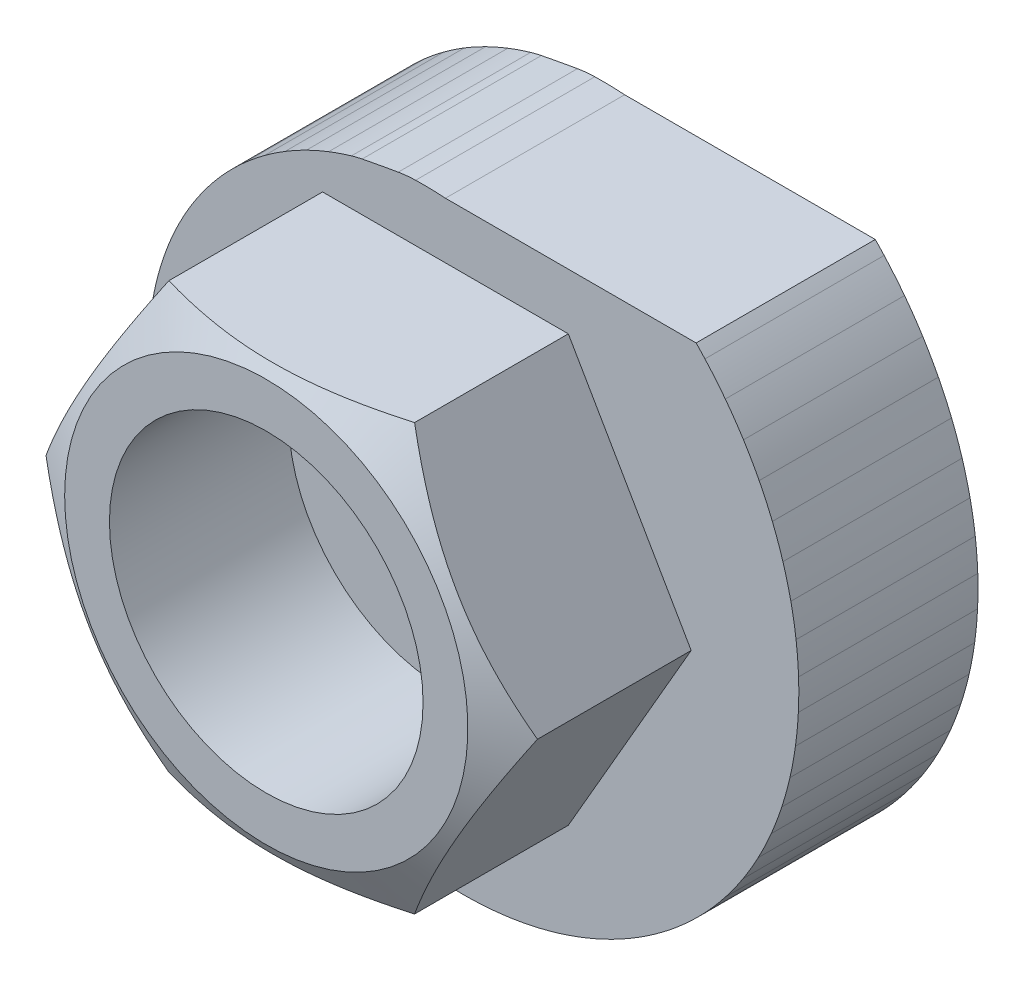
ISO-10303-21;
HEADER;
FILE_DESCRIPTION(('STEP AP214'),'2;1');
FILE_NAME('part.step','',(''),(''),'','','');
FILE_SCHEMA(('AUTOMOTIVE_DESIGN { 1 0 10303 214 1 1 1 1 }'));
ENDSEC;
DATA;
#1=APPLICATION_CONTEXT('core data for automotive mechanical design processes');
#2=APPLICATION_PROTOCOL_DEFINITION('international standard','automotive_design',2000,#1);
#3=PRODUCT_CONTEXT('',#1,'mechanical');
#4=PRODUCT('Part','Part','',(#3));
#5=PRODUCT_RELATED_PRODUCT_CATEGORY('part','',(#4));
#6=PRODUCT_DEFINITION_FORMATION('','',#4);
#7=PRODUCT_DEFINITION_CONTEXT('part definition',#1,'design');
#8=PRODUCT_DEFINITION('design','',#6,#7);
#9=PRODUCT_DEFINITION_SHAPE('','',#8);
#10=(LENGTH_UNIT() NAMED_UNIT(*) SI_UNIT(.MILLI.,.METRE.));
#11=(NAMED_UNIT(*) PLANE_ANGLE_UNIT() SI_UNIT($,.RADIAN.));
#12=(NAMED_UNIT(*) SI_UNIT($,.STERADIAN.) SOLID_ANGLE_UNIT());
#13=UNCERTAINTY_MEASURE_WITH_UNIT(LENGTH_MEASURE(1.E-05),#10,'distance_accuracy_value','');
#14=(GEOMETRIC_REPRESENTATION_CONTEXT(3) GLOBAL_UNCERTAINTY_ASSIGNED_CONTEXT((#13)) GLOBAL_UNIT_ASSIGNED_CONTEXT((#10,
#11,#12)) REPRESENTATION_CONTEXT('',''));
#15=CARTESIAN_POINT('',(0.,0.,0.));
#16=DIRECTION('',(0.,0.,1.));
#17=DIRECTION('',(1.,0.,0.));
#18=AXIS2_PLACEMENT_3D('',#15,#16,#17);
#19=CARTESIAN_POINT('',(-1.00296340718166,-3.26361718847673,0.));
#20=DIRECTION('',(0.,0.,1.));
#21=DIRECTION('',(0.,-1.,0.));
#22=AXIS2_PLACEMENT_3D('',#19,#20,#21);
#23=PLANE('',#22);
#24=CARTESIAN_POINT('',(-1.00296340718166,-3.26361718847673,0.));
#25=DIRECTION('',(0.,0.,1.));
#26=DIRECTION('',(0.,-1.,0.));
#27=AXIS2_PLACEMENT_3D('',#24,#25,#26);
#28=CIRCLE('',#27,15.2965316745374);
#29=CARTESIAN_POINT('',(3.05078184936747E-09,11.9999979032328,0.));
#30=VERTEX_POINT('',#29);
#31=CARTESIAN_POINT('',(-1.3321820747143,12.0293712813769,0.));
#32=VERTEX_POINT('',#31);
#33=EDGE_CURVE('E491',#30,#32,#28,.T.);
#34=ORIENTED_EDGE('',*,*,#33,.F.);
#35=DIRECTION('',(-1.,0.,0.));
#36=VECTOR('',#35,1.);
#37=CARTESIAN_POINT('',(11.189501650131,11.9999979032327,0.));
#38=LINE('',#37,#36);
#39=CARTESIAN_POINT('',(11.189501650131,11.9999979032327,0.));
#40=VERTEX_POINT('',#39);
#41=EDGE_CURVE('E620',#40,#30,#38,.T.);
#42=ORIENTED_EDGE('',*,*,#41,.F.);
#43=CARTESIAN_POINT('',(-0.633946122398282,0.492401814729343,0.));
#44=DIRECTION('',(0.,0.,1.));
#45=DIRECTION('',(0.,-1.,0.));
#46=AXIS2_PLACEMENT_3D('',#43,#44,#45);
#47=CIRCLE('',#46,16.4990510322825);
#48=CARTESIAN_POINT('',(11.5842444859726,11.5799851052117,0.));
#49=VERTEX_POINT('',#48);
#50=EDGE_CURVE('E618',#49,#40,#47,.T.);
#51=ORIENTED_EDGE('',*,*,#50,.F.);
#52=CARTESIAN_POINT('',(-0.429297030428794,0.678113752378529,0.));
#53=DIRECTION('',(0.,0.,1.));
#54=DIRECTION('',(0.,-1.,0.));
#55=AXIS2_PLACEMENT_3D('',#52,#53,#54);
#56=CIRCLE('',#55,16.2226994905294);
#57=CARTESIAN_POINT('',(12.4943460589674,10.4840011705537,0.));
#58=VERTEX_POINT('',#57);
#59=EDGE_CURVE('E616',#58,#49,#56,.T.);
#60=ORIENTED_EDGE('',*,*,#59,.F.);
#61=CARTESIAN_POINT('',(-0.538543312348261,0.595222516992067,0.));
#62=DIRECTION('',(0.,0.,1.));
#63=DIRECTION('',(0.,-1.,0.));
#64=AXIS2_PLACEMENT_3D('',#61,#62,#63);
#65=CIRCLE('',#64,16.3598333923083);
#66=CARTESIAN_POINT('',(13.3052016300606,9.31272643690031,0.));
#67=VERTEX_POINT('',#66);
#68=EDGE_CURVE('E614',#67,#58,#65,.T.);
#69=ORIENTED_EDGE('',*,*,#68,.F.);
#70=CARTESIAN_POINT('',(-0.304726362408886,0.742458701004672,0.));
#71=DIRECTION('',(0.,0.,1.));
#72=DIRECTION('',(0.,-1.,0.));
#73=AXIS2_PLACEMENT_3D('',#70,#71,#72);
#74=CIRCLE('',#73,16.0835204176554);
#75=CARTESIAN_POINT('',(14.0046452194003,8.08558568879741,0.));
#76=VERTEX_POINT('',#75);
#77=EDGE_CURVE('E612',#76,#67,#74,.T.);
#78=ORIENTED_EDGE('',*,*,#77,.F.);
#79=CARTESIAN_POINT('',(-0.426696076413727,0.679867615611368,0.));
#80=DIRECTION('',(0.,0.,1.));
#81=DIRECTION('',(0.,-1.,0.));
#82=AXIS2_PLACEMENT_3D('',#79,#80,#81);
#83=CIRCLE('',#82,16.2206125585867);
#84=CARTESIAN_POINT('',(14.5941901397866,6.80206077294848,0.));
#85=VERTEX_POINT('',#84);
#86=EDGE_CURVE('E610',#85,#76,#83,.T.);
#87=ORIENTED_EDGE('',*,*,#86,.F.);
#88=CARTESIAN_POINT('',(-0.170856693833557,0.784142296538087,0.));
#89=DIRECTION('',(0.,0.,1.));
#90=DIRECTION('',(0.,-1.,0.));
#91=AXIS2_PLACEMENT_3D('',#88,#89,#90);
#92=CIRCLE('',#91,15.9443391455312);
#93=CARTESIAN_POINT('',(15.0652764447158,5.48331219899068,0.));
#94=VERTEX_POINT('',#93);
#95=EDGE_CURVE('E608',#94,#85,#92,.T.);
#96=ORIENTED_EDGE('',*,*,#95,.F.);
#97=CARTESIAN_POINT('',(-0.301818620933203,0.743750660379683,0.));
#98=DIRECTION('',(0.,0.,1.));
#99=DIRECTION('',(0.,-1.,0.));
#100=AXIS2_PLACEMENT_3D('',#97,#98,#99);
#101=CIRCLE('',#100,16.0813884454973);
#102=CARTESIAN_POINT('',(15.4193342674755,4.12848199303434,0.));
#103=VERTEX_POINT('',#102);
#104=EDGE_CURVE('E606',#103,#94,#101,.T.);
#105=ORIENTED_EDGE('',*,*,#104,.F.);
#106=CARTESIAN_POINT('',(-0.031773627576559,0.801890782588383,0.));
#107=DIRECTION('',(0.,0.,1.));
#108=DIRECTION('',(0.,-1.,0.));
#109=AXIS2_PLACEMENT_3D('',#106,#107,#108);
#110=CIRCLE('',#109,15.8051556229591);
#111=CARTESIAN_POINT('',(15.6516414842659,2.75980668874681,0.));
#112=VERTEX_POINT('',#111);
#113=EDGE_CURVE('E604',#112,#103,#110,.T.);
#114=ORIENTED_EDGE('',*,*,#113,.F.);
#115=CARTESIAN_POINT('',(-0.167723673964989,0.784918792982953,0.));
#116=DIRECTION('',(0.,0.,1.));
#117=DIRECTION('',(0.,-1.,0.));
#118=AXIS2_PLACEMENT_3D('',#115,#116,#117);
#119=CIRCLE('',#118,15.9421609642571);
#120=CARTESIAN_POINT('',(15.7634720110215,1.37610426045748,0.));
#121=VERTEX_POINT('',#120);
#122=EDGE_CURVE('E602',#121,#112,#119,.T.);
#123=ORIENTED_EDGE('',*,*,#122,.F.);
#124=CARTESIAN_POINT('',(0.1082775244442,0.795160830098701,0.));
#125=DIRECTION('',(0.,0.,1.));
#126=DIRECTION('',(0.,-1.,0.));
#127=AXIS2_PLACEMENT_3D('',#124,#125,#126);
#128=CIRCLE('',#127,15.6659697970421);
#129=CARTESIAN_POINT('',(15.7540542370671,3.23277342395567E-09,0.));
#130=VERTEX_POINT('',#129);
#131=EDGE_CURVE('E600',#130,#121,#128,.T.);
#132=ORIENTED_EDGE('',*,*,#131,.F.);
#133=CARTESIAN_POINT('',(-0.0285061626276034,0.802112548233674,0.));
#134=DIRECTION('',(0.,0.,1.));
#135=DIRECTION('',(0.,-1.,0.));
#136=AXIS2_PLACEMENT_3D('',#133,#134,#135);
#137=CIRCLE('',#136,15.8029300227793);
#138=CARTESIAN_POINT('',(15.6244362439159,-1.36998121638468,0.));
#139=VERTEX_POINT('',#138);
#140=EDGE_CURVE('E598',#139,#130,#137,.T.);
#141=ORIENTED_EDGE('',*,*,#140,.F.);
#142=CARTESIAN_POINT('',(0.245021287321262,0.764156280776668,0.));
#143=DIRECTION('',(0.,0.,1.));
#144=DIRECTION('',(0.,-1.,0.));
#145=AXIS2_PLACEMENT_3D('',#142,#143,#144);
#146=CIRCLE('',#145,15.5267816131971);
#147=CARTESIAN_POINT('',(15.3777880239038,-2.71151892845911,0.));
#148=VERTEX_POINT('',#147);
#149=EDGE_CURVE('E596',#148,#139,#146,.T.);
#150=ORIENTED_EDGE('',*,*,#149,.F.);
#151=CARTESIAN_POINT('',(0.111581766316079,0.794804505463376,0.));
#152=DIRECTION('',(0.,0.,1.));
#153=DIRECTION('',(0.,-1.,0.));
#154=AXIS2_PLACEMENT_3D('',#151,#152,#153);
#155=CIRCLE('',#154,15.6636955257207);
#156=CARTESIAN_POINT('',(15.0148686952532,-4.02633604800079,0.));
#157=VERTEX_POINT('',#156);
#158=EDGE_CURVE('E594',#157,#148,#155,.T.);
#159=ORIENTED_EDGE('',*,*,#158,.F.);
#160=CARTESIAN_POINT('',(0.374282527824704,0.709822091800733,0.));
#161=DIRECTION('',(0.,0.,1.));
#162=DIRECTION('',(0.,-1.,0.));
#163=AXIS2_PLACEMENT_3D('',#160,#161,#162);
#164=CIRCLE('',#163,15.3875910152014);
#165=CARTESIAN_POINT('',(14.542660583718,-5.29309557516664,0.));
#166=VERTEX_POINT('',#165);
#167=EDGE_CURVE('E592',#166,#157,#164,.T.);
#168=ORIENTED_EDGE('',*,*,#167,.F.);
#169=CARTESIAN_POINT('',(0.248260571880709,0.763215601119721,0.));
#170=DIRECTION('',(0.,0.,1.));
#171=DIRECTION('',(0.,-1.,0.));
#172=AXIS2_PLACEMENT_3D('',#169,#170,#171);
#173=CIRCLE('',#172,15.5244573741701);
#174=CARTESIAN_POINT('',(13.9615800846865,-6.5137098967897,0.));
#175=VERTEX_POINT('',#174);
#176=EDGE_CURVE('E590',#175,#166,#173,.T.);
#177=ORIENTED_EDGE('',*,*,#176,.F.);
#178=CARTESIAN_POINT('',(0.492113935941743,0.633815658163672,0.));
#179=DIRECTION('',(0.,0.,1.));
#180=DIRECTION('',(0.,-1.,0.));
#181=AXIS2_PLACEMENT_3D('',#178,#179,#180);
#182=CIRCLE('',#181,15.2483979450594);
#183=CARTESIAN_POINT('',(13.282177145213,-7.66846854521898,0.));
#184=VERTEX_POINT('',#183);
#185=EDGE_CURVE('E588',#184,#175,#182,.T.);
#186=ORIENTED_EDGE('',*,*,#185,.F.);
#187=CARTESIAN_POINT('',(0.377354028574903,0.708308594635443,0.));
#188=DIRECTION('',(0.,0.,1.));
#189=DIRECTION('',(0.,-1.,0.));
#190=AXIS2_PLACEMENT_3D('',#187,#188,#189);
#191=CIRCLE('',#190,15.385215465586);
#192=CARTESIAN_POINT('',(12.5044836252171,-8.7594040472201,0.));
#193=VERTEX_POINT('',#192);
#194=EDGE_CURVE('E586',#193,#184,#191,.T.);
#195=ORIENTED_EDGE('',*,*,#194,.F.);
#196=CARTESIAN_POINT('',(0.594916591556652,0.538456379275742,0.));
#197=DIRECTION('',(0.,0.,1.));
#198=DIRECTION('',(0.,-1.,0.));
#199=AXIS2_PLACEMENT_3D('',#196,#197,#198);
#200=CIRCLE('',#199,15.1092023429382);
#201=CARTESIAN_POINT('',(11.6422653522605,-9.76902055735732,0.));
#202=VERTEX_POINT('',#201);
#203=EDGE_CURVE('E584',#202,#193,#200,.T.);
#204=ORIENTED_EDGE('',*,*,#203,.F.);
#205=CARTESIAN_POINT('',(0.494916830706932,0.631758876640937,0.));
#206=DIRECTION('',(0.,0.,1.));
#207=DIRECTION('',(0.,-1.,0.));
#208=AXIS2_PLACEMENT_3D('',#205,#206,#207);
#209=CIRCLE('',#208,15.2459696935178);
#210=CARTESIAN_POINT('',(10.6951419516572,-10.69939284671,0.));
#211=VERTEX_POINT('',#210);
#212=EDGE_CURVE('E582',#211,#202,#209,.T.);
#213=ORIENTED_EDGE('',*,*,#212,.F.);
#214=CARTESIAN_POINT('',(0.679549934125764,0.426655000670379,0.));
#215=DIRECTION('',(0.,0.,1.));
#216=DIRECTION('',(0.,-1.,0.));
#217=AXIS2_PLACEMENT_3D('',#214,#215,#216);
#218=CIRCLE('',#217,14.9700041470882);
#219=CARTESIAN_POINT('',(9.67964798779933,-11.5357552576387,0.));
#220=VERTEX_POINT('',#219);
#221=EDGE_CURVE('E580',#220,#211,#218,.T.);
#222=ORIENTED_EDGE('',*,*,#221,.F.);
#223=CARTESIAN_POINT('',(0.597355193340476,0.535903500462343,0.));
#224=DIRECTION('',(0.,0.,1.));
#225=DIRECTION('',(0.,-1.,0.));
#226=AXIS2_PLACEMENT_3D('',#223,#224,#225);
#227=CIRCLE('',#226,15.1067199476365);
#228=CARTESIAN_POINT('',(8.59497892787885,-12.2801412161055,0.));
#229=VERTEX_POINT('',#228);
#230=EDGE_CURVE('E578',#229,#220,#227,.T.);
#231=ORIENTED_EDGE('',*,*,#230,.F.);
#232=CARTESIAN_POINT('',(0.743427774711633,0.301824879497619,0.));
#233=DIRECTION('',(0.,0.,1.));
#234=DIRECTION('',(0.,-1.,0.));
#235=AXIS2_PLACEMENT_3D('',#232,#233,#234);
#236=CIRCLE('',#235,14.8308032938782);
#237=CARTESIAN_POINT('',(7.45990998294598,-12.9209431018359,0.));
#238=VERTEX_POINT('',#237);
#239=EDGE_CURVE('E576',#238,#229,#236,.T.);
#240=ORIENTED_EDGE('',*,*,#239,.F.);
#241=CARTESIAN_POINT('',(0.681536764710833,0.423669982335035,0.));
#242=DIRECTION('',(0.,0.,1.));
#243=DIRECTION('',(0.,-1.,0.));
#244=AXIS2_PLACEMENT_3D('',#241,#242,#243);
#245=CIRCLE('',#244,14.9674661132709);
#246=CARTESIAN_POINT('',(6.27321739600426,-13.460066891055,0.));
#247=VERTEX_POINT('',#246);
#248=EDGE_CURVE('E574',#247,#238,#245,.T.);
#249=ORIENTED_EDGE('',*,*,#248,.F.);
#250=CARTESIAN_POINT('',(0.784597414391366,0.167777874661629,0.));
#251=DIRECTION('',(0.,0.,1.));
#252=DIRECTION('',(0.,-1.,0.));
#253=AXIS2_PLACEMENT_3D('',#250,#251,#252);
#254=CIRCLE('',#253,14.6915997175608);
#255=CARTESIAN_POINT('',(5.05532480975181,-13.8893907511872,0.));
#256=VERTEX_POINT('',#255);
#257=EDGE_CURVE('E572',#256,#247,#254,.T.);
#258=ORIENTED_EDGE('',*,*,#257,.F.);
#259=CARTESIAN_POINT('',(0.744886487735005,0.298487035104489,0.));
#260=DIRECTION('',(0.,0.,1.));
#261=DIRECTION('',(0.,-1.,0.));
#262=AXIS2_PLACEMENT_3D('',#259,#260,#261);
#263=CIRCLE('',#262,14.8282080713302);
#264=CARTESIAN_POINT('',(3.80461148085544,-14.210607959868,0.));
#265=VERTEX_POINT('',#264);
#266=EDGE_CURVE('E570',#265,#256,#263,.T.);
#267=ORIENTED_EDGE('',*,*,#266,.F.);
#268=CARTESIAN_POINT('',(0.801799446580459,0.0286080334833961,0.));
#269=DIRECTION('',(0.,0.,1.));
#270=DIRECTION('',(0.,-1.,0.));
#271=AXIS2_PLACEMENT_3D('',#268,#269,#270);
#272=CIRCLE('',#271,14.5523933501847);
#273=CARTESIAN_POINT('',(2.54251179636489,-14.4193009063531,0.));
#274=VERTEX_POINT('',#273);
#275=EDGE_CURVE('E568',#274,#265,#272,.T.);
#276=ORIENTED_EDGE('',*,*,#275,.F.);
#277=CARTESIAN_POINT('',(0.78546547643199,0.164179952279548,0.));
#278=DIRECTION('',(0.,0.,1.));
#279=DIRECTION('',(0.,-1.,0.));
#280=AXIS2_PLACEMENT_3D('',#277,#278,#279);
#281=CIRCLE('',#280,14.6889456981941);
#282=CARTESIAN_POINT('',(1.26704734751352,-14.5168692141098,0.));
#283=VERTEX_POINT('',#282);
#284=EDGE_CURVE('E566',#283,#274,#281,.T.);
#285=ORIENTED_EDGE('',*,*,#284,.F.);
#286=CARTESIAN_POINT('',(0.794506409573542,-0.111433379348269,0.));
#287=DIRECTION('',(0.,0.,1.));
#288=DIRECTION('',(0.,-1.,0.));
#289=AXIS2_PLACEMENT_3D('',#286,#287,#288);
#290=CIRCLE('',#289,14.4131841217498);
#291=CARTESIAN_POINT('',(3.05067592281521E-09,-14.5027028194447,0.));
#292=VERTEX_POINT('',#291);
#293=EDGE_CURVE('E564',#292,#283,#290,.T.);
#294=ORIENTED_EDGE('',*,*,#293,.F.);
#295=CARTESIAN_POINT('',(0.80203048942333,0.0248538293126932,0.));
#296=DIRECTION('',(0.,0.,1.));
#297=DIRECTION('',(0.,-1.,0.));
#298=AXIS2_PLACEMENT_3D('',#295,#296,#297);
#299=CIRCLE('',#298,14.5496788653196);
#300=CARTESIAN_POINT('',(-1.26091080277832,-14.3778344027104,0.));
#301=VERTEX_POINT('',#300);
#302=EDGE_CURVE('E562',#301,#292,#299,.T.);
#303=ORIENTED_EDGE('',*,*,#302,.F.);
#304=CARTESIAN_POINT('',(0.762939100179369,-0.248067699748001,0.));
#305=DIRECTION('',(0.,0.,1.));
#306=DIRECTION('',(0.,-1.,0.));
#307=AXIS2_PLACEMENT_3D('',#304,#305,#306);
#308=CIRCLE('',#307,14.2739719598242);
#309=CARTESIAN_POINT('',(-2.49422403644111,-14.1454474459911,0.));
#310=VERTEX_POINT('',#309);
#311=EDGE_CURVE('E560',#310,#301,#308,.T.);
#312=ORIENTED_EDGE('',*,*,#311,.F.);
#313=CARTESIAN_POINT('',(0.794072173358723,-0.115231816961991,0.));
#314=DIRECTION('',(0.,0.,1.));
#315=DIRECTION('',(0.,-1.,0.));
#316=AXIS2_PLACEMENT_3D('',#313,#314,#315);
#317=CIRCLE('',#316,14.410407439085);
#318=CARTESIAN_POINT('',(-3.7024522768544,-13.8061452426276,0.));
#319=VERTEX_POINT('',#318);
#320=EDGE_CURVE('E558',#319,#310,#317,.T.);
#321=ORIENTED_EDGE('',*,*,#320,.F.);
#322=CARTESIAN_POINT('',(0.708060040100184,-0.377119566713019,0.));
#323=DIRECTION('',(0.,0.,1.));
#324=DIRECTION('',(0.,-1.,0.));
#325=AXIS2_PLACEMENT_3D('',#322,#323,#324);
#326=CIRCLE('',#325,14.1347567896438);
#327=CARTESIAN_POINT('',(-4.86510818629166,-13.3667748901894,0.));
#328=VERTEX_POINT('',#327);
#329=EDGE_CURVE('E556',#328,#319,#326,.T.);
#330=ORIENTED_EDGE('',*,*,#329,.F.);
#331=CARTESIAN_POINT('',(0.761830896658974,-0.251793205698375,0.));
#332=DIRECTION('',(0.,0.,1.));
#333=DIRECTION('',(0.,-1.,0.));
#334=AXIS2_PLACEMENT_3D('',#331,#332,#333);
#335=CIRCLE('',#334,14.2711312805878);
#336=CARTESIAN_POINT('',(-5.98485374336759,-12.8274615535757,0.));
#337=VERTEX_POINT('',#336);
#338=EDGE_CURVE('E554',#337,#328,#335,.T.);
#339=ORIENTED_EDGE('',*,*,#338,.F.);
#340=CARTESIAN_POINT('',(0.631544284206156,-0.494644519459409,0.));
#341=DIRECTION('',(0.,0.,1.));
#342=DIRECTION('',(0.,-1.,0.));
#343=AXIS2_PLACEMENT_3D('',#340,#341,#342);
#344=CIRCLE('',#343,13.9955385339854);
#345=CARTESIAN_POINT('',(-7.04279283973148,-12.1984750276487,0.));
#346=VERTEX_POINT('',#345);
#347=EDGE_CURVE('E552',#346,#337,#344,.T.);
#348=ORIENTED_EDGE('',*,*,#347,.F.);
#349=CARTESIAN_POINT('',(0.706289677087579,-0.380653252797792,0.));
#350=DIRECTION('',(0.,0.,1.));
#351=DIRECTION('',(0.,-1.,0.));
#352=AXIS2_PLACEMENT_3D('',#349,#350,#351);
#353=CIRCLE('',#352,14.1318502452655);
#354=CARTESIAN_POINT('',(-8.04164448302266,-11.4794297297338,0.));
#355=VERTEX_POINT('',#354);
#356=EDGE_CURVE('E550',#355,#346,#353,.T.);
#357=ORIENTED_EDGE('',*,*,#356,.F.);
#358=CARTESIAN_POINT('',(0.53572845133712,-0.597049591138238,0.));
#359=DIRECTION('',(0.,0.,1.));
#360=DIRECTION('',(0.,-1.,0.));
#361=AXIS2_PLACEMENT_3D('',#358,#359,#360);
#362=CIRCLE('',#361,13.8563171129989);
#363=CARTESIAN_POINT('',(-8.96466737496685,-10.6836745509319,0.));
#364=VERTEX_POINT('',#363);
#365=EDGE_CURVE('E548',#364,#355,#362,.T.);
#366=ORIENTED_EDGE('',*,*,#365,.F.);
#367=CARTESIAN_POINT('',(0.629144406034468,-0.497869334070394,0.));
#368=DIRECTION('',(0.,0.,1.));
#369=DIRECTION('',(0.,-1.,0.));
#370=AXIS2_PLACEMENT_3D('',#367,#368,#369);
#371=CIRCLE('',#370,13.9925641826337);
#372=CARTESIAN_POINT('',(-9.81453859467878,-9.81029854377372,0.));
#373=VERTEX_POINT('',#372);
#374=EDGE_CURVE('E546',#373,#364,#371,.T.);
#375=ORIENTED_EDGE('',*,*,#374,.F.);
#376=CARTESIAN_POINT('',(0.42353952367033,-0.681203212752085,0.));
#377=DIRECTION('',(0.,0.,1.));
#378=DIRECTION('',(0.,-1.,0.));
#379=AXIS2_PLACEMENT_3D('',#376,#377,#378);
#380=CIRCLE('',#379,13.7170924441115);
#381=CARTESIAN_POINT('',(-10.5771644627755,-8.87529479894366,0.));
#382=VERTEX_POINT('',#381);
#383=EDGE_CURVE('E544',#382,#373,#380,.T.);
#384=ORIENTED_EDGE('',*,*,#383,.F.);
#385=CARTESIAN_POINT('',(0.532752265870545,-0.599853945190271,0.));
#386=DIRECTION('',(0.,0.,1.));
#387=DIRECTION('',(0.,-1.,0.));
#388=AXIS2_PLACEMENT_3D('',#385,#386,#387);
#389=CIRCLE('',#388,13.8532729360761);
#390=CARTESIAN_POINT('',(-11.2550781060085,-7.8772316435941,0.));
#391=VERTEX_POINT('',#390);
#392=EDGE_CURVE('E542',#391,#382,#389,.T.);
#393=ORIENTED_EDGE('',*,*,#392,.F.);
#394=CARTESIAN_POINT('',(0.298405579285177,-0.744531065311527,0.));
#395=DIRECTION('',(0.,0.,1.));
#396=DIRECTION('',(0.,-1.,0.));
#397=AXIS2_PLACEMENT_3D('',#394,#395,#396);
#398=CIRCLE('',#397,13.5778644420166);
#399=CARTESIAN_POINT('',(-11.8372409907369,-6.83423427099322,0.));
#400=VERTEX_POINT('',#399);
#401=EDGE_CURVE('E540',#400,#391,#398,.T.);
#402=ORIENTED_EDGE('',*,*,#401,.F.);
#403=CARTESIAN_POINT('',(0.420059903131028,-0.683484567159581,0.));
#404=DIRECTION('',(0.,0.,1.));
#405=DIRECTION('',(0.,-1.,0.));
#406=AXIS2_PLACEMENT_3D('',#403,#404,#405);
#407=CIRCLE('',#406,13.7139763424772);
#408=CARTESIAN_POINT('',(-12.3259409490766,-5.74437474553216,0.));
#409=VERTEX_POINT('',#408);
#410=EDGE_CURVE('E538',#409,#400,#407,.T.);
#411=ORIENTED_EDGE('',*,*,#410,.F.);
#412=CARTESIAN_POINT('',(0.164151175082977,-0.785094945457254,0.));
#413=DIRECTION('',(0.,0.,1.));
#414=DIRECTION('',(0.,-1.,0.));
#415=AXIS2_PLACEMENT_3D('',#412,#413,#414);
#416=CIRCLE('',#415,13.4386330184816);
#417=CARTESIAN_POINT('',(-12.7135050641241,-4.62733741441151,0.));
#418=VERTEX_POINT('',#417);
#419=EDGE_CURVE('E536',#418,#409,#416,.T.);
#420=ORIENTED_EDGE('',*,*,#419,.F.);
#421=CARTESIAN_POINT('',(0.294513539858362,-0.746199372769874,0.));
#422=DIRECTION('',(0.,0.,1.));
#423=DIRECTION('',(0.,-1.,0.));
#424=AXIS2_PLACEMENT_3D('',#421,#422,#423);
#425=CIRCLE('',#424,13.5746742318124);
#426=CARTESIAN_POINT('',(-13.0018790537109,-3.4807422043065,0.));
#427=VERTEX_POINT('',#426);
#428=EDGE_CURVE('E534',#427,#418,#425,.T.);
#429=ORIENTED_EDGE('',*,*,#428,.F.);
#430=CARTESIAN_POINT('',(0.02488056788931,-0.801652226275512,0.));
#431=DIRECTION('',(0.,0.,1.));
#432=DIRECTION('',(0.,-1.,0.));
#433=AXIS2_PLACEMENT_3D('',#430,#431,#432);
#434=CIRCLE('',#433,13.2993980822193);
#435=CARTESIAN_POINT('',(-13.1869603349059,-2.32521689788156,0.));
#436=VERTEX_POINT('',#435);
#437=EDGE_CURVE('E532',#436,#427,#434,.T.);
#438=ORIENTED_EDGE('',*,*,#437,.F.);
#439=CARTESIAN_POINT('',(0.159953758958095,-0.786075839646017,0.));
#440=DIRECTION('',(0.,0.,1.));
#441=DIRECTION('',(0.,-1.,0.));
#442=AXIS2_PLACEMENT_3D('',#439,#440,#441);
#443=CIRCLE('',#442,13.4353664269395);
#444=CARTESIAN_POINT('',(-13.2702640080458,-1.1579921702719,0.));
#445=VERTEX_POINT('',#444);
#446=EDGE_CURVE('E530',#445,#436,#443,.T.);
#447=ORIENTED_EDGE('',*,*,#446,.F.);
#448=CARTESIAN_POINT('',(-0.115147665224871,-0.793694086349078,0.));
#449=DIRECTION('',(0.,0.,1.));
#450=DIRECTION('',(0.,-1.,0.));
#451=AXIS2_PLACEMENT_3D('',#448,#449,#450);
#452=CIRCLE('',#451,13.1601595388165);
#453=CARTESIAN_POINT('',(-13.251351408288,3.23278263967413E-09,0.));
#454=VERTEX_POINT('',#453);
#455=EDGE_CURVE('E528',#454,#445,#452,.T.);
#456=ORIENTED_EDGE('',*,*,#455,.F.);
#457=CARTESIAN_POINT('',(0.0204981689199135,-0.801889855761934,0.));
#458=DIRECTION('',(0.,0.,1.));
#459=DIRECTION('',(0.,-1.,0.));
#460=AXIS2_PLACEMENT_3D('',#457,#458,#459);
#461=CIRCLE('',#460,13.2960527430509);
#462=CARTESIAN_POINT('',(-13.1312304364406,1.15183817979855,0.));
#463=VERTEX_POINT('',#462);
#464=EDGE_CURVE('E526',#463,#454,#461,.T.);
#465=ORIENTED_EDGE('',*,*,#464,.F.);
#466=CARTESIAN_POINT('',(-0.251650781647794,-0.761461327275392,0.));
#467=DIRECTION('',(0.,0.,1.));
#468=DIRECTION('',(0.,-1.,0.));
#469=AXIS2_PLACEMENT_3D('',#466,#467,#468);
#470=CIRCLE('',#469,13.0209172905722);
#471=CARTESIAN_POINT('',(-12.9131068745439,2.27692915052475,0.));
#472=VERTEX_POINT('',#471);
#473=EDGE_CURVE('E524',#472,#463,#470,.T.);
#474=ORIENTED_EDGE('',*,*,#473,.F.);
#475=CARTESIAN_POINT('',(-0.119584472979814,-0.793153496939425,0.));
#476=DIRECTION('',(0.,0.,1.));
#477=DIRECTION('',(0.,-1.,0.));
#478=AXIS2_PLACEMENT_3D('',#475,#476,#477);
#479=CIRCLE('',#478,13.156732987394);
#480=CARTESIAN_POINT('',(-12.5974200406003,3.37856586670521,0.));
#481=VERTEX_POINT('',#480);
#482=EDGE_CURVE('E522',#481,#472,#479,.T.);
#483=ORIENTED_EDGE('',*,*,#482,.F.);
#484=CARTESIAN_POINT('',(-0.38045282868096,-0.705937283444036,0.));
#485=DIRECTION('',(0.,0.,1.));
#486=DIRECTION('',(0.,-1.,0.));
#487=AXIS2_PLACEMENT_3D('',#484,#485,#486);
#488=CIRCLE('',#487,12.8816712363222);
#489=CARTESIAN_POINT('',(-12.1908892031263,4.43712080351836,0.));
#490=VERTEX_POINT('',#489);
#491=EDGE_CURVE('E520',#490,#481,#488,.T.);
#492=ORIENTED_EDGE('',*,*,#491,.F.);
#493=CARTESIAN_POINT('',(-0.256004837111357,-0.760130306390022,0.));
#494=DIRECTION('',(0.,0.,1.));
#495=DIRECTION('',(0.,-1.,0.));
#496=AXIS2_PLACEMENT_3D('',#493,#494,#495);
#497=CIRCLE('',#496,13.0174069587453);
#498=CARTESIAN_POINT('',(-11.6933417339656,5.45599458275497,0.));
#499=VERTEX_POINT('',#498);
#500=EDGE_CURVE('E518',#499,#490,#497,.T.);
#501=ORIENTED_EDGE('',*,*,#500,.F.);
#502=CARTESIAN_POINT('',(-0.497612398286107,-0.628818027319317,0.));
#503=DIRECTION('',(0.,0.,1.));
#504=DIRECTION('',(0.,-1.,0.));
#505=AXIS2_PLACEMENT_3D('',#502,#503,#504);
#506=CIRCLE('',#505,12.7424212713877);
#507=CARTESIAN_POINT('',(-11.1147729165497,6.41711714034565,0.));
#508=VERTEX_POINT('',#507);
#509=EDGE_CURVE('E516',#508,#499,#506,.T.);
#510=ORIENTED_EDGE('',*,*,#509,.F.);
#511=CARTESIAN_POINT('',(-0.384584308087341,-0.70382759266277,0.));
#512=DIRECTION('',(0.,0.,1.));
#513=DIRECTION('',(0.,-1.,0.));
#514=AXIS2_PLACEMENT_3D('',#511,#512,#513);
#515=CIRCLE('',#514,12.878074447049);
#516=CARTESIAN_POINT('',(-10.454375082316,7.32388162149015,0.));
#517=VERTEX_POINT('',#516);
#518=EDGE_CURVE('E514',#517,#508,#515,.T.);
#519=ORIENTED_EDGE('',*,*,#518,.F.);
#520=CARTESIAN_POINT('',(-0.59954327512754,-0.532460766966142,0.));
#521=DIRECTION('',(0.,0.,1.));
#522=DIRECTION('',(0.,-1.,0.));
#523=AXIS2_PLACEMENT_3D('',#520,#521,#522);
#524=CIRCLE('',#523,12.6031672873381);
#525=CARTESIAN_POINT('',(-9.72508375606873,8.16031419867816,0.));
#526=VERTEX_POINT('',#525);
#527=EDGE_CURVE('E512',#526,#517,#524,.T.);
#528=ORIENTED_EDGE('',*,*,#527,.F.);
#529=CARTESIAN_POINT('',(-0.501382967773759,-0.625965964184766,0.));
#530=DIRECTION('',(0.,0.,1.));
#531=DIRECTION('',(0.,-1.,0.));
#532=AXIS2_PLACEMENT_3D('',#529,#530,#531);
#533=CIRCLE('',#532,12.7387352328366);
#534=CARTESIAN_POINT('',(-8.92545498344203,8.92968084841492,0.));
#535=VERTEX_POINT('',#534);
#536=EDGE_CURVE('E510',#535,#526,#533,.T.);
#537=ORIENTED_EDGE('',*,*,#536,.F.);
#538=CARTESIAN_POINT('',(-0.683124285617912,-0.419811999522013,0.));
#539=DIRECTION('',(0.,0.,1.));
#540=DIRECTION('',(0.,-1.,0.));
#541=AXIS2_PLACEMENT_3D('',#538,#539,#540);
#542=CIRCLE('',#541,12.4639091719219);
#543=CARTESIAN_POINT('',(-8.07094161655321,9.61857367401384,0.));
#544=VERTEX_POINT('',#543);
#545=EDGE_CURVE('E508',#544,#535,#542,.T.);
#546=ORIENTED_EDGE('',*,*,#545,.F.);
#547=CARTESIAN_POINT('',(-0.602820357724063,-0.528927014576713,0.));
#548=DIRECTION('',(0.,0.,1.));
#549=DIRECTION('',(0.,-1.,0.));
#550=AXIS2_PLACEMENT_3D('',#547,#548,#549);
#551=CIRCLE('',#550,12.5993890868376);
#552=CARTESIAN_POINT('',(-7.15948485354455,10.2300114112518,0.));
#553=VERTEX_POINT('',#552);
#554=EDGE_CURVE('E506',#553,#544,#551,.T.);
#555=ORIENTED_EDGE('',*,*,#554,.F.);
#556=CARTESIAN_POINT('',(-0.745794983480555,-0.294317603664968,0.));
#557=DIRECTION('',(0.,0.,1.));
#558=DIRECTION('',(0.,-1.,0.));
#559=AXIS2_PLACEMENT_3D('',#556,#557,#558);
#560=CIRCLE('',#559,12.3246468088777);
#561=CARTESIAN_POINT('',(-6.20855856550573,10.7535388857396,0.));
#562=VERTEX_POINT('',#561);
#563=EDGE_CURVE('E504',#562,#553,#560,.T.);
#564=ORIENTED_EDGE('',*,*,#563,.F.);
#565=CARTESIAN_POINT('',(-0.68579302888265,-0.415665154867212,0.));
#566=DIRECTION('',(0.,0.,1.));
#567=DIRECTION('',(0.,-1.,0.));
#568=AXIS2_PLACEMENT_3D('',#565,#566,#567);
#569=CIRCLE('',#568,12.4600183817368);
#570=CARTESIAN_POINT('',(-5.21553465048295,11.1918108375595,0.));
#571=VERTEX_POINT('',#570);
#572=EDGE_CURVE('E502',#571,#562,#569,.T.);
#573=ORIENTED_EDGE('',*,*,#572,.F.);
#574=CARTESIAN_POINT('',(-0.785616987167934,-0.159865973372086,0.));
#575=DIRECTION('',(0.,0.,1.));
#576=DIRECTION('',(0.,-1.,0.));
#577=AXIS2_PLACEMENT_3D('',#574,#575,#576);
#578=CIRCLE('',#577,12.1854313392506);
#579=CARTESIAN_POINT('',(-4.19935002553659,11.5376193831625,0.));
#580=VERTEX_POINT('',#579);
#581=EDGE_CURVE('E500',#580,#571,#578,.T.);
#582=ORIENTED_EDGE('',*,*,#581,.F.);
#583=CARTESIAN_POINT('',(-2.61335918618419,6.10306887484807,0.));
#584=DIRECTION('',(0.,0.,1.));
#585=DIRECTION('',(0.,-1.,0.));
#586=AXIS2_PLACEMENT_3D('',#583,#584,#585);
#587=CIRCLE('',#586,5.66124599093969);
#588=CARTESIAN_POINT('',(-3.72034012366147,11.6550324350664,0.));
#589=VERTEX_POINT('',#588);
#590=EDGE_CURVE('E498',#589,#580,#587,.T.);
#591=ORIENTED_EDGE('',*,*,#590,.F.);
#592=CARTESIAN_POINT('',(8.5203712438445,-49.7371570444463,0.));
#593=DIRECTION('',(0.,0.,1.));
#594=DIRECTION('',(0.,-1.,0.));
#595=AXIS2_PLACEMENT_3D('',#592,#593,#594);
#596=CIRCLE('',#595,62.6006065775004);
#597=CARTESIAN_POINT('',(-2.10792200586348,11.9546197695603,0.));
#598=VERTEX_POINT('',#597);
#599=EDGE_CURVE('E496',#598,#589,#596,.T.);
#600=ORIENTED_EDGE('',*,*,#599,.F.);
#601=CARTESIAN_POINT('',(-1.21956803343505,6.79818178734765,0.));
#602=DIRECTION('',(0.,0.,1.));
#603=DIRECTION('',(0.,-1.,0.));
#604=AXIS2_PLACEMENT_3D('',#601,#602,#603);
#605=CIRCLE('',#604,5.23240149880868);
#606=EDGE_CURVE('E494',#32,#598,#605,.T.);
#607=ORIENTED_EDGE('',*,*,#606,.F.);
#608=EDGE_LOOP('',(#34,#42,#51,#60,#69,#78,#87,#96,#105,#114,#123,#132,#141,#150,#159,#168,#177,
#186,#195,#204,#213,#222,#231,#240,#249,#258,#267,#276,#285,#294,#303,#312,#321,#330,#339,#348,
#357,#366,#375,#384,#393,#402,#411,#420,#429,#438,#447,#456,#465,#474,#483,#492,#501,#510,#519,
#528,#537,#546,#555,#564,#573,#582,#591,#600,#607));
#609=FACE_BOUND('',#608,.T.);
#610=CARTESIAN_POINT('',(0.,0.,0.));
#611=DIRECTION('',(0.,0.,1.));
#612=DIRECTION('',(0.,-1.,0.));
#613=AXIS2_PLACEMENT_3D('',#610,#611,#612);
#614=CIRCLE('',#613,4.);
#615=CARTESIAN_POINT('',(0.,-4.,0.));
#616=VERTEX_POINT('',#615);
#617=EDGE_CURVE('E18',#616,#616,#614,.F.);
#618=ORIENTED_EDGE('',*,*,#617,.F.);
#619=EDGE_LOOP('',(#618));
#620=FACE_BOUND('',#619,.T.);
#621=ADVANCED_FACE('F14',(#609,#620),#23,.F.);
#622=CARTESIAN_POINT('',(5.48482755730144,-9.5,16.));
#623=DIRECTION('',(0.,0.,-1.));
#624=DIRECTION('',(0.,1.,0.));
#625=AXIS2_PLACEMENT_3D('',#622,#623,#624);
#626=PLANE('',#625);
#627=CARTESIAN_POINT('',(0.,0.,16.));
#628=DIRECTION('',(0.,0.,1.));
#629=DIRECTION('',(-1.,0.,0.));
#630=AXIS2_PLACEMENT_3D('',#627,#628,#629);
#631=CIRCLE('',#630,9.);
#632=CARTESIAN_POINT('',(-9.,0.,16.));
#633=VERTEX_POINT('',#632);
#634=EDGE_CURVE('E463',#633,#633,#631,.T.);
#635=ORIENTED_EDGE('',*,*,#634,.T.);
#636=EDGE_LOOP('',(#635));
#637=FACE_BOUND('',#636,.T.);
#638=CARTESIAN_POINT('',(0.,0.,16.));
#639=DIRECTION('',(0.,0.,-1.));
#640=DIRECTION('',(0.,1.,0.));
#641=AXIS2_PLACEMENT_3D('',#638,#639,#640);
#642=CIRCLE('',#641,7.);
#643=CARTESIAN_POINT('',(0.,7.,16.));
#644=VERTEX_POINT('',#643);
#645=EDGE_CURVE('E943',#644,#644,#642,.F.);
#646=ORIENTED_EDGE('',*,*,#645,.F.);
#647=EDGE_LOOP('',(#646));
#648=FACE_BOUND('',#647,.T.);
#649=ADVANCED_FACE('F980',(#637,#648),#626,.F.);
#650=CARTESIAN_POINT('',(5.48482755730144,-9.5,16.));
#651=DIRECTION('',(-0.866025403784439,0.5,0.));
#652=DIRECTION('',(-0.5,-0.866025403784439,0.));
#653=AXIS2_PLACEMENT_3D('',#650,#651,#652);
#654=PLANE('',#653);
#655=CARTESIAN_POINT('',(5.4847120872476,-9.5002,14.862752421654));
#656=CARTESIAN_POINT('',(5.60528058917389,-9.2913692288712,14.9323514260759));
#657=CARTESIAN_POINT('',(5.72629863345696,-9.0817598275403,14.9987915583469));
#658=CARTESIAN_POINT('',(5.96930519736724,-8.66086011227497,15.1244775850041));
#659=CARTESIAN_POINT('',(6.09129402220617,-8.44956926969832,15.1837211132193));
#660=CARTESIAN_POINT('',(6.45922610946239,-7.81229220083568,15.3495102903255));
#661=CARTESIAN_POINT('',(6.70662183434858,-7.38379023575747,15.4438104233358));
#662=CARTESIAN_POINT('',(7.07683821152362,-6.74255666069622,15.5543861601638));
#663=CARTESIAN_POINT('',(7.19855281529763,-6.53174078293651,15.5858850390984));
#664=CARTESIAN_POINT('',(7.44254555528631,-6.10913296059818,15.6387066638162));
#665=CARTESIAN_POINT('',(7.56482370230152,-5.89734099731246,15.6600292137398));
#666=CARTESIAN_POINT('',(7.80958396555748,-5.47340378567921,15.6919518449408));
#667=CARTESIAN_POINT('',(7.93206566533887,-5.26125925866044,15.7025646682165));
#668=CARTESIAN_POINT('',(8.17714220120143,-4.83677424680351,15.7128423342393));
#669=CARTESIAN_POINT('',(8.29973703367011,-4.62443376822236,15.7125075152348));
#670=CARTESIAN_POINT('',(8.5289310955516,-4.22745800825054,15.7016514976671));
#671=CARTESIAN_POINT('',(8.63554650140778,-4.04279470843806,15.6924545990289));
#672=CARTESIAN_POINT('',(8.84852796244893,-3.67389999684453,15.6659594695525));
#673=CARTESIAN_POINT('',(8.95489399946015,-3.48966861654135,15.6486606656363));
#674=CARTESIAN_POINT('',(9.27357996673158,-2.93768832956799,15.585020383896));
#675=CARTESIAN_POINT('',(9.48533580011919,-2.57091646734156,15.5269429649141));
#676=CARTESIAN_POINT('',(9.91109368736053,-1.83348217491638,15.3817488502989));
#677=CARTESIAN_POINT('',(10.1250414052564,-1.46291385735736,15.2940166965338));
#678=CARTESIAN_POINT('',(10.5497463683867,-0.727303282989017,15.0949011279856));
#679=CARTESIAN_POINT('',(10.7605090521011,-0.362251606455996,14.9835644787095));
#680=CARTESIAN_POINT('',(10.9697705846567,0.000200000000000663,14.862752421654));
#681=B_SPLINE_CURVE_WITH_KNOTS('',3,(#655,#656,#657,#658,#659,#660,#661,#662,#663,#664,#665,
#666,#667,#668,#669,#670,#671,#672,#673,#674,#675,#676,#677,#678,#679,#680),.UNSPECIFIED.,.F.,
.F.,(4,2,2,2,2,2,2,2,2,2,2,2,4),(0.,0.752880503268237,1.50600787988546,3.01546870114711,
3.75167336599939,4.48789219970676,5.22323407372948,5.95855322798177,6.59868084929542,
7.23885375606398,8.52010929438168,9.82978009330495,11.1368800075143),.UNSPECIFIED.);
#682=CARTESIAN_POINT('',(5.48482755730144,-9.5,14.8628190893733));
#683=VERTEX_POINT('',#682);
#684=CARTESIAN_POINT('',(10.9696551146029,0.,14.8628190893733));
#685=VERTEX_POINT('',#684);
#686=EDGE_CURVE('E460',#683,#685,#681,.T.);
#687=ORIENTED_EDGE('',*,*,#686,.F.);
#688=DIRECTION('',(0.,0.,-1.));
#689=VECTOR('',#688,1.);
#690=CARTESIAN_POINT('',(5.48482755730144,-9.5,16.));
#691=LINE('',#690,#689);
#692=CARTESIAN_POINT('',(5.48482755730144,-9.5,8.));
#693=VERTEX_POINT('',#692);
#694=EDGE_CURVE('E469',#683,#693,#691,.T.);
#695=ORIENTED_EDGE('',*,*,#694,.T.);
#696=DIRECTION('',(0.5,0.866025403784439,0.));
#697=VECTOR('',#696,1.);
#698=CARTESIAN_POINT('',(5.48482755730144,-9.5,8.));
#699=LINE('',#698,#697);
#700=CARTESIAN_POINT('',(10.9696551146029,0.,8.));
#701=VERTEX_POINT('',#700);
#702=EDGE_CURVE('E471',#693,#701,#699,.T.);
#703=ORIENTED_EDGE('',*,*,#702,.T.);
#704=DIRECTION('',(0.,0.,-1.));
#705=VECTOR('',#704,1.);
#706=CARTESIAN_POINT('',(10.9696551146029,0.,16.));
#707=LINE('',#706,#705);
#708=EDGE_CURVE('E470',#685,#701,#707,.T.);
#709=ORIENTED_EDGE('',*,*,#708,.F.);
#710=EDGE_LOOP('',(#687,#695,#703,#709));
#711=FACE_BOUND('',#710,.T.);
#712=ADVANCED_FACE('F467',(#711),#654,.F.);
#713=CARTESIAN_POINT('',(10.9696551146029,0.,16.));
#714=DIRECTION('',(-0.866025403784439,-0.5,0.));
#715=DIRECTION('',(0.5,-0.866025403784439,0.));
#716=AXIS2_PLACEMENT_3D('',#713,#714,#715);
#717=PLANE('',#716);
#718=CARTESIAN_POINT('',(10.9697705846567,-0.000200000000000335,14.862752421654));
#719=CARTESIAN_POINT('',(10.8492020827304,0.208630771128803,14.9323514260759));
#720=CARTESIAN_POINT('',(10.7281840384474,0.418240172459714,14.9987915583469));
#721=CARTESIAN_POINT('',(10.4851774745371,0.839139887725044,15.1244775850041));
#722=CARTESIAN_POINT('',(10.3631886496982,1.05043073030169,15.1837211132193));
#723=CARTESIAN_POINT('',(9.99525656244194,1.68770779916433,15.3495102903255));
#724=CARTESIAN_POINT('',(9.74786083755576,2.11620976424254,15.4438104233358));
#725=CARTESIAN_POINT('',(9.37764446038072,2.75744333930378,15.5543861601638));
#726=CARTESIAN_POINT('',(9.2559298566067,2.9682592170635,15.5858850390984));
#727=CARTESIAN_POINT('',(9.01193711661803,3.39086703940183,15.6387066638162));
#728=CARTESIAN_POINT('',(8.88965896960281,3.60265900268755,15.6600292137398));
#729=CARTESIAN_POINT('',(8.64489870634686,4.02659621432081,15.6919518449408));
#730=CARTESIAN_POINT('',(8.52241700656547,4.23874074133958,15.7025646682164));
#731=CARTESIAN_POINT('',(8.2773404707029,4.6632257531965,15.7128423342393));
#732=CARTESIAN_POINT('',(8.15474563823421,4.87556623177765,15.7125075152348));
#733=CARTESIAN_POINT('',(7.92555157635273,5.27254199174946,15.7016514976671));
#734=CARTESIAN_POINT('',(7.81893617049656,5.45720529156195,15.6924545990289));
#735=CARTESIAN_POINT('',(7.60595470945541,5.82610000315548,15.6659594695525));
#736=CARTESIAN_POINT('',(7.49958867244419,6.01033138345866,15.6486606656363));
#737=CARTESIAN_POINT('',(7.18090270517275,6.56231167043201,15.585020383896));
#738=CARTESIAN_POINT('',(6.96914687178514,6.92908353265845,15.526942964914));
#739=CARTESIAN_POINT('',(6.54338898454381,7.66651782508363,15.3817488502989));
#740=CARTESIAN_POINT('',(6.32944126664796,8.03708614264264,15.2940166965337));
#741=CARTESIAN_POINT('',(5.90473630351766,8.77269671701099,15.0949011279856));
#742=CARTESIAN_POINT('',(5.69397361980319,9.13774839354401,14.9835644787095));
#743=CARTESIAN_POINT('',(5.4847120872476,9.5002,14.862752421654));
#744=B_SPLINE_CURVE_WITH_KNOTS('',3,(#718,#719,#720,#721,#722,#723,#724,#725,#726,#727,#728,
#729,#730,#731,#732,#733,#734,#735,#736,#737,#738,#739,#740,#741,#742,#743),.UNSPECIFIED.,.F.,
.F.,(4,2,2,2,2,2,2,2,2,2,2,2,4),(0.,0.752880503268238,1.50600787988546,3.01546870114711,
3.75167336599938,4.48789219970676,5.22323407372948,5.95855322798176,6.59868084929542,
7.23885375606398,8.52010929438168,9.82978009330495,11.1368800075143),.UNSPECIFIED.);
#745=CARTESIAN_POINT('',(5.48482755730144,9.5,14.8628190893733));
#746=VERTEX_POINT('',#745);
#747=EDGE_CURVE('E472',#685,#746,#744,.T.);
#748=ORIENTED_EDGE('',*,*,#747,.F.);
#749=ORIENTED_EDGE('',*,*,#708,.T.);
#750=DIRECTION('',(-0.5,0.866025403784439,0.));
#751=VECTOR('',#750,1.);
#752=CARTESIAN_POINT('',(10.9696551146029,0.,8.));
#753=LINE('',#752,#751);
#754=CARTESIAN_POINT('',(5.48482755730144,9.5,8.));
#755=VERTEX_POINT('',#754);
#756=EDGE_CURVE('E1484',#701,#755,#753,.T.);
#757=ORIENTED_EDGE('',*,*,#756,.T.);
#758=DIRECTION('',(0.,0.,-1.));
#759=VECTOR('',#758,1.);
#760=CARTESIAN_POINT('',(5.48482755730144,9.5,16.));
#761=LINE('',#760,#759);
#762=EDGE_CURVE('E488',#746,#755,#761,.T.);
#763=ORIENTED_EDGE('',*,*,#762,.F.);
#764=EDGE_LOOP('',(#748,#749,#757,#763));
#765=FACE_BOUND('',#764,.T.);
#766=ADVANCED_FACE('F1011',(#765),#717,.F.);
#767=CARTESIAN_POINT('',(5.48482755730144,9.5,16.));
#768=DIRECTION('',(0.,-1.,0.));
#769=DIRECTION('',(1.,0.,0.));
#770=AXIS2_PLACEMENT_3D('',#767,#768,#769);
#771=PLANE('',#770);
#772=CARTESIAN_POINT('',(-14.7450945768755,9.5,11.0691618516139));
#773=CARTESIAN_POINT('',(-14.5375498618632,9.5,11.1698895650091));
#774=CARTESIAN_POINT('',(-14.3297618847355,9.5,11.2701158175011));
#775=CARTESIAN_POINT('',(-13.9136486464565,9.5,11.4694518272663));
#776=CARTESIAN_POINT('',(-13.7053233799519,9.5,11.5685615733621));
#777=CARTESIAN_POINT('',(-13.0794101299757,9.5,11.8640717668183));
#778=CARTESIAN_POINT('',(-12.66094596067,9.5,12.0586233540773));
#779=CARTESIAN_POINT('',(-11.8189498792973,9.5,12.4426660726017));
#780=CARTESIAN_POINT('',(-11.3954027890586,9.5,12.6321240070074));
#781=CARTESIAN_POINT('',(-10.5449439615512,9.5,13.0033034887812));
#782=CARTESIAN_POINT('',(-10.1180323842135,9.5,13.1850254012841));
#783=CARTESIAN_POINT('',(-9.24649265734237,9.5,13.5443217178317));
#784=CARTESIAN_POINT('',(-8.80173332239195,9.5,13.7215796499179));
#785=CARTESIAN_POINT('',(-7.90701740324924,9.5,14.0627096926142));
#786=CARTESIAN_POINT('',(-7.45706024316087,9.5,14.2265803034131));
#787=CARTESIAN_POINT('',(-6.55206477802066,9.5,14.5366430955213));
#788=CARTESIAN_POINT('',(-6.09703881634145,9.5,14.6828709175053));
#789=CARTESIAN_POINT('',(-5.18047707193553,9.5,14.9529667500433));
#790=CARTESIAN_POINT('',(-4.71894338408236,9.5,15.0768417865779));
#791=CARTESIAN_POINT('',(-3.7915106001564,9.5,15.295648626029));
#792=CARTESIAN_POINT('',(-3.32564849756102,9.5,15.3907329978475));
#793=CARTESIAN_POINT('',(-2.62260416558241,9.5,15.5076379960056));
#794=CARTESIAN_POINT('',(-2.3875308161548,9.5,15.5423209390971));
#795=CARTESIAN_POINT('',(-1.91621153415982,9.5,15.6024330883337));
#796=CARTESIAN_POINT('',(-1.67996571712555,9.5,15.6278631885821));
#797=CARTESIAN_POINT('',(-1.20971180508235,9.5,15.6686432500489));
#798=CARTESIAN_POINT('',(-0.975714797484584,9.5,15.6841205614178));
#799=CARTESIAN_POINT('',(-0.507275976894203,9.5,15.7051655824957));
#800=CARTESIAN_POINT('',(-0.272834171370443,9.5,15.7107334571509));
#801=CARTESIAN_POINT('',(0.196077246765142,9.5,15.7118267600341));
#802=CARTESIAN_POINT('',(0.43054685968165,9.5,15.707352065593));
#803=CARTESIAN_POINT('',(0.899088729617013,9.5,15.6884695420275));
#804=CARTESIAN_POINT('',(1.13316096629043,9.5,15.6740612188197));
#805=CARTESIAN_POINT('',(1.69520681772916,9.5,15.6278431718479));
#806=CARTESIAN_POINT('',(2.02280331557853,9.5,15.5913483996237));
#807=CARTESIAN_POINT('',(2.67555864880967,9.5,15.5008885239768));
#808=CARTESIAN_POINT('',(3.00071714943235,9.5,15.4469210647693));
#809=CARTESIAN_POINT('',(3.97215639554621,9.5,15.2616720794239));
#810=CARTESIAN_POINT('',(4.61404971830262,9.5,15.1070766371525));
#811=CARTESIAN_POINT('',(5.57413113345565,9.5,14.8390047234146));
#812=CARTESIAN_POINT('',(5.89729496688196,9.5,14.7423250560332));
#813=CARTESIAN_POINT('',(6.54048236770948,9.5,14.5389373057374));
#814=CARTESIAN_POINT('',(6.86050591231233,9.5,14.4322291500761));
#815=CARTESIAN_POINT('',(7.49751727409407,9.5,14.2104959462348));
#816=CARTESIAN_POINT('',(7.81450602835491,9.5,14.0954735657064));
#817=CARTESIAN_POINT('',(8.44585424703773,9.5,13.8584643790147));
#818=CARTESIAN_POINT('',(8.76021376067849,9.5,13.7364777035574));
#819=CARTESIAN_POINT('',(9.57381726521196,9.5,13.4120510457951));
#820=CARTESIAN_POINT('',(10.0712618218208,9.5,13.2051037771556));
#821=CARTESIAN_POINT('',(11.0613593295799,9.5,12.7800108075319));
#822=CARTESIAN_POINT('',(11.5540118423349,9.5,12.5618640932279));
#823=CARTESIAN_POINT('',(12.5355664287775,9.5,12.1169074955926));
#824=CARTESIAN_POINT('',(13.0244672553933,9.5,11.8900948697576));
#825=CARTESIAN_POINT('',(13.9990824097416,9.5,11.4297845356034));
#826=CARTESIAN_POINT('',(14.4847968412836,9.5,11.196287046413));
#827=CARTESIAN_POINT('',(15.4543206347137,9.5,10.7236725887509));
#828=CARTESIAN_POINT('',(15.9381263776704,9.5,10.484548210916));
#829=CARTESIAN_POINT('',(16.9036148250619,9.5,10.0020498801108));
#830=CARTESIAN_POINT('',(17.3852975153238,9.5,9.75867589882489));
#831=CARTESIAN_POINT('',(18.3468159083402,9.5,9.26852726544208));
#832=CARTESIAN_POINT('',(18.8266519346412,9.5,9.02175324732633));
#833=CARTESIAN_POINT('',(19.7848577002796,9.5,8.52537315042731));
#834=CARTESIAN_POINT('',(20.2632274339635,9.5,8.27576706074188));
#835=CARTESIAN_POINT('',(21.6022831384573,9.5,7.57289433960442));
#836=CARTESIAN_POINT('',(22.4615883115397,9.5,7.1169975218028));
#837=CARTESIAN_POINT('',(24.1772729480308,9.5,6.19963949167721));
#838=CARTESIAN_POINT('',(25.0336522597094,9.5,5.73817799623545));
#839=CARTESIAN_POINT('',(26.7415903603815,9.5,4.81245736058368));
#840=CARTESIAN_POINT('',(27.593155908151,9.5,4.34821068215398));
#841=CARTESIAN_POINT('',(28.8691566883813,9.5,3.64945129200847));
#842=CARTESIAN_POINT('',(29.2942513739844,9.5,3.41614117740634));
#843=CARTESIAN_POINT('',(30.1440472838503,9.5,2.94880671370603));
#844=CARTESIAN_POINT('',(30.5687485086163,9.5,2.71478236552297));
#845=CARTESIAN_POINT('',(30.9932765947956,9.5,2.48044427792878));
#846=B_SPLINE_CURVE_WITH_KNOTS('',3,(#772,#773,#774,#775,#776,#777,#778,#779,#780,#781,#782,
#783,#784,#785,#786,#787,#788,#789,#790,#791,#792,#793,#794,#795,#796,#797,#798,#799,#800,#801,
#802,#803,#804,#805,#806,#807,#808,#809,#810,#811,#812,#813,#814,#815,#816,#817,#818,#819,#820,
#821,#822,#823,#824,#825,#826,#827,#828,#829,#830,#831,#832,#833,#834,#835,#836,#837,#838,#839,
#840,#841,#842,#843,#844,#845),.UNSPECIFIED.,.F.,.F.,(4,2,2,2,2,2,2,2,2,2,2,2,2,2,2,2,2,2,2,2,2,
2,2,2,2,2,2,2,2,2,2,2,2,2,2,2,4),(0.,0.69208829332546,1.38418350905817,2.76857833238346,
4.16048699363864,5.552329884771,6.98850571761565,8.42484222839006,9.85822676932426,
11.2911599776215,12.7163611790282,13.4290621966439,14.141694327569,14.845016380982,
15.5483267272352,16.2516456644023,16.9549995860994,17.9433108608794,18.9317554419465,
20.9096979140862,21.9215601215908,22.9334296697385,23.9449759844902,24.9565033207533,
26.5726281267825,28.1888994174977,29.8056865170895,31.4224206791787,33.0414181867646,
34.6604264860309,36.2791368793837,37.8978535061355,40.8160791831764,43.7344539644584,
46.6441178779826,48.0988516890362,49.5535836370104),.UNSPECIFIED.);
#847=CARTESIAN_POINT('',(-5.48482755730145,9.5,14.8628190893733));
#848=VERTEX_POINT('',#847);
#849=EDGE_CURVE('E993',#746,#848,#846,.F.);
#850=ORIENTED_EDGE('',*,*,#849,.F.);
#851=ORIENTED_EDGE('',*,*,#762,.T.);
#852=DIRECTION('',(-1.,0.,0.));
#853=VECTOR('',#852,1.);
#854=CARTESIAN_POINT('',(5.48482755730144,9.5,8.));
#855=LINE('',#854,#853);
#856=CARTESIAN_POINT('',(-5.48482755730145,9.5,8.));
#857=VERTEX_POINT('',#856);
#858=EDGE_CURVE('E1487',#755,#857,#855,.T.);
#859=ORIENTED_EDGE('',*,*,#858,.T.);
#860=DIRECTION('',(0.,0.,-1.));
#861=VECTOR('',#860,1.);
#862=CARTESIAN_POINT('',(-5.48482755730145,9.5,16.));
#863=LINE('',#862,#861);
#864=EDGE_CURVE('E486',#848,#857,#863,.T.);
#865=ORIENTED_EDGE('',*,*,#864,.F.);
#866=EDGE_LOOP('',(#850,#851,#859,#865));
#867=FACE_BOUND('',#866,.T.);
#868=ADVANCED_FACE('F1014',(#867),#771,.F.);
#869=CARTESIAN_POINT('',(-5.48482755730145,9.5,16.));
#870=DIRECTION('',(0.866025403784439,-0.5,0.));
#871=DIRECTION('',(0.5,0.866025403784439,0.));
#872=AXIS2_PLACEMENT_3D('',#869,#870,#871);
#873=PLANE('',#872);
#874=CARTESIAN_POINT('',(-5.48471208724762,9.5002,14.862752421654));
#875=CARTESIAN_POINT('',(-5.6052805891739,9.2913692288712,14.9323514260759));
#876=CARTESIAN_POINT('',(-5.72629863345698,9.08175982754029,14.9987915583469));
#877=CARTESIAN_POINT('',(-5.96930519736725,8.66086011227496,15.1244775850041));
#878=CARTESIAN_POINT('',(-6.09129402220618,8.44956926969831,15.1837211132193));
#879=CARTESIAN_POINT('',(-6.4592261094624,7.81229220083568,15.3495102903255));
#880=CARTESIAN_POINT('',(-6.70662183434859,7.38379023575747,15.4438104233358));
#881=CARTESIAN_POINT('',(-7.07683821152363,6.74255666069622,15.5543861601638));
#882=CARTESIAN_POINT('',(-7.19855281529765,6.5317407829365,15.5858850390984));
#883=CARTESIAN_POINT('',(-7.44254555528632,6.10913296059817,15.6387066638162));
#884=CARTESIAN_POINT('',(-7.56482370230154,5.89734099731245,15.6600292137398));
#885=CARTESIAN_POINT('',(-7.80958396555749,5.4734037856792,15.6919518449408));
#886=CARTESIAN_POINT('',(-7.93206566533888,5.26125925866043,15.7025646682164));
#887=CARTESIAN_POINT('',(-8.17714220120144,4.8367742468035,15.7128423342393));
#888=CARTESIAN_POINT('',(-8.29973703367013,4.62443376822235,15.7125075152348));
#889=CARTESIAN_POINT('',(-8.52893109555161,4.22745800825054,15.7016514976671));
#890=CARTESIAN_POINT('',(-8.63554650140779,4.04279470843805,15.6924545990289));
#891=CARTESIAN_POINT('',(-8.84852796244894,3.67389999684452,15.6659594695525));
#892=CARTESIAN_POINT('',(-8.95489399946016,3.48966861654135,15.6486606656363));
#893=CARTESIAN_POINT('',(-9.2735799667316,2.93768832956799,15.585020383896));
#894=CARTESIAN_POINT('',(-9.48533580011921,2.57091646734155,15.526942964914));
#895=CARTESIAN_POINT('',(-9.91109368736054,1.83348217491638,15.3817488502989));
#896=CARTESIAN_POINT('',(-10.1250414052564,1.46291385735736,15.2940166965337));
#897=CARTESIAN_POINT('',(-10.5497463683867,0.727303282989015,15.0949011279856));
#898=CARTESIAN_POINT('',(-10.7605090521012,0.362251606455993,14.9835644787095));
#899=CARTESIAN_POINT('',(-10.9697705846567,-0.000200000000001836,14.862752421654));
#900=B_SPLINE_CURVE_WITH_KNOTS('',3,(#874,#875,#876,#877,#878,#879,#880,#881,#882,#883,#884,
#885,#886,#887,#888,#889,#890,#891,#892,#893,#894,#895,#896,#897,#898,#899),.UNSPECIFIED.,.F.,
.F.,(4,2,2,2,2,2,2,2,2,2,2,2,4),(0.,0.752880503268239,1.50600787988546,3.01546870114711,
3.75167336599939,4.48789219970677,5.22323407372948,5.95855322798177,6.59868084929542,
7.23885375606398,8.52010929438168,9.82978009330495,11.1368800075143),.UNSPECIFIED.);
#901=CARTESIAN_POINT('',(-10.9696551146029,0.,14.8628190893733));
#902=VERTEX_POINT('',#901);
#903=EDGE_CURVE('E986',#848,#902,#900,.T.);
#904=ORIENTED_EDGE('',*,*,#903,.F.);
#905=ORIENTED_EDGE('',*,*,#864,.T.);
#906=DIRECTION('',(-0.5,-0.866025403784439,0.));
#907=VECTOR('',#906,1.);
#908=CARTESIAN_POINT('',(-5.48482755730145,9.5,8.));
#909=LINE('',#908,#907);
#910=CARTESIAN_POINT('',(-10.9696551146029,0.,8.));
#911=VERTEX_POINT('',#910);
#912=EDGE_CURVE('E1490',#857,#911,#909,.T.);
#913=ORIENTED_EDGE('',*,*,#912,.T.);
#914=DIRECTION('',(0.,0.,-1.));
#915=VECTOR('',#914,1.);
#916=CARTESIAN_POINT('',(-10.9696551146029,0.,16.));
#917=LINE('',#916,#915);
#918=EDGE_CURVE('E479',#902,#911,#917,.T.);
#919=ORIENTED_EDGE('',*,*,#918,.F.);
#920=EDGE_LOOP('',(#904,#905,#913,#919));
#921=FACE_BOUND('',#920,.T.);
#922=ADVANCED_FACE('F1500',(#921),#873,.F.);
#923=CARTESIAN_POINT('',(-10.9696551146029,0.,16.));
#924=DIRECTION('',(0.866025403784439,0.5,0.));
#925=DIRECTION('',(-0.5,0.866025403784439,0.));
#926=AXIS2_PLACEMENT_3D('',#923,#924,#925);
#927=PLANE('',#926);
#928=CARTESIAN_POINT('',(-10.9697705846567,0.000199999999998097,14.862752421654));
#929=CARTESIAN_POINT('',(-10.8492020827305,-0.208630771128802,14.9323514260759));
#930=CARTESIAN_POINT('',(-10.7281840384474,-0.41824017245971,14.9987915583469));
#931=CARTESIAN_POINT('',(-10.4851774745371,-0.839139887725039,15.1244775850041));
#932=CARTESIAN_POINT('',(-10.3631886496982,-1.05043073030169,15.1837211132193));
#933=CARTESIAN_POINT('',(-9.99525656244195,-1.68770779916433,15.3495102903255));
#934=CARTESIAN_POINT('',(-9.74786083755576,-2.11620976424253,15.4438104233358));
#935=CARTESIAN_POINT('',(-9.37764446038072,-2.75744333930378,15.5543861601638));
#936=CARTESIAN_POINT('',(-9.2559298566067,-2.9682592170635,15.5858850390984));
#937=CARTESIAN_POINT('',(-9.01193711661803,-3.39086703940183,15.6387066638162));
#938=CARTESIAN_POINT('',(-8.88965896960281,-3.60265900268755,15.6600292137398));
#939=CARTESIAN_POINT('',(-8.64489870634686,-4.02659621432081,15.6919518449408));
#940=CARTESIAN_POINT('',(-8.52241700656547,-4.23874074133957,15.7025646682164));
#941=CARTESIAN_POINT('',(-8.27734047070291,-4.6632257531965,15.7128423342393));
#942=CARTESIAN_POINT('',(-8.15474563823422,-4.87556623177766,15.7125075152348));
#943=CARTESIAN_POINT('',(-7.92555157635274,-5.27254199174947,15.7016514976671));
#944=CARTESIAN_POINT('',(-7.81893617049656,-5.45720529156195,15.6924545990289));
#945=CARTESIAN_POINT('',(-7.60595470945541,-5.82610000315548,15.6659594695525));
#946=CARTESIAN_POINT('',(-7.49958867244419,-6.01033138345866,15.6486606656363));
#947=CARTESIAN_POINT('',(-7.18090270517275,-6.56231167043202,15.585020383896));
#948=CARTESIAN_POINT('',(-6.96914687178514,-6.92908353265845,15.526942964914));
#949=CARTESIAN_POINT('',(-6.54338898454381,-7.66651782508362,15.3817488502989));
#950=CARTESIAN_POINT('',(-6.32944126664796,-8.03708614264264,15.2940166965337));
#951=CARTESIAN_POINT('',(-5.90473630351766,-8.77269671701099,15.0949011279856));
#952=CARTESIAN_POINT('',(-5.6939736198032,-9.13774839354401,14.9835644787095));
#953=CARTESIAN_POINT('',(-5.48471208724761,-9.5002,14.862752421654));
#954=B_SPLINE_CURVE_WITH_KNOTS('',3,(#928,#929,#930,#931,#932,#933,#934,#935,#936,#937,#938,
#939,#940,#941,#942,#943,#944,#945,#946,#947,#948,#949,#950,#951,#952,#953),.UNSPECIFIED.,.F.,
.F.,(4,2,2,2,2,2,2,2,2,2,2,2,4),(0.,0.752880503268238,1.50600787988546,3.01546870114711,
3.75167336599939,4.48789219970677,5.22323407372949,5.95855322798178,6.59868084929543,
7.23885375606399,8.52010929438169,9.82978009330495,11.1368800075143),.UNSPECIFIED.);
#955=CARTESIAN_POINT('',(-5.48482755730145,-9.5,14.8628190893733));
#956=VERTEX_POINT('',#955);
#957=EDGE_CURVE('E31',#902,#956,#954,.T.);
#958=ORIENTED_EDGE('',*,*,#957,.F.);
#959=ORIENTED_EDGE('',*,*,#918,.T.);
#960=DIRECTION('',(0.5,-0.866025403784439,0.));
#961=VECTOR('',#960,1.);
#962=CARTESIAN_POINT('',(-10.9696551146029,0.,8.));
#963=LINE('',#962,#961);
#964=CARTESIAN_POINT('',(-5.48482755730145,-9.5,8.));
#965=VERTEX_POINT('',#964);
#966=EDGE_CURVE('E481',#911,#965,#963,.T.);
#967=ORIENTED_EDGE('',*,*,#966,.T.);
#968=DIRECTION('',(0.,0.,-1.));
#969=VECTOR('',#968,1.);
#970=CARTESIAN_POINT('',(-5.48482755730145,-9.5,16.));
#971=LINE('',#970,#969);
#972=EDGE_CURVE('E38',#956,#965,#971,.T.);
#973=ORIENTED_EDGE('',*,*,#972,.F.);
#974=EDGE_LOOP('',(#958,#959,#967,#973));
#975=FACE_BOUND('',#974,.T.);
#976=ADVANCED_FACE('F1496',(#975),#927,.F.);
#977=CARTESIAN_POINT('',(-5.48482755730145,-9.5,16.));
#978=DIRECTION('',(0.,1.,0.));
#979=DIRECTION('',(-1.,0.,0.));
#980=AXIS2_PLACEMENT_3D('',#977,#978,#979);
#981=PLANE('',#980);
#982=CARTESIAN_POINT('',(-14.7450945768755,-9.5,11.0691618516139));
#983=CARTESIAN_POINT('',(-14.5375498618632,-9.5,11.1698895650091));
#984=CARTESIAN_POINT('',(-14.3297618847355,-9.5,11.2701158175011));
#985=CARTESIAN_POINT('',(-13.9136486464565,-9.5,11.4694518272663));
#986=CARTESIAN_POINT('',(-13.7053233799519,-9.5,11.5685615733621));
#987=CARTESIAN_POINT('',(-13.0794101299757,-9.5,11.8640717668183));
#988=CARTESIAN_POINT('',(-12.66094596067,-9.5,12.0586233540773));
#989=CARTESIAN_POINT('',(-11.8189498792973,-9.5,12.4426660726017));
#990=CARTESIAN_POINT('',(-11.3954027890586,-9.5,12.6321240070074));
#991=CARTESIAN_POINT('',(-10.5449439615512,-9.5,13.0033034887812));
#992=CARTESIAN_POINT('',(-10.1180323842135,-9.5,13.1850254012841));
#993=CARTESIAN_POINT('',(-9.24649265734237,-9.5,13.5443217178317));
#994=CARTESIAN_POINT('',(-8.80173332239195,-9.5,13.7215796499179));
#995=CARTESIAN_POINT('',(-7.90701740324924,-9.5,14.0627096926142));
#996=CARTESIAN_POINT('',(-7.45706024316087,-9.5,14.2265803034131));
#997=CARTESIAN_POINT('',(-6.55206477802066,-9.5,14.5366430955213));
#998=CARTESIAN_POINT('',(-6.09703881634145,-9.5,14.6828709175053));
#999=CARTESIAN_POINT('',(-5.18047707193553,-9.5,14.9529667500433));
#1000=CARTESIAN_POINT('',(-4.71894338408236,-9.5,15.0768417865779));
#1001=CARTESIAN_POINT('',(-3.7915106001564,-9.5,15.295648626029));
#1002=CARTESIAN_POINT('',(-3.32564849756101,-9.5,15.3907329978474));
#1003=CARTESIAN_POINT('',(-2.62260416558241,-9.5,15.5076379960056));
#1004=CARTESIAN_POINT('',(-2.3875308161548,-9.5,15.5423209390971));
#1005=CARTESIAN_POINT('',(-1.91621153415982,-9.5,15.6024330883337));
#1006=CARTESIAN_POINT('',(-1.67996571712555,-9.5,15.6278631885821));
#1007=CARTESIAN_POINT('',(-1.20971180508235,-9.5,15.6686432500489));
#1008=CARTESIAN_POINT('',(-0.975714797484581,-9.5,15.6841205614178));
#1009=CARTESIAN_POINT('',(-0.5072759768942,-9.5,15.7051655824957));
#1010=CARTESIAN_POINT('',(-0.27283417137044,-9.5,15.7107334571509));
#1011=CARTESIAN_POINT('',(0.196077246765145,-9.5,15.7118267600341));
#1012=CARTESIAN_POINT('',(0.430546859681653,-9.5,15.707352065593));
#1013=CARTESIAN_POINT('',(0.899088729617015,-9.5,15.6884695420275));
#1014=CARTESIAN_POINT('',(1.13316096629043,-9.5,15.6740612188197));
#1015=CARTESIAN_POINT('',(1.69520681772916,-9.5,15.6278431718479));
#1016=CARTESIAN_POINT('',(2.02280331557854,-9.5,15.5913483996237));
#1017=CARTESIAN_POINT('',(2.67555864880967,-9.5,15.5008885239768));
#1018=CARTESIAN_POINT('',(3.00071714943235,-9.5,15.4469210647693));
#1019=CARTESIAN_POINT('',(3.97215639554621,-9.5,15.2616720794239));
#1020=CARTESIAN_POINT('',(4.61404971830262,-9.5,15.1070766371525));
#1021=CARTESIAN_POINT('',(5.57413113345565,-9.5,14.8390047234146));
#1022=CARTESIAN_POINT('',(5.89729496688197,-9.5,14.7423250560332));
#1023=CARTESIAN_POINT('',(6.54048236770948,-9.5,14.5389373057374));
#1024=CARTESIAN_POINT('',(6.86050591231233,-9.5,14.4322291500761));
#1025=CARTESIAN_POINT('',(7.49751727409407,-9.5,14.2104959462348));
#1026=CARTESIAN_POINT('',(7.81450602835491,-9.5,14.0954735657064));
#1027=CARTESIAN_POINT('',(8.44585424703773,-9.5,13.8584643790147));
#1028=CARTESIAN_POINT('',(8.76021376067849,-9.5,13.7364777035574));
#1029=CARTESIAN_POINT('',(9.57381726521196,-9.5,13.4120510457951));
#1030=CARTESIAN_POINT('',(10.0712618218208,-9.5,13.2051037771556));
#1031=CARTESIAN_POINT('',(11.0613593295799,-9.5,12.7800108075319));
#1032=CARTESIAN_POINT('',(11.5540118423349,-9.5,12.5618640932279));
#1033=CARTESIAN_POINT('',(12.5355664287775,-9.5,12.1169074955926));
#1034=CARTESIAN_POINT('',(13.0244672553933,-9.5,11.8900948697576));
#1035=CARTESIAN_POINT('',(13.9990824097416,-9.5,11.4297845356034));
#1036=CARTESIAN_POINT('',(14.4847968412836,-9.5,11.196287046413));
#1037=CARTESIAN_POINT('',(15.4543206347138,-9.5,10.7236725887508));
#1038=CARTESIAN_POINT('',(15.9381263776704,-9.5,10.4845482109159));
#1039=CARTESIAN_POINT('',(16.9036148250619,-9.5,10.0020498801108));
#1040=CARTESIAN_POINT('',(17.3852975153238,-9.5,9.75867589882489));
#1041=CARTESIAN_POINT('',(18.3468159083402,-9.5,9.26852726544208));
#1042=CARTESIAN_POINT('',(18.8266519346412,-9.5,9.02175324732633));
#1043=CARTESIAN_POINT('',(19.7848577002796,-9.5,8.5253731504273));
#1044=CARTESIAN_POINT('',(20.2632274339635,-9.5,8.27576706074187));
#1045=CARTESIAN_POINT('',(21.6022831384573,-9.5,7.57289433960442));
#1046=CARTESIAN_POINT('',(22.4615883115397,-9.5,7.11699752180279));
#1047=CARTESIAN_POINT('',(24.1772729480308,-9.5,6.19963949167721));
#1048=CARTESIAN_POINT('',(25.0336522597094,-9.5,5.73817799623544));
#1049=CARTESIAN_POINT('',(26.7415903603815,-9.5,4.81245736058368));
#1050=CARTESIAN_POINT('',(27.593155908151,-9.5,4.34821068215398));
#1051=CARTESIAN_POINT('',(28.8691566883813,-9.5,3.64945129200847));
#1052=CARTESIAN_POINT('',(29.2942513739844,-9.5,3.41614117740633));
#1053=CARTESIAN_POINT('',(30.1440472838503,-9.5,2.94880671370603));
#1054=CARTESIAN_POINT('',(30.5687485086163,-9.5,2.71478236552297));
#1055=CARTESIAN_POINT('',(30.9932765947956,-9.5,2.48044427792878));
#1056=B_SPLINE_CURVE_WITH_KNOTS('',3,(#982,#983,#984,#985,#986,#987,#988,#989,#990,#991,#992,
#993,#994,#995,#996,#997,#998,#999,#1000,#1001,#1002,#1003,#1004,#1005,#1006,#1007,#1008,#1009,
#1010,#1011,#1012,#1013,#1014,#1015,#1016,#1017,#1018,#1019,#1020,#1021,#1022,#1023,#1024,#1025,
#1026,#1027,#1028,#1029,#1030,#1031,#1032,#1033,#1034,#1035,#1036,#1037,#1038,#1039,#1040,#1041,
#1042,#1043,#1044,#1045,#1046,#1047,#1048,#1049,#1050,#1051,#1052,#1053,#1054,#1055),
.UNSPECIFIED.,.F.,.F.,(4,2,2,2,2,2,2,2,2,2,2,2,2,2,2,2,2,2,2,2,2,2,2,2,2,2,2,2,2,2,2,2,2,2,2,2,
4),(0.,0.692088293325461,1.38418350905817,2.76857833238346,4.16048699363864,5.552329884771,
6.98850571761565,8.42484222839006,9.85822676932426,11.2911599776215,12.7163611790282,
13.4290621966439,14.141694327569,14.845016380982,15.5483267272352,16.2516456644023,
16.9549995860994,17.9433108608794,18.9317554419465,20.9096979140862,21.9215601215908,
22.9334296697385,23.9449759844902,24.9565033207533,26.5726281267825,28.1888994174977,
29.8056865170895,31.4224206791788,33.0414181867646,34.6604264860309,36.2791368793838,
37.8978535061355,40.8160791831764,43.7344539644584,46.6441178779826,48.0988516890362,
49.5535836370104),.UNSPECIFIED.);
#1057=EDGE_CURVE('E457',#956,#683,#1056,.T.);
#1058=ORIENTED_EDGE('',*,*,#1057,.F.);
#1059=ORIENTED_EDGE('',*,*,#972,.T.);
#1060=DIRECTION('',(1.,0.,0.));
#1061=VECTOR('',#1060,1.);
#1062=CARTESIAN_POINT('',(-5.48482755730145,-9.5,8.));
#1063=LINE('',#1062,#1061);
#1064=EDGE_CURVE('E476',#965,#693,#1063,.T.);
#1065=ORIENTED_EDGE('',*,*,#1064,.T.);
#1066=ORIENTED_EDGE('',*,*,#694,.F.);
#1067=EDGE_LOOP('',(#1058,#1059,#1065,#1066));
#1068=FACE_BOUND('',#1067,.T.);
#1069=ADVANCED_FACE('F474',(#1068),#981,.F.);
#1070=CARTESIAN_POINT('',(-1.00296340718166,-3.26361718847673,8.));
#1071=DIRECTION('',(0.,0.,1.));
#1072=DIRECTION('',(0.,-1.,0.));
#1073=AXIS2_PLACEMENT_3D('',#1070,#1071,#1072);
#1074=PLANE('',#1073);
#1075=CARTESIAN_POINT('',(-1.00296340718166,-3.26361718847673,8.));
#1076=DIRECTION('',(0.,0.,1.));
#1077=DIRECTION('',(0.,-1.,0.));
#1078=AXIS2_PLACEMENT_3D('',#1075,#1076,#1077);
#1079=CIRCLE('',#1078,15.2965316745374);
#1080=CARTESIAN_POINT('',(3.05078184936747E-09,11.9999979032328,8.));
#1081=VERTEX_POINT('',#1080);
#1082=CARTESIAN_POINT('',(-1.3321820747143,12.0293712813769,8.));
#1083=VERTEX_POINT('',#1082);
#1084=EDGE_CURVE('E622',#1081,#1083,#1079,.T.);
#1085=ORIENTED_EDGE('',*,*,#1084,.T.);
#1086=CARTESIAN_POINT('',(-1.21956803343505,6.79818178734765,8.));
#1087=DIRECTION('',(0.,0.,1.));
#1088=DIRECTION('',(0.,-1.,0.));
#1089=AXIS2_PLACEMENT_3D('',#1086,#1087,#1088);
#1090=CIRCLE('',#1089,5.23240149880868);
#1091=CARTESIAN_POINT('',(-2.10792200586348,11.9546197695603,8.));
#1092=VERTEX_POINT('',#1091);
#1093=EDGE_CURVE('E625',#1083,#1092,#1090,.T.);
#1094=ORIENTED_EDGE('',*,*,#1093,.T.);
#1095=CARTESIAN_POINT('',(8.5203712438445,-49.7371570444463,8.));
#1096=DIRECTION('',(0.,0.,1.));
#1097=DIRECTION('',(0.,-1.,0.));
#1098=AXIS2_PLACEMENT_3D('',#1095,#1096,#1097);
#1099=CIRCLE('',#1098,62.6006065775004);
#1100=CARTESIAN_POINT('',(-3.72034012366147,11.6550324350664,8.));
#1101=VERTEX_POINT('',#1100);
#1102=EDGE_CURVE('E627',#1092,#1101,#1099,.T.);
#1103=ORIENTED_EDGE('',*,*,#1102,.T.);
#1104=CARTESIAN_POINT('',(-2.61335918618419,6.10306887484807,8.));
#1105=DIRECTION('',(0.,0.,1.));
#1106=DIRECTION('',(0.,-1.,0.));
#1107=AXIS2_PLACEMENT_3D('',#1104,#1105,#1106);
#1108=CIRCLE('',#1107,5.66124599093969);
#1109=CARTESIAN_POINT('',(-4.19935002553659,11.5376193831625,8.));
#1110=VERTEX_POINT('',#1109);
#1111=EDGE_CURVE('E629',#1101,#1110,#1108,.T.);
#1112=ORIENTED_EDGE('',*,*,#1111,.T.);
#1113=CARTESIAN_POINT('',(-0.785616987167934,-0.159865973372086,8.));
#1114=DIRECTION('',(0.,0.,1.));
#1115=DIRECTION('',(0.,-1.,0.));
#1116=AXIS2_PLACEMENT_3D('',#1113,#1114,#1115);
#1117=CIRCLE('',#1116,12.1854313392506);
#1118=CARTESIAN_POINT('',(-5.21553465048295,11.1918108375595,8.));
#1119=VERTEX_POINT('',#1118);
#1120=EDGE_CURVE('E631',#1110,#1119,#1117,.T.);
#1121=ORIENTED_EDGE('',*,*,#1120,.T.);
#1122=CARTESIAN_POINT('',(-0.68579302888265,-0.415665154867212,8.));
#1123=DIRECTION('',(0.,0.,1.));
#1124=DIRECTION('',(0.,-1.,0.));
#1125=AXIS2_PLACEMENT_3D('',#1122,#1123,#1124);
#1126=CIRCLE('',#1125,12.4600183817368);
#1127=CARTESIAN_POINT('',(-6.20855856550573,10.7535388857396,8.));
#1128=VERTEX_POINT('',#1127);
#1129=EDGE_CURVE('E633',#1119,#1128,#1126,.T.);
#1130=ORIENTED_EDGE('',*,*,#1129,.T.);
#1131=CARTESIAN_POINT('',(-0.745794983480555,-0.294317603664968,8.));
#1132=DIRECTION('',(0.,0.,1.));
#1133=DIRECTION('',(0.,-1.,0.));
#1134=AXIS2_PLACEMENT_3D('',#1131,#1132,#1133);
#1135=CIRCLE('',#1134,12.3246468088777);
#1136=CARTESIAN_POINT('',(-7.15948485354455,10.2300114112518,8.));
#1137=VERTEX_POINT('',#1136);
#1138=EDGE_CURVE('E635',#1128,#1137,#1135,.T.);
#1139=ORIENTED_EDGE('',*,*,#1138,.T.);
#1140=CARTESIAN_POINT('',(-0.602820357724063,-0.528927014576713,8.));
#1141=DIRECTION('',(0.,0.,1.));
#1142=DIRECTION('',(0.,-1.,0.));
#1143=AXIS2_PLACEMENT_3D('',#1140,#1141,#1142);
#1144=CIRCLE('',#1143,12.5993890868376);
#1145=CARTESIAN_POINT('',(-8.07094161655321,9.61857367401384,8.));
#1146=VERTEX_POINT('',#1145);
#1147=EDGE_CURVE('E637',#1137,#1146,#1144,.T.);
#1148=ORIENTED_EDGE('',*,*,#1147,.T.);
#1149=CARTESIAN_POINT('',(-0.683124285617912,-0.419811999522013,8.));
#1150=DIRECTION('',(0.,0.,1.));
#1151=DIRECTION('',(0.,-1.,0.));
#1152=AXIS2_PLACEMENT_3D('',#1149,#1150,#1151);
#1153=CIRCLE('',#1152,12.4639091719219);
#1154=CARTESIAN_POINT('',(-8.92545498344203,8.92968084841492,8.));
#1155=VERTEX_POINT('',#1154);
#1156=EDGE_CURVE('E639',#1146,#1155,#1153,.T.);
#1157=ORIENTED_EDGE('',*,*,#1156,.T.);
#1158=CARTESIAN_POINT('',(-0.501382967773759,-0.625965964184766,8.));
#1159=DIRECTION('',(0.,0.,1.));
#1160=DIRECTION('',(0.,-1.,0.));
#1161=AXIS2_PLACEMENT_3D('',#1158,#1159,#1160);
#1162=CIRCLE('',#1161,12.7387352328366);
#1163=CARTESIAN_POINT('',(-9.72508375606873,8.16031419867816,8.));
#1164=VERTEX_POINT('',#1163);
#1165=EDGE_CURVE('E641',#1155,#1164,#1162,.T.);
#1166=ORIENTED_EDGE('',*,*,#1165,.T.);
#1167=CARTESIAN_POINT('',(-0.59954327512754,-0.532460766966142,8.));
#1168=DIRECTION('',(0.,0.,1.));
#1169=DIRECTION('',(0.,-1.,0.));
#1170=AXIS2_PLACEMENT_3D('',#1167,#1168,#1169);
#1171=CIRCLE('',#1170,12.6031672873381);
#1172=CARTESIAN_POINT('',(-10.454375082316,7.32388162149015,8.));
#1173=VERTEX_POINT('',#1172);
#1174=EDGE_CURVE('E643',#1164,#1173,#1171,.T.);
#1175=ORIENTED_EDGE('',*,*,#1174,.T.);
#1176=CARTESIAN_POINT('',(-0.384584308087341,-0.70382759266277,8.));
#1177=DIRECTION('',(0.,0.,1.));
#1178=DIRECTION('',(0.,-1.,0.));
#1179=AXIS2_PLACEMENT_3D('',#1176,#1177,#1178);
#1180=CIRCLE('',#1179,12.878074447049);
#1181=CARTESIAN_POINT('',(-11.1147729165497,6.41711714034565,8.));
#1182=VERTEX_POINT('',#1181);
#1183=EDGE_CURVE('E645',#1173,#1182,#1180,.T.);
#1184=ORIENTED_EDGE('',*,*,#1183,.T.);
#1185=CARTESIAN_POINT('',(-0.497612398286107,-0.628818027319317,8.));
#1186=DIRECTION('',(0.,0.,1.));
#1187=DIRECTION('',(0.,-1.,0.));
#1188=AXIS2_PLACEMENT_3D('',#1185,#1186,#1187);
#1189=CIRCLE('',#1188,12.7424212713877);
#1190=CARTESIAN_POINT('',(-11.6933417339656,5.45599458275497,8.));
#1191=VERTEX_POINT('',#1190);
#1192=EDGE_CURVE('E647',#1182,#1191,#1189,.T.);
#1193=ORIENTED_EDGE('',*,*,#1192,.T.);
#1194=CARTESIAN_POINT('',(-0.256004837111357,-0.760130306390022,8.));
#1195=DIRECTION('',(0.,0.,1.));
#1196=DIRECTION('',(0.,-1.,0.));
#1197=AXIS2_PLACEMENT_3D('',#1194,#1195,#1196);
#1198=CIRCLE('',#1197,13.0174069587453);
#1199=CARTESIAN_POINT('',(-12.1908892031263,4.43712080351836,8.));
#1200=VERTEX_POINT('',#1199);
#1201=EDGE_CURVE('E649',#1191,#1200,#1198,.T.);
#1202=ORIENTED_EDGE('',*,*,#1201,.T.);
#1203=CARTESIAN_POINT('',(-0.38045282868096,-0.705937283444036,8.));
#1204=DIRECTION('',(0.,0.,1.));
#1205=DIRECTION('',(0.,-1.,0.));
#1206=AXIS2_PLACEMENT_3D('',#1203,#1204,#1205);
#1207=CIRCLE('',#1206,12.8816712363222);
#1208=CARTESIAN_POINT('',(-12.5974200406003,3.37856586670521,8.));
#1209=VERTEX_POINT('',#1208);
#1210=EDGE_CURVE('E651',#1200,#1209,#1207,.T.);
#1211=ORIENTED_EDGE('',*,*,#1210,.T.);
#1212=CARTESIAN_POINT('',(-0.119584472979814,-0.793153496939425,8.));
#1213=DIRECTION('',(0.,0.,1.));
#1214=DIRECTION('',(0.,-1.,0.));
#1215=AXIS2_PLACEMENT_3D('',#1212,#1213,#1214);
#1216=CIRCLE('',#1215,13.156732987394);
#1217=CARTESIAN_POINT('',(-12.9131068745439,2.27692915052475,8.));
#1218=VERTEX_POINT('',#1217);
#1219=EDGE_CURVE('E653',#1209,#1218,#1216,.T.);
#1220=ORIENTED_EDGE('',*,*,#1219,.T.);
#1221=CARTESIAN_POINT('',(-0.251650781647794,-0.761461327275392,8.));
#1222=DIRECTION('',(0.,0.,1.));
#1223=DIRECTION('',(0.,-1.,0.));
#1224=AXIS2_PLACEMENT_3D('',#1221,#1222,#1223);
#1225=CIRCLE('',#1224,13.0209172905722);
#1226=CARTESIAN_POINT('',(-13.1312304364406,1.15183817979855,8.));
#1227=VERTEX_POINT('',#1226);
#1228=EDGE_CURVE('E655',#1218,#1227,#1225,.T.);
#1229=ORIENTED_EDGE('',*,*,#1228,.T.);
#1230=CARTESIAN_POINT('',(0.0204981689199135,-0.801889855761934,8.));
#1231=DIRECTION('',(0.,0.,1.));
#1232=DIRECTION('',(0.,-1.,0.));
#1233=AXIS2_PLACEMENT_3D('',#1230,#1231,#1232);
#1234=CIRCLE('',#1233,13.2960527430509);
#1235=CARTESIAN_POINT('',(-13.251351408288,3.23278263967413E-09,8.));
#1236=VERTEX_POINT('',#1235);
#1237=EDGE_CURVE('E657',#1227,#1236,#1234,.T.);
#1238=ORIENTED_EDGE('',*,*,#1237,.T.);
#1239=CARTESIAN_POINT('',(-0.115147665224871,-0.793694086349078,8.));
#1240=DIRECTION('',(0.,0.,1.));
#1241=DIRECTION('',(0.,-1.,0.));
#1242=AXIS2_PLACEMENT_3D('',#1239,#1240,#1241);
#1243=CIRCLE('',#1242,13.1601595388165);
#1244=CARTESIAN_POINT('',(-13.2702640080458,-1.1579921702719,8.));
#1245=VERTEX_POINT('',#1244);
#1246=EDGE_CURVE('E659',#1236,#1245,#1243,.T.);
#1247=ORIENTED_EDGE('',*,*,#1246,.T.);
#1248=CARTESIAN_POINT('',(0.159953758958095,-0.786075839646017,8.));
#1249=DIRECTION('',(0.,0.,1.));
#1250=DIRECTION('',(0.,-1.,0.));
#1251=AXIS2_PLACEMENT_3D('',#1248,#1249,#1250);
#1252=CIRCLE('',#1251,13.4353664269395);
#1253=CARTESIAN_POINT('',(-13.1869603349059,-2.32521689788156,8.));
#1254=VERTEX_POINT('',#1253);
#1255=EDGE_CURVE('E661',#1245,#1254,#1252,.T.);
#1256=ORIENTED_EDGE('',*,*,#1255,.T.);
#1257=CARTESIAN_POINT('',(0.02488056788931,-0.801652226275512,8.));
#1258=DIRECTION('',(0.,0.,1.));
#1259=DIRECTION('',(0.,-1.,0.));
#1260=AXIS2_PLACEMENT_3D('',#1257,#1258,#1259);
#1261=CIRCLE('',#1260,13.2993980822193);
#1262=CARTESIAN_POINT('',(-13.0018790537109,-3.4807422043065,8.));
#1263=VERTEX_POINT('',#1262);
#1264=EDGE_CURVE('E663',#1254,#1263,#1261,.T.);
#1265=ORIENTED_EDGE('',*,*,#1264,.T.);
#1266=CARTESIAN_POINT('',(0.294513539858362,-0.746199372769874,8.));
#1267=DIRECTION('',(0.,0.,1.));
#1268=DIRECTION('',(0.,-1.,0.));
#1269=AXIS2_PLACEMENT_3D('',#1266,#1267,#1268);
#1270=CIRCLE('',#1269,13.5746742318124);
#1271=CARTESIAN_POINT('',(-12.7135050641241,-4.62733741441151,8.));
#1272=VERTEX_POINT('',#1271);
#1273=EDGE_CURVE('E665',#1263,#1272,#1270,.T.);
#1274=ORIENTED_EDGE('',*,*,#1273,.T.);
#1275=CARTESIAN_POINT('',(0.164151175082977,-0.785094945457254,8.));
#1276=DIRECTION('',(0.,0.,1.));
#1277=DIRECTION('',(0.,-1.,0.));
#1278=AXIS2_PLACEMENT_3D('',#1275,#1276,#1277);
#1279=CIRCLE('',#1278,13.4386330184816);
#1280=CARTESIAN_POINT('',(-12.3259409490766,-5.74437474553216,8.));
#1281=VERTEX_POINT('',#1280);
#1282=EDGE_CURVE('E667',#1272,#1281,#1279,.T.);
#1283=ORIENTED_EDGE('',*,*,#1282,.T.);
#1284=CARTESIAN_POINT('',(0.420059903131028,-0.683484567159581,8.));
#1285=DIRECTION('',(0.,0.,1.));
#1286=DIRECTION('',(0.,-1.,0.));
#1287=AXIS2_PLACEMENT_3D('',#1284,#1285,#1286);
#1288=CIRCLE('',#1287,13.7139763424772);
#1289=CARTESIAN_POINT('',(-11.8372409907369,-6.83423427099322,8.));
#1290=VERTEX_POINT('',#1289);
#1291=EDGE_CURVE('E669',#1281,#1290,#1288,.T.);
#1292=ORIENTED_EDGE('',*,*,#1291,.T.);
#1293=CARTESIAN_POINT('',(0.298405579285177,-0.744531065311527,8.));
#1294=DIRECTION('',(0.,0.,1.));
#1295=DIRECTION('',(0.,-1.,0.));
#1296=AXIS2_PLACEMENT_3D('',#1293,#1294,#1295);
#1297=CIRCLE('',#1296,13.5778644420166);
#1298=CARTESIAN_POINT('',(-11.2550781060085,-7.8772316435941,8.));
#1299=VERTEX_POINT('',#1298);
#1300=EDGE_CURVE('E671',#1290,#1299,#1297,.T.);
#1301=ORIENTED_EDGE('',*,*,#1300,.T.);
#1302=CARTESIAN_POINT('',(0.532752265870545,-0.599853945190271,8.));
#1303=DIRECTION('',(0.,0.,1.));
#1304=DIRECTION('',(0.,-1.,0.));
#1305=AXIS2_PLACEMENT_3D('',#1302,#1303,#1304);
#1306=CIRCLE('',#1305,13.8532729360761);
#1307=CARTESIAN_POINT('',(-10.5771644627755,-8.87529479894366,8.));
#1308=VERTEX_POINT('',#1307);
#1309=EDGE_CURVE('E673',#1299,#1308,#1306,.T.);
#1310=ORIENTED_EDGE('',*,*,#1309,.T.);
#1311=CARTESIAN_POINT('',(0.42353952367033,-0.681203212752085,8.));
#1312=DIRECTION('',(0.,0.,1.));
#1313=DIRECTION('',(0.,-1.,0.));
#1314=AXIS2_PLACEMENT_3D('',#1311,#1312,#1313);
#1315=CIRCLE('',#1314,13.7170924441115);
#1316=CARTESIAN_POINT('',(-9.81453859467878,-9.81029854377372,8.));
#1317=VERTEX_POINT('',#1316);
#1318=EDGE_CURVE('E675',#1308,#1317,#1315,.T.);
#1319=ORIENTED_EDGE('',*,*,#1318,.T.);
#1320=CARTESIAN_POINT('',(0.629144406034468,-0.497869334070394,8.));
#1321=DIRECTION('',(0.,0.,1.));
#1322=DIRECTION('',(0.,-1.,0.));
#1323=AXIS2_PLACEMENT_3D('',#1320,#1321,#1322);
#1324=CIRCLE('',#1323,13.9925641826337);
#1325=CARTESIAN_POINT('',(-8.96466737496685,-10.6836745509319,8.));
#1326=VERTEX_POINT('',#1325);
#1327=EDGE_CURVE('E677',#1317,#1326,#1324,.T.);
#1328=ORIENTED_EDGE('',*,*,#1327,.T.);
#1329=CARTESIAN_POINT('',(0.53572845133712,-0.597049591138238,8.));
#1330=DIRECTION('',(0.,0.,1.));
#1331=DIRECTION('',(0.,-1.,0.));
#1332=AXIS2_PLACEMENT_3D('',#1329,#1330,#1331);
#1333=CIRCLE('',#1332,13.8563171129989);
#1334=CARTESIAN_POINT('',(-8.04164448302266,-11.4794297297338,8.));
#1335=VERTEX_POINT('',#1334);
#1336=EDGE_CURVE('E679',#1326,#1335,#1333,.T.);
#1337=ORIENTED_EDGE('',*,*,#1336,.T.);
#1338=CARTESIAN_POINT('',(0.706289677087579,-0.380653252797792,8.));
#1339=DIRECTION('',(0.,0.,1.));
#1340=DIRECTION('',(0.,-1.,0.));
#1341=AXIS2_PLACEMENT_3D('',#1338,#1339,#1340);
#1342=CIRCLE('',#1341,14.1318502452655);
#1343=CARTESIAN_POINT('',(-7.04279283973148,-12.1984750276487,8.));
#1344=VERTEX_POINT('',#1343);
#1345=EDGE_CURVE('E681',#1335,#1344,#1342,.T.);
#1346=ORIENTED_EDGE('',*,*,#1345,.T.);
#1347=CARTESIAN_POINT('',(0.631544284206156,-0.494644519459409,8.));
#1348=DIRECTION('',(0.,0.,1.));
#1349=DIRECTION('',(0.,-1.,0.));
#1350=AXIS2_PLACEMENT_3D('',#1347,#1348,#1349);
#1351=CIRCLE('',#1350,13.9955385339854);
#1352=CARTESIAN_POINT('',(-5.98485374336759,-12.8274615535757,8.));
#1353=VERTEX_POINT('',#1352);
#1354=EDGE_CURVE('E683',#1344,#1353,#1351,.T.);
#1355=ORIENTED_EDGE('',*,*,#1354,.T.);
#1356=CARTESIAN_POINT('',(0.761830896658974,-0.251793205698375,8.));
#1357=DIRECTION('',(0.,0.,1.));
#1358=DIRECTION('',(0.,-1.,0.));
#1359=AXIS2_PLACEMENT_3D('',#1356,#1357,#1358);
#1360=CIRCLE('',#1359,14.2711312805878);
#1361=CARTESIAN_POINT('',(-4.86510818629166,-13.3667748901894,8.));
#1362=VERTEX_POINT('',#1361);
#1363=EDGE_CURVE('E685',#1353,#1362,#1360,.T.);
#1364=ORIENTED_EDGE('',*,*,#1363,.T.);
#1365=CARTESIAN_POINT('',(0.708060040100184,-0.377119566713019,8.));
#1366=DIRECTION('',(0.,0.,1.));
#1367=DIRECTION('',(0.,-1.,0.));
#1368=AXIS2_PLACEMENT_3D('',#1365,#1366,#1367);
#1369=CIRCLE('',#1368,14.1347567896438);
#1370=CARTESIAN_POINT('',(-3.7024522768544,-13.8061452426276,8.));
#1371=VERTEX_POINT('',#1370);
#1372=EDGE_CURVE('E687',#1362,#1371,#1369,.T.);
#1373=ORIENTED_EDGE('',*,*,#1372,.T.);
#1374=CARTESIAN_POINT('',(0.794072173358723,-0.115231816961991,8.));
#1375=DIRECTION('',(0.,0.,1.));
#1376=DIRECTION('',(0.,-1.,0.));
#1377=AXIS2_PLACEMENT_3D('',#1374,#1375,#1376);
#1378=CIRCLE('',#1377,14.410407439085);
#1379=CARTESIAN_POINT('',(-2.49422403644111,-14.1454474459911,8.));
#1380=VERTEX_POINT('',#1379);
#1381=EDGE_CURVE('E689',#1371,#1380,#1378,.T.);
#1382=ORIENTED_EDGE('',*,*,#1381,.T.);
#1383=CARTESIAN_POINT('',(0.762939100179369,-0.248067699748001,8.));
#1384=DIRECTION('',(0.,0.,1.));
#1385=DIRECTION('',(0.,-1.,0.));
#1386=AXIS2_PLACEMENT_3D('',#1383,#1384,#1385);
#1387=CIRCLE('',#1386,14.2739719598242);
#1388=CARTESIAN_POINT('',(-1.26091080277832,-14.3778344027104,8.));
#1389=VERTEX_POINT('',#1388);
#1390=EDGE_CURVE('E691',#1380,#1389,#1387,.T.);
#1391=ORIENTED_EDGE('',*,*,#1390,.T.);
#1392=CARTESIAN_POINT('',(0.80203048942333,0.0248538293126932,8.));
#1393=DIRECTION('',(0.,0.,1.));
#1394=DIRECTION('',(0.,-1.,0.));
#1395=AXIS2_PLACEMENT_3D('',#1392,#1393,#1394);
#1396=CIRCLE('',#1395,14.5496788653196);
#1397=CARTESIAN_POINT('',(3.05067592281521E-09,-14.5027028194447,8.));
#1398=VERTEX_POINT('',#1397);
#1399=EDGE_CURVE('E693',#1389,#1398,#1396,.T.);
#1400=ORIENTED_EDGE('',*,*,#1399,.T.);
#1401=CARTESIAN_POINT('',(0.794506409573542,-0.111433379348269,8.));
#1402=DIRECTION('',(0.,0.,1.));
#1403=DIRECTION('',(0.,-1.,0.));
#1404=AXIS2_PLACEMENT_3D('',#1401,#1402,#1403);
#1405=CIRCLE('',#1404,14.4131841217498);
#1406=CARTESIAN_POINT('',(1.26704734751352,-14.5168692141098,8.));
#1407=VERTEX_POINT('',#1406);
#1408=EDGE_CURVE('E695',#1398,#1407,#1405,.T.);
#1409=ORIENTED_EDGE('',*,*,#1408,.T.);
#1410=CARTESIAN_POINT('',(0.78546547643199,0.164179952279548,8.));
#1411=DIRECTION('',(0.,0.,1.));
#1412=DIRECTION('',(0.,-1.,0.));
#1413=AXIS2_PLACEMENT_3D('',#1410,#1411,#1412);
#1414=CIRCLE('',#1413,14.6889456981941);
#1415=CARTESIAN_POINT('',(2.54251179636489,-14.4193009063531,8.));
#1416=VERTEX_POINT('',#1415);
#1417=EDGE_CURVE('E697',#1407,#1416,#1414,.T.);
#1418=ORIENTED_EDGE('',*,*,#1417,.T.);
#1419=CARTESIAN_POINT('',(0.801799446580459,0.0286080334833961,8.));
#1420=DIRECTION('',(0.,0.,1.));
#1421=DIRECTION('',(0.,-1.,0.));
#1422=AXIS2_PLACEMENT_3D('',#1419,#1420,#1421);
#1423=CIRCLE('',#1422,14.5523933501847);
#1424=CARTESIAN_POINT('',(3.80461148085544,-14.210607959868,8.));
#1425=VERTEX_POINT('',#1424);
#1426=EDGE_CURVE('E699',#1416,#1425,#1423,.T.);
#1427=ORIENTED_EDGE('',*,*,#1426,.T.);
#1428=CARTESIAN_POINT('',(0.744886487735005,0.298487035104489,8.));
#1429=DIRECTION('',(0.,0.,1.));
#1430=DIRECTION('',(0.,-1.,0.));
#1431=AXIS2_PLACEMENT_3D('',#1428,#1429,#1430);
#1432=CIRCLE('',#1431,14.8282080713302);
#1433=CARTESIAN_POINT('',(5.05532480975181,-13.8893907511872,8.));
#1434=VERTEX_POINT('',#1433);
#1435=EDGE_CURVE('E701',#1425,#1434,#1432,.T.);
#1436=ORIENTED_EDGE('',*,*,#1435,.T.);
#1437=CARTESIAN_POINT('',(0.784597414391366,0.167777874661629,8.));
#1438=DIRECTION('',(0.,0.,1.));
#1439=DIRECTION('',(0.,-1.,0.));
#1440=AXIS2_PLACEMENT_3D('',#1437,#1438,#1439);
#1441=CIRCLE('',#1440,14.6915997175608);
#1442=CARTESIAN_POINT('',(6.27321739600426,-13.460066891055,8.));
#1443=VERTEX_POINT('',#1442);
#1444=EDGE_CURVE('E703',#1434,#1443,#1441,.T.);
#1445=ORIENTED_EDGE('',*,*,#1444,.T.);
#1446=CARTESIAN_POINT('',(0.681536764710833,0.423669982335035,8.));
#1447=DIRECTION('',(0.,0.,1.));
#1448=DIRECTION('',(0.,-1.,0.));
#1449=AXIS2_PLACEMENT_3D('',#1446,#1447,#1448);
#1450=CIRCLE('',#1449,14.9674661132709);
#1451=CARTESIAN_POINT('',(7.45990998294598,-12.9209431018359,8.));
#1452=VERTEX_POINT('',#1451);
#1453=EDGE_CURVE('E705',#1443,#1452,#1450,.T.);
#1454=ORIENTED_EDGE('',*,*,#1453,.T.);
#1455=CARTESIAN_POINT('',(0.743427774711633,0.301824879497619,8.));
#1456=DIRECTION('',(0.,0.,1.));
#1457=DIRECTION('',(0.,-1.,0.));
#1458=AXIS2_PLACEMENT_3D('',#1455,#1456,#1457);
#1459=CIRCLE('',#1458,14.8308032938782);
#1460=CARTESIAN_POINT('',(8.59497892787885,-12.2801412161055,8.));
#1461=VERTEX_POINT('',#1460);
#1462=EDGE_CURVE('E707',#1452,#1461,#1459,.T.);
#1463=ORIENTED_EDGE('',*,*,#1462,.T.);
#1464=CARTESIAN_POINT('',(0.597355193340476,0.535903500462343,8.));
#1465=DIRECTION('',(0.,0.,1.));
#1466=DIRECTION('',(0.,-1.,0.));
#1467=AXIS2_PLACEMENT_3D('',#1464,#1465,#1466);
#1468=CIRCLE('',#1467,15.1067199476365);
#1469=CARTESIAN_POINT('',(9.67964798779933,-11.5357552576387,8.));
#1470=VERTEX_POINT('',#1469);
#1471=EDGE_CURVE('E709',#1461,#1470,#1468,.T.);
#1472=ORIENTED_EDGE('',*,*,#1471,.T.);
#1473=CARTESIAN_POINT('',(0.679549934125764,0.426655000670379,8.));
#1474=DIRECTION('',(0.,0.,1.));
#1475=DIRECTION('',(0.,-1.,0.));
#1476=AXIS2_PLACEMENT_3D('',#1473,#1474,#1475);
#1477=CIRCLE('',#1476,14.9700041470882);
#1478=CARTESIAN_POINT('',(10.6951419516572,-10.69939284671,8.));
#1479=VERTEX_POINT('',#1478);
#1480=EDGE_CURVE('E711',#1470,#1479,#1477,.T.);
#1481=ORIENTED_EDGE('',*,*,#1480,.T.);
#1482=CARTESIAN_POINT('',(0.494916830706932,0.631758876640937,8.));
#1483=DIRECTION('',(0.,0.,1.));
#1484=DIRECTION('',(0.,-1.,0.));
#1485=AXIS2_PLACEMENT_3D('',#1482,#1483,#1484);
#1486=CIRCLE('',#1485,15.2459696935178);
#1487=CARTESIAN_POINT('',(11.6422653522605,-9.76902055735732,8.));
#1488=VERTEX_POINT('',#1487);
#1489=EDGE_CURVE('E713',#1479,#1488,#1486,.T.);
#1490=ORIENTED_EDGE('',*,*,#1489,.T.);
#1491=CARTESIAN_POINT('',(0.594916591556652,0.538456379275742,8.));
#1492=DIRECTION('',(0.,0.,1.));
#1493=DIRECTION('',(0.,-1.,0.));
#1494=AXIS2_PLACEMENT_3D('',#1491,#1492,#1493);
#1495=CIRCLE('',#1494,15.1092023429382);
#1496=CARTESIAN_POINT('',(12.5044836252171,-8.7594040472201,8.));
#1497=VERTEX_POINT('',#1496);
#1498=EDGE_CURVE('E715',#1488,#1497,#1495,.T.);
#1499=ORIENTED_EDGE('',*,*,#1498,.T.);
#1500=CARTESIAN_POINT('',(0.377354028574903,0.708308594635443,8.));
#1501=DIRECTION('',(0.,0.,1.));
#1502=DIRECTION('',(0.,-1.,0.));
#1503=AXIS2_PLACEMENT_3D('',#1500,#1501,#1502);
#1504=CIRCLE('',#1503,15.385215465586);
#1505=CARTESIAN_POINT('',(13.282177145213,-7.66846854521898,8.));
#1506=VERTEX_POINT('',#1505);
#1507=EDGE_CURVE('E717',#1497,#1506,#1504,.T.);
#1508=ORIENTED_EDGE('',*,*,#1507,.T.);
#1509=CARTESIAN_POINT('',(0.492113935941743,0.633815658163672,8.));
#1510=DIRECTION('',(0.,0.,1.));
#1511=DIRECTION('',(0.,-1.,0.));
#1512=AXIS2_PLACEMENT_3D('',#1509,#1510,#1511);
#1513=CIRCLE('',#1512,15.2483979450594);
#1514=CARTESIAN_POINT('',(13.9615800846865,-6.5137098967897,8.));
#1515=VERTEX_POINT('',#1514);
#1516=EDGE_CURVE('E719',#1506,#1515,#1513,.T.);
#1517=ORIENTED_EDGE('',*,*,#1516,.T.);
#1518=CARTESIAN_POINT('',(0.248260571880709,0.763215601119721,8.));
#1519=DIRECTION('',(0.,0.,1.));
#1520=DIRECTION('',(0.,-1.,0.));
#1521=AXIS2_PLACEMENT_3D('',#1518,#1519,#1520);
#1522=CIRCLE('',#1521,15.5244573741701);
#1523=CARTESIAN_POINT('',(14.542660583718,-5.29309557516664,8.));
#1524=VERTEX_POINT('',#1523);
#1525=EDGE_CURVE('E721',#1515,#1524,#1522,.T.);
#1526=ORIENTED_EDGE('',*,*,#1525,.T.);
#1527=CARTESIAN_POINT('',(0.374282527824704,0.709822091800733,8.));
#1528=DIRECTION('',(0.,0.,1.));
#1529=DIRECTION('',(0.,-1.,0.));
#1530=AXIS2_PLACEMENT_3D('',#1527,#1528,#1529);
#1531=CIRCLE('',#1530,15.3875910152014);
#1532=CARTESIAN_POINT('',(15.0148686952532,-4.02633604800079,8.));
#1533=VERTEX_POINT('',#1532);
#1534=EDGE_CURVE('E723',#1524,#1533,#1531,.T.);
#1535=ORIENTED_EDGE('',*,*,#1534,.T.);
#1536=CARTESIAN_POINT('',(0.111581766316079,0.794804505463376,8.));
#1537=DIRECTION('',(0.,0.,1.));
#1538=DIRECTION('',(0.,-1.,0.));
#1539=AXIS2_PLACEMENT_3D('',#1536,#1537,#1538);
#1540=CIRCLE('',#1539,15.6636955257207);
#1541=CARTESIAN_POINT('',(15.3777880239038,-2.71151892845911,8.));
#1542=VERTEX_POINT('',#1541);
#1543=EDGE_CURVE('E725',#1533,#1542,#1540,.T.);
#1544=ORIENTED_EDGE('',*,*,#1543,.T.);
#1545=CARTESIAN_POINT('',(0.245021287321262,0.764156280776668,8.));
#1546=DIRECTION('',(0.,0.,1.));
#1547=DIRECTION('',(0.,-1.,0.));
#1548=AXIS2_PLACEMENT_3D('',#1545,#1546,#1547);
#1549=CIRCLE('',#1548,15.5267816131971);
#1550=CARTESIAN_POINT('',(15.6244362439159,-1.36998121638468,8.));
#1551=VERTEX_POINT('',#1550);
#1552=EDGE_CURVE('E727',#1542,#1551,#1549,.T.);
#1553=ORIENTED_EDGE('',*,*,#1552,.T.);
#1554=CARTESIAN_POINT('',(-0.0285061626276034,0.802112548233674,8.));
#1555=DIRECTION('',(0.,0.,1.));
#1556=DIRECTION('',(0.,-1.,0.));
#1557=AXIS2_PLACEMENT_3D('',#1554,#1555,#1556);
#1558=CIRCLE('',#1557,15.8029300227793);
#1559=CARTESIAN_POINT('',(15.7540542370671,3.23277342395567E-09,8.));
#1560=VERTEX_POINT('',#1559);
#1561=EDGE_CURVE('E729',#1551,#1560,#1558,.T.);
#1562=ORIENTED_EDGE('',*,*,#1561,.T.);
#1563=CARTESIAN_POINT('',(0.1082775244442,0.795160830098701,8.));
#1564=DIRECTION('',(0.,0.,1.));
#1565=DIRECTION('',(0.,-1.,0.));
#1566=AXIS2_PLACEMENT_3D('',#1563,#1564,#1565);
#1567=CIRCLE('',#1566,15.6659697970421);
#1568=CARTESIAN_POINT('',(15.7634720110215,1.37610426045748,8.));
#1569=VERTEX_POINT('',#1568);
#1570=EDGE_CURVE('E731',#1560,#1569,#1567,.T.);
#1571=ORIENTED_EDGE('',*,*,#1570,.T.);
#1572=CARTESIAN_POINT('',(-0.167723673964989,0.784918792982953,8.));
#1573=DIRECTION('',(0.,0.,1.));
#1574=DIRECTION('',(0.,-1.,0.));
#1575=AXIS2_PLACEMENT_3D('',#1572,#1573,#1574);
#1576=CIRCLE('',#1575,15.9421609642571);
#1577=CARTESIAN_POINT('',(15.6516414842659,2.75980668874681,8.));
#1578=VERTEX_POINT('',#1577);
#1579=EDGE_CURVE('E733',#1569,#1578,#1576,.T.);
#1580=ORIENTED_EDGE('',*,*,#1579,.T.);
#1581=CARTESIAN_POINT('',(-0.031773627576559,0.801890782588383,8.));
#1582=DIRECTION('',(0.,0.,1.));
#1583=DIRECTION('',(0.,-1.,0.));
#1584=AXIS2_PLACEMENT_3D('',#1581,#1582,#1583);
#1585=CIRCLE('',#1584,15.8051556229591);
#1586=CARTESIAN_POINT('',(15.4193342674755,4.12848199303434,8.));
#1587=VERTEX_POINT('',#1586);
#1588=EDGE_CURVE('E735',#1578,#1587,#1585,.T.);
#1589=ORIENTED_EDGE('',*,*,#1588,.T.);
#1590=CARTESIAN_POINT('',(-0.301818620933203,0.743750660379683,8.));
#1591=DIRECTION('',(0.,0.,1.));
#1592=DIRECTION('',(0.,-1.,0.));
#1593=AXIS2_PLACEMENT_3D('',#1590,#1591,#1592);
#1594=CIRCLE('',#1593,16.0813884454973);
#1595=CARTESIAN_POINT('',(15.0652764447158,5.48331219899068,8.));
#1596=VERTEX_POINT('',#1595);
#1597=EDGE_CURVE('E737',#1587,#1596,#1594,.T.);
#1598=ORIENTED_EDGE('',*,*,#1597,.T.);
#1599=CARTESIAN_POINT('',(-0.170856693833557,0.784142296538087,8.));
#1600=DIRECTION('',(0.,0.,1.));
#1601=DIRECTION('',(0.,-1.,0.));
#1602=AXIS2_PLACEMENT_3D('',#1599,#1600,#1601);
#1603=CIRCLE('',#1602,15.9443391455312);
#1604=CARTESIAN_POINT('',(14.5941901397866,6.80206077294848,8.));
#1605=VERTEX_POINT('',#1604);
#1606=EDGE_CURVE('E739',#1596,#1605,#1603,.T.);
#1607=ORIENTED_EDGE('',*,*,#1606,.T.);
#1608=CARTESIAN_POINT('',(-0.426696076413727,0.679867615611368,8.));
#1609=DIRECTION('',(0.,0.,1.));
#1610=DIRECTION('',(0.,-1.,0.));
#1611=AXIS2_PLACEMENT_3D('',#1608,#1609,#1610);
#1612=CIRCLE('',#1611,16.2206125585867);
#1613=CARTESIAN_POINT('',(14.0046452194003,8.08558568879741,8.));
#1614=VERTEX_POINT('',#1613);
#1615=EDGE_CURVE('E741',#1605,#1614,#1612,.T.);
#1616=ORIENTED_EDGE('',*,*,#1615,.T.);
#1617=CARTESIAN_POINT('',(-0.304726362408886,0.742458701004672,8.));
#1618=DIRECTION('',(0.,0.,1.));
#1619=DIRECTION('',(0.,-1.,0.));
#1620=AXIS2_PLACEMENT_3D('',#1617,#1618,#1619);
#1621=CIRCLE('',#1620,16.0835204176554);
#1622=CARTESIAN_POINT('',(13.3052016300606,9.31272643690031,8.));
#1623=VERTEX_POINT('',#1622);
#1624=EDGE_CURVE('E743',#1614,#1623,#1621,.T.);
#1625=ORIENTED_EDGE('',*,*,#1624,.T.);
#1626=CARTESIAN_POINT('',(-0.538543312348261,0.595222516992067,8.));
#1627=DIRECTION('',(0.,0.,1.));
#1628=DIRECTION('',(0.,-1.,0.));
#1629=AXIS2_PLACEMENT_3D('',#1626,#1627,#1628);
#1630=CIRCLE('',#1629,16.3598333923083);
#1631=CARTESIAN_POINT('',(12.4943460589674,10.4840011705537,8.));
#1632=VERTEX_POINT('',#1631);
#1633=EDGE_CURVE('E745',#1623,#1632,#1630,.T.);
#1634=ORIENTED_EDGE('',*,*,#1633,.T.);
#1635=CARTESIAN_POINT('',(-0.429297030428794,0.678113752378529,8.));
#1636=DIRECTION('',(0.,0.,1.));
#1637=DIRECTION('',(0.,-1.,0.));
#1638=AXIS2_PLACEMENT_3D('',#1635,#1636,#1637);
#1639=CIRCLE('',#1638,16.2226994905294);
#1640=CARTESIAN_POINT('',(11.5842444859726,11.5799851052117,8.));
#1641=VERTEX_POINT('',#1640);
#1642=EDGE_CURVE('E747',#1632,#1641,#1639,.T.);
#1643=ORIENTED_EDGE('',*,*,#1642,.T.);
#1644=CARTESIAN_POINT('',(-0.633946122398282,0.492401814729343,8.));
#1645=DIRECTION('',(0.,0.,1.));
#1646=DIRECTION('',(0.,-1.,0.));
#1647=AXIS2_PLACEMENT_3D('',#1644,#1645,#1646);
#1648=CIRCLE('',#1647,16.4990510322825);
#1649=CARTESIAN_POINT('',(11.189501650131,11.9999979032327,8.));
#1650=VERTEX_POINT('',#1649);
#1651=EDGE_CURVE('E749',#1641,#1650,#1648,.T.);
#1652=ORIENTED_EDGE('',*,*,#1651,.T.);
#1653=DIRECTION('',(-1.,0.,0.));
#1654=VECTOR('',#1653,1.);
#1655=CARTESIAN_POINT('',(11.189501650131,11.9999979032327,8.));
#1656=LINE('',#1655,#1654);
#1657=EDGE_CURVE('E751',#1650,#1081,#1656,.T.);
#1658=ORIENTED_EDGE('',*,*,#1657,.T.);
#1659=EDGE_LOOP('',(#1085,#1094,#1103,#1112,#1121,#1130,#1139,#1148,#1157,#1166,#1175,#1184,
#1193,#1202,#1211,#1220,#1229,#1238,#1247,#1256,#1265,#1274,#1283,#1292,#1301,#1310,#1319,#1328,
#1337,#1346,#1355,#1364,#1373,#1382,#1391,#1400,#1409,#1418,#1427,#1436,#1445,#1454,#1463,#1472,
#1481,#1490,#1499,#1508,#1517,#1526,#1535,#1544,#1553,#1562,#1571,#1580,#1589,#1598,#1607,#1616,
#1625,#1634,#1643,#1652,#1658));
#1660=FACE_BOUND('',#1659,.T.);
#1661=ORIENTED_EDGE('',*,*,#756,.F.);
#1662=ORIENTED_EDGE('',*,*,#702,.F.);
#1663=ORIENTED_EDGE('',*,*,#1064,.F.);
#1664=ORIENTED_EDGE('',*,*,#966,.F.);
#1665=ORIENTED_EDGE('',*,*,#912,.F.);
#1666=ORIENTED_EDGE('',*,*,#858,.F.);
#1667=EDGE_LOOP('',(#1661,#1662,#1663,#1664,#1665,#1666));
#1668=FACE_BOUND('',#1667,.T.);
#1669=ADVANCED_FACE('F1023',(#1660,#1668),#1074,.T.);
#1670=CARTESIAN_POINT('',(-1.00296340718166,-3.26361718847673,8.));
#1671=DIRECTION('',(0.,0.,-1.));
#1672=DIRECTION('',(0.,1.,0.));
#1673=AXIS2_PLACEMENT_3D('',#1670,#1671,#1672);
#1674=CYLINDRICAL_SURFACE('',#1673,15.2965316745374);
#1675=ORIENTED_EDGE('',*,*,#33,.T.);
#1676=DIRECTION('',(0.,0.,-1.));
#1677=VECTOR('',#1676,1.);
#1678=CARTESIAN_POINT('',(-1.3321820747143,12.0293712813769,8.));
#1679=LINE('',#1678,#1677);
#1680=EDGE_CURVE('E9',#1083,#32,#1679,.T.);
#1681=ORIENTED_EDGE('',*,*,#1680,.F.);
#1682=ORIENTED_EDGE('',*,*,#1084,.F.);
#1683=DIRECTION('',(0.,0.,-1.));
#1684=VECTOR('',#1683,1.);
#1685=CARTESIAN_POINT('',(3.05078184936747E-09,11.9999979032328,8.));
#1686=LINE('',#1685,#1684);
#1687=EDGE_CURVE('E753',#1081,#30,#1686,.T.);
#1688=ORIENTED_EDGE('',*,*,#1687,.T.);
#1689=EDGE_LOOP('',(#1675,#1681,#1682,#1688));
#1690=FACE_BOUND('',#1689,.T.);
#1691=ADVANCED_FACE('F16',(#1690),#1674,.T.);
#1692=CARTESIAN_POINT('',(-1.21956803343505,6.79818178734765,8.));
#1693=DIRECTION('',(0.,0.,-1.));
#1694=DIRECTION('',(0.,1.,0.));
#1695=AXIS2_PLACEMENT_3D('',#1692,#1693,#1694);
#1696=CYLINDRICAL_SURFACE('',#1695,5.23240149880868);
#1697=ORIENTED_EDGE('',*,*,#606,.T.);
#1698=DIRECTION('',(0.,0.,-1.));
#1699=VECTOR('',#1698,1.);
#1700=CARTESIAN_POINT('',(-2.10792200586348,11.9546197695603,8.));
#1701=LINE('',#1700,#1699);
#1702=EDGE_CURVE('E23',#1092,#598,#1701,.T.);
#1703=ORIENTED_EDGE('',*,*,#1702,.F.);
#1704=ORIENTED_EDGE('',*,*,#1093,.F.);
#1705=ORIENTED_EDGE('',*,*,#1680,.T.);
#1706=EDGE_LOOP('',(#1697,#1703,#1704,#1705));
#1707=FACE_BOUND('',#1706,.T.);
#1708=ADVANCED_FACE('F1276',(#1707),#1696,.T.);
#1709=CARTESIAN_POINT('',(8.5203712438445,-49.7371570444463,8.));
#1710=DIRECTION('',(0.,0.,-1.));
#1711=DIRECTION('',(0.,1.,0.));
#1712=AXIS2_PLACEMENT_3D('',#1709,#1710,#1711);
#1713=CYLINDRICAL_SURFACE('',#1712,62.6006065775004);
#1714=ORIENTED_EDGE('',*,*,#599,.T.);
#1715=DIRECTION('',(0.,0.,-1.));
#1716=VECTOR('',#1715,1.);
#1717=CARTESIAN_POINT('',(-3.72034012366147,11.6550324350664,8.));
#1718=LINE('',#1717,#1716);
#1719=EDGE_CURVE('E939',#1101,#589,#1718,.T.);
#1720=ORIENTED_EDGE('',*,*,#1719,.F.);
#1721=ORIENTED_EDGE('',*,*,#1102,.F.);
#1722=ORIENTED_EDGE('',*,*,#1702,.T.);
#1723=EDGE_LOOP('',(#1714,#1720,#1721,#1722));
#1724=FACE_BOUND('',#1723,.T.);
#1725=ADVANCED_FACE('F1273',(#1724),#1713,.T.);
#1726=CARTESIAN_POINT('',(-2.61335918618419,6.10306887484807,8.));
#1727=DIRECTION('',(0.,0.,-1.));
#1728=DIRECTION('',(0.,1.,0.));
#1729=AXIS2_PLACEMENT_3D('',#1726,#1727,#1728);
#1730=CYLINDRICAL_SURFACE('',#1729,5.66124599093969);
#1731=ORIENTED_EDGE('',*,*,#590,.T.);
#1732=DIRECTION('',(0.,0.,-1.));
#1733=VECTOR('',#1732,1.);
#1734=CARTESIAN_POINT('',(-4.19935002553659,11.5376193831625,8.));
#1735=LINE('',#1734,#1733);
#1736=EDGE_CURVE('E936',#1110,#580,#1735,.T.);
#1737=ORIENTED_EDGE('',*,*,#1736,.F.);
#1738=ORIENTED_EDGE('',*,*,#1111,.F.);
#1739=ORIENTED_EDGE('',*,*,#1719,.T.);
#1740=EDGE_LOOP('',(#1731,#1737,#1738,#1739));
#1741=FACE_BOUND('',#1740,.T.);
#1742=ADVANCED_FACE('F1269',(#1741),#1730,.T.);
#1743=CARTESIAN_POINT('',(-0.785616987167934,-0.159865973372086,8.));
#1744=DIRECTION('',(0.,0.,-1.));
#1745=DIRECTION('',(0.,1.,0.));
#1746=AXIS2_PLACEMENT_3D('',#1743,#1744,#1745);
#1747=CYLINDRICAL_SURFACE('',#1746,12.1854313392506);
#1748=ORIENTED_EDGE('',*,*,#581,.T.);
#1749=DIRECTION('',(0.,0.,-1.));
#1750=VECTOR('',#1749,1.);
#1751=CARTESIAN_POINT('',(-5.21553465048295,11.1918108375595,8.));
#1752=LINE('',#1751,#1750);
#1753=EDGE_CURVE('E933',#1119,#571,#1752,.T.);
#1754=ORIENTED_EDGE('',*,*,#1753,.F.);
#1755=ORIENTED_EDGE('',*,*,#1120,.F.);
#1756=ORIENTED_EDGE('',*,*,#1736,.T.);
#1757=EDGE_LOOP('',(#1748,#1754,#1755,#1756));
#1758=FACE_BOUND('',#1757,.T.);
#1759=ADVANCED_FACE('F1265',(#1758),#1747,.T.);
#1760=CARTESIAN_POINT('',(-0.68579302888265,-0.415665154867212,8.));
#1761=DIRECTION('',(0.,0.,-1.));
#1762=DIRECTION('',(0.,1.,0.));
#1763=AXIS2_PLACEMENT_3D('',#1760,#1761,#1762);
#1764=CYLINDRICAL_SURFACE('',#1763,12.4600183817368);
#1765=ORIENTED_EDGE('',*,*,#572,.T.);
#1766=DIRECTION('',(0.,0.,-1.));
#1767=VECTOR('',#1766,1.);
#1768=CARTESIAN_POINT('',(-6.20855856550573,10.7535388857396,8.));
#1769=LINE('',#1768,#1767);
#1770=EDGE_CURVE('E930',#1128,#562,#1769,.T.);
#1771=ORIENTED_EDGE('',*,*,#1770,.F.);
#1772=ORIENTED_EDGE('',*,*,#1129,.F.);
#1773=ORIENTED_EDGE('',*,*,#1753,.T.);
#1774=EDGE_LOOP('',(#1765,#1771,#1772,#1773));
#1775=FACE_BOUND('',#1774,.T.);
#1776=ADVANCED_FACE('F1261',(#1775),#1764,.T.);
#1777=CARTESIAN_POINT('',(-0.745794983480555,-0.294317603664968,8.));
#1778=DIRECTION('',(0.,0.,-1.));
#1779=DIRECTION('',(0.,1.,0.));
#1780=AXIS2_PLACEMENT_3D('',#1777,#1778,#1779);
#1781=CYLINDRICAL_SURFACE('',#1780,12.3246468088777);
#1782=ORIENTED_EDGE('',*,*,#563,.T.);
#1783=DIRECTION('',(0.,0.,-1.));
#1784=VECTOR('',#1783,1.);
#1785=CARTESIAN_POINT('',(-7.15948485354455,10.2300114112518,8.));
#1786=LINE('',#1785,#1784);
#1787=EDGE_CURVE('E927',#1137,#553,#1786,.T.);
#1788=ORIENTED_EDGE('',*,*,#1787,.F.);
#1789=ORIENTED_EDGE('',*,*,#1138,.F.);
#1790=ORIENTED_EDGE('',*,*,#1770,.T.);
#1791=EDGE_LOOP('',(#1782,#1788,#1789,#1790));
#1792=FACE_BOUND('',#1791,.T.);
#1793=ADVANCED_FACE('F1257',(#1792),#1781,.T.);
#1794=CARTESIAN_POINT('',(-0.602820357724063,-0.528927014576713,8.));
#1795=DIRECTION('',(0.,0.,-1.));
#1796=DIRECTION('',(0.,1.,0.));
#1797=AXIS2_PLACEMENT_3D('',#1794,#1795,#1796);
#1798=CYLINDRICAL_SURFACE('',#1797,12.5993890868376);
#1799=ORIENTED_EDGE('',*,*,#554,.T.);
#1800=DIRECTION('',(0.,0.,-1.));
#1801=VECTOR('',#1800,1.);
#1802=CARTESIAN_POINT('',(-8.07094161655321,9.61857367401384,8.));
#1803=LINE('',#1802,#1801);
#1804=EDGE_CURVE('E924',#1146,#544,#1803,.T.);
#1805=ORIENTED_EDGE('',*,*,#1804,.F.);
#1806=ORIENTED_EDGE('',*,*,#1147,.F.);
#1807=ORIENTED_EDGE('',*,*,#1787,.T.);
#1808=EDGE_LOOP('',(#1799,#1805,#1806,#1807));
#1809=FACE_BOUND('',#1808,.T.);
#1810=ADVANCED_FACE('F1253',(#1809),#1798,.T.);
#1811=CARTESIAN_POINT('',(-0.683124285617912,-0.419811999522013,8.));
#1812=DIRECTION('',(0.,0.,-1.));
#1813=DIRECTION('',(0.,1.,0.));
#1814=AXIS2_PLACEMENT_3D('',#1811,#1812,#1813);
#1815=CYLINDRICAL_SURFACE('',#1814,12.4639091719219);
#1816=ORIENTED_EDGE('',*,*,#545,.T.);
#1817=DIRECTION('',(0.,0.,-1.));
#1818=VECTOR('',#1817,1.);
#1819=CARTESIAN_POINT('',(-8.92545498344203,8.92968084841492,8.));
#1820=LINE('',#1819,#1818);
#1821=EDGE_CURVE('E921',#1155,#535,#1820,.T.);
#1822=ORIENTED_EDGE('',*,*,#1821,.F.);
#1823=ORIENTED_EDGE('',*,*,#1156,.F.);
#1824=ORIENTED_EDGE('',*,*,#1804,.T.);
#1825=EDGE_LOOP('',(#1816,#1822,#1823,#1824));
#1826=FACE_BOUND('',#1825,.T.);
#1827=ADVANCED_FACE('F1249',(#1826),#1815,.T.);
#1828=CARTESIAN_POINT('',(-0.501382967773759,-0.625965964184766,8.));
#1829=DIRECTION('',(0.,0.,-1.));
#1830=DIRECTION('',(0.,1.,0.));
#1831=AXIS2_PLACEMENT_3D('',#1828,#1829,#1830);
#1832=CYLINDRICAL_SURFACE('',#1831,12.7387352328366);
#1833=ORIENTED_EDGE('',*,*,#536,.T.);
#1834=DIRECTION('',(0.,0.,-1.));
#1835=VECTOR('',#1834,1.);
#1836=CARTESIAN_POINT('',(-9.72508375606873,8.16031419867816,8.));
#1837=LINE('',#1836,#1835);
#1838=EDGE_CURVE('E918',#1164,#526,#1837,.T.);
#1839=ORIENTED_EDGE('',*,*,#1838,.F.);
#1840=ORIENTED_EDGE('',*,*,#1165,.F.);
#1841=ORIENTED_EDGE('',*,*,#1821,.T.);
#1842=EDGE_LOOP('',(#1833,#1839,#1840,#1841));
#1843=FACE_BOUND('',#1842,.T.);
#1844=ADVANCED_FACE('F1245',(#1843),#1832,.T.);
#1845=CARTESIAN_POINT('',(-0.59954327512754,-0.532460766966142,8.));
#1846=DIRECTION('',(0.,0.,-1.));
#1847=DIRECTION('',(0.,1.,0.));
#1848=AXIS2_PLACEMENT_3D('',#1845,#1846,#1847);
#1849=CYLINDRICAL_SURFACE('',#1848,12.6031672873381);
#1850=ORIENTED_EDGE('',*,*,#527,.T.);
#1851=DIRECTION('',(0.,0.,-1.));
#1852=VECTOR('',#1851,1.);
#1853=CARTESIAN_POINT('',(-10.454375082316,7.32388162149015,8.));
#1854=LINE('',#1853,#1852);
#1855=EDGE_CURVE('E915',#1173,#517,#1854,.T.);
#1856=ORIENTED_EDGE('',*,*,#1855,.F.);
#1857=ORIENTED_EDGE('',*,*,#1174,.F.);
#1858=ORIENTED_EDGE('',*,*,#1838,.T.);
#1859=EDGE_LOOP('',(#1850,#1856,#1857,#1858));
#1860=FACE_BOUND('',#1859,.T.);
#1861=ADVANCED_FACE('F1241',(#1860),#1849,.T.);
#1862=CARTESIAN_POINT('',(-0.384584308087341,-0.70382759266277,8.));
#1863=DIRECTION('',(0.,0.,-1.));
#1864=DIRECTION('',(0.,1.,0.));
#1865=AXIS2_PLACEMENT_3D('',#1862,#1863,#1864);
#1866=CYLINDRICAL_SURFACE('',#1865,12.878074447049);
#1867=ORIENTED_EDGE('',*,*,#518,.T.);
#1868=DIRECTION('',(0.,0.,-1.));
#1869=VECTOR('',#1868,1.);
#1870=CARTESIAN_POINT('',(-11.1147729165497,6.41711714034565,8.));
#1871=LINE('',#1870,#1869);
#1872=EDGE_CURVE('E912',#1182,#508,#1871,.T.);
#1873=ORIENTED_EDGE('',*,*,#1872,.F.);
#1874=ORIENTED_EDGE('',*,*,#1183,.F.);
#1875=ORIENTED_EDGE('',*,*,#1855,.T.);
#1876=EDGE_LOOP('',(#1867,#1873,#1874,#1875));
#1877=FACE_BOUND('',#1876,.T.);
#1878=ADVANCED_FACE('F1237',(#1877),#1866,.T.);
#1879=CARTESIAN_POINT('',(-0.497612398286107,-0.628818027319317,8.));
#1880=DIRECTION('',(0.,0.,-1.));
#1881=DIRECTION('',(0.,1.,0.));
#1882=AXIS2_PLACEMENT_3D('',#1879,#1880,#1881);
#1883=CYLINDRICAL_SURFACE('',#1882,12.7424212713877);
#1884=ORIENTED_EDGE('',*,*,#509,.T.);
#1885=DIRECTION('',(0.,0.,-1.));
#1886=VECTOR('',#1885,1.);
#1887=CARTESIAN_POINT('',(-11.6933417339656,5.45599458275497,8.));
#1888=LINE('',#1887,#1886);
#1889=EDGE_CURVE('E909',#1191,#499,#1888,.T.);
#1890=ORIENTED_EDGE('',*,*,#1889,.F.);
#1891=ORIENTED_EDGE('',*,*,#1192,.F.);
#1892=ORIENTED_EDGE('',*,*,#1872,.T.);
#1893=EDGE_LOOP('',(#1884,#1890,#1891,#1892));
#1894=FACE_BOUND('',#1893,.T.);
#1895=ADVANCED_FACE('F1233',(#1894),#1883,.T.);
#1896=CARTESIAN_POINT('',(-0.256004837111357,-0.760130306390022,8.));
#1897=DIRECTION('',(0.,0.,-1.));
#1898=DIRECTION('',(0.,1.,0.));
#1899=AXIS2_PLACEMENT_3D('',#1896,#1897,#1898);
#1900=CYLINDRICAL_SURFACE('',#1899,13.0174069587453);
#1901=ORIENTED_EDGE('',*,*,#500,.T.);
#1902=DIRECTION('',(0.,0.,-1.));
#1903=VECTOR('',#1902,1.);
#1904=CARTESIAN_POINT('',(-12.1908892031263,4.43712080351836,8.));
#1905=LINE('',#1904,#1903);
#1906=EDGE_CURVE('E906',#1200,#490,#1905,.T.);
#1907=ORIENTED_EDGE('',*,*,#1906,.F.);
#1908=ORIENTED_EDGE('',*,*,#1201,.F.);
#1909=ORIENTED_EDGE('',*,*,#1889,.T.);
#1910=EDGE_LOOP('',(#1901,#1907,#1908,#1909));
#1911=FACE_BOUND('',#1910,.T.);
#1912=ADVANCED_FACE('F1229',(#1911),#1900,.T.);
#1913=CARTESIAN_POINT('',(-0.38045282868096,-0.705937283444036,8.));
#1914=DIRECTION('',(0.,0.,-1.));
#1915=DIRECTION('',(0.,1.,0.));
#1916=AXIS2_PLACEMENT_3D('',#1913,#1914,#1915);
#1917=CYLINDRICAL_SURFACE('',#1916,12.8816712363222);
#1918=ORIENTED_EDGE('',*,*,#491,.T.);
#1919=DIRECTION('',(0.,0.,-1.));
#1920=VECTOR('',#1919,1.);
#1921=CARTESIAN_POINT('',(-12.5974200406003,3.37856586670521,8.));
#1922=LINE('',#1921,#1920);
#1923=EDGE_CURVE('E903',#1209,#481,#1922,.T.);
#1924=ORIENTED_EDGE('',*,*,#1923,.F.);
#1925=ORIENTED_EDGE('',*,*,#1210,.F.);
#1926=ORIENTED_EDGE('',*,*,#1906,.T.);
#1927=EDGE_LOOP('',(#1918,#1924,#1925,#1926));
#1928=FACE_BOUND('',#1927,.T.);
#1929=ADVANCED_FACE('F1225',(#1928),#1917,.T.);
#1930=CARTESIAN_POINT('',(-0.119584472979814,-0.793153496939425,8.));
#1931=DIRECTION('',(0.,0.,-1.));
#1932=DIRECTION('',(0.,1.,0.));
#1933=AXIS2_PLACEMENT_3D('',#1930,#1931,#1932);
#1934=CYLINDRICAL_SURFACE('',#1933,13.156732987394);
#1935=ORIENTED_EDGE('',*,*,#482,.T.);
#1936=DIRECTION('',(0.,0.,-1.));
#1937=VECTOR('',#1936,1.);
#1938=CARTESIAN_POINT('',(-12.9131068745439,2.27692915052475,8.));
#1939=LINE('',#1938,#1937);
#1940=EDGE_CURVE('E900',#1218,#472,#1939,.T.);
#1941=ORIENTED_EDGE('',*,*,#1940,.F.);
#1942=ORIENTED_EDGE('',*,*,#1219,.F.);
#1943=ORIENTED_EDGE('',*,*,#1923,.T.);
#1944=EDGE_LOOP('',(#1935,#1941,#1942,#1943));
#1945=FACE_BOUND('',#1944,.T.);
#1946=ADVANCED_FACE('F1221',(#1945),#1934,.T.);
#1947=CARTESIAN_POINT('',(-0.251650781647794,-0.761461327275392,8.));
#1948=DIRECTION('',(0.,0.,-1.));
#1949=DIRECTION('',(0.,1.,0.));
#1950=AXIS2_PLACEMENT_3D('',#1947,#1948,#1949);
#1951=CYLINDRICAL_SURFACE('',#1950,13.0209172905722);
#1952=ORIENTED_EDGE('',*,*,#473,.T.);
#1953=DIRECTION('',(0.,0.,-1.));
#1954=VECTOR('',#1953,1.);
#1955=CARTESIAN_POINT('',(-13.1312304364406,1.15183817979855,8.));
#1956=LINE('',#1955,#1954);
#1957=EDGE_CURVE('E897',#1227,#463,#1956,.T.);
#1958=ORIENTED_EDGE('',*,*,#1957,.F.);
#1959=ORIENTED_EDGE('',*,*,#1228,.F.);
#1960=ORIENTED_EDGE('',*,*,#1940,.T.);
#1961=EDGE_LOOP('',(#1952,#1958,#1959,#1960));
#1962=FACE_BOUND('',#1961,.T.);
#1963=ADVANCED_FACE('F1217',(#1962),#1951,.T.);
#1964=CARTESIAN_POINT('',(0.0204981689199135,-0.801889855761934,8.));
#1965=DIRECTION('',(0.,0.,-1.));
#1966=DIRECTION('',(0.,1.,0.));
#1967=AXIS2_PLACEMENT_3D('',#1964,#1965,#1966);
#1968=CYLINDRICAL_SURFACE('',#1967,13.2960527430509);
#1969=ORIENTED_EDGE('',*,*,#464,.T.);
#1970=DIRECTION('',(0.,0.,-1.));
#1971=VECTOR('',#1970,1.);
#1972=CARTESIAN_POINT('',(-13.251351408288,3.23278263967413E-09,8.));
#1973=LINE('',#1972,#1971);
#1974=EDGE_CURVE('E894',#1236,#454,#1973,.T.);
#1975=ORIENTED_EDGE('',*,*,#1974,.F.);
#1976=ORIENTED_EDGE('',*,*,#1237,.F.);
#1977=ORIENTED_EDGE('',*,*,#1957,.T.);
#1978=EDGE_LOOP('',(#1969,#1975,#1976,#1977));
#1979=FACE_BOUND('',#1978,.T.);
#1980=ADVANCED_FACE('F1213',(#1979),#1968,.T.);
#1981=CARTESIAN_POINT('',(-0.115147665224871,-0.793694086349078,8.));
#1982=DIRECTION('',(0.,0.,-1.));
#1983=DIRECTION('',(0.,1.,0.));
#1984=AXIS2_PLACEMENT_3D('',#1981,#1982,#1983);
#1985=CYLINDRICAL_SURFACE('',#1984,13.1601595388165);
#1986=ORIENTED_EDGE('',*,*,#455,.T.);
#1987=DIRECTION('',(0.,0.,-1.));
#1988=VECTOR('',#1987,1.);
#1989=CARTESIAN_POINT('',(-13.2702640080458,-1.1579921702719,8.));
#1990=LINE('',#1989,#1988);
#1991=EDGE_CURVE('E891',#1245,#445,#1990,.T.);
#1992=ORIENTED_EDGE('',*,*,#1991,.F.);
#1993=ORIENTED_EDGE('',*,*,#1246,.F.);
#1994=ORIENTED_EDGE('',*,*,#1974,.T.);
#1995=EDGE_LOOP('',(#1986,#1992,#1993,#1994));
#1996=FACE_BOUND('',#1995,.T.);
#1997=ADVANCED_FACE('F1209',(#1996),#1985,.T.);
#1998=CARTESIAN_POINT('',(0.159953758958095,-0.786075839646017,8.));
#1999=DIRECTION('',(0.,0.,-1.));
#2000=DIRECTION('',(0.,1.,0.));
#2001=AXIS2_PLACEMENT_3D('',#1998,#1999,#2000);
#2002=CYLINDRICAL_SURFACE('',#2001,13.4353664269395);
#2003=ORIENTED_EDGE('',*,*,#446,.T.);
#2004=DIRECTION('',(0.,0.,-1.));
#2005=VECTOR('',#2004,1.);
#2006=CARTESIAN_POINT('',(-13.1869603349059,-2.32521689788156,8.));
#2007=LINE('',#2006,#2005);
#2008=EDGE_CURVE('E888',#1254,#436,#2007,.T.);
#2009=ORIENTED_EDGE('',*,*,#2008,.F.);
#2010=ORIENTED_EDGE('',*,*,#1255,.F.);
#2011=ORIENTED_EDGE('',*,*,#1991,.T.);
#2012=EDGE_LOOP('',(#2003,#2009,#2010,#2011));
#2013=FACE_BOUND('',#2012,.T.);
#2014=ADVANCED_FACE('F1205',(#2013),#2002,.T.);
#2015=CARTESIAN_POINT('',(0.02488056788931,-0.801652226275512,8.));
#2016=DIRECTION('',(0.,0.,-1.));
#2017=DIRECTION('',(0.,1.,0.));
#2018=AXIS2_PLACEMENT_3D('',#2015,#2016,#2017);
#2019=CYLINDRICAL_SURFACE('',#2018,13.2993980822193);
#2020=ORIENTED_EDGE('',*,*,#437,.T.);
#2021=DIRECTION('',(0.,0.,-1.));
#2022=VECTOR('',#2021,1.);
#2023=CARTESIAN_POINT('',(-13.0018790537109,-3.4807422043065,8.));
#2024=LINE('',#2023,#2022);
#2025=EDGE_CURVE('E885',#1263,#427,#2024,.T.);
#2026=ORIENTED_EDGE('',*,*,#2025,.F.);
#2027=ORIENTED_EDGE('',*,*,#1264,.F.);
#2028=ORIENTED_EDGE('',*,*,#2008,.T.);
#2029=EDGE_LOOP('',(#2020,#2026,#2027,#2028));
#2030=FACE_BOUND('',#2029,.T.);
#2031=ADVANCED_FACE('F1201',(#2030),#2019,.T.);
#2032=CARTESIAN_POINT('',(0.294513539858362,-0.746199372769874,8.));
#2033=DIRECTION('',(0.,0.,-1.));
#2034=DIRECTION('',(0.,1.,0.));
#2035=AXIS2_PLACEMENT_3D('',#2032,#2033,#2034);
#2036=CYLINDRICAL_SURFACE('',#2035,13.5746742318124);
#2037=ORIENTED_EDGE('',*,*,#428,.T.);
#2038=DIRECTION('',(0.,0.,-1.));
#2039=VECTOR('',#2038,1.);
#2040=CARTESIAN_POINT('',(-12.7135050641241,-4.62733741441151,8.));
#2041=LINE('',#2040,#2039);
#2042=EDGE_CURVE('E882',#1272,#418,#2041,.T.);
#2043=ORIENTED_EDGE('',*,*,#2042,.F.);
#2044=ORIENTED_EDGE('',*,*,#1273,.F.);
#2045=ORIENTED_EDGE('',*,*,#2025,.T.);
#2046=EDGE_LOOP('',(#2037,#2043,#2044,#2045));
#2047=FACE_BOUND('',#2046,.T.);
#2048=ADVANCED_FACE('F1197',(#2047),#2036,.T.);
#2049=CARTESIAN_POINT('',(0.164151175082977,-0.785094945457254,8.));
#2050=DIRECTION('',(0.,0.,-1.));
#2051=DIRECTION('',(0.,1.,0.));
#2052=AXIS2_PLACEMENT_3D('',#2049,#2050,#2051);
#2053=CYLINDRICAL_SURFACE('',#2052,13.4386330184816);
#2054=ORIENTED_EDGE('',*,*,#419,.T.);
#2055=DIRECTION('',(0.,0.,-1.));
#2056=VECTOR('',#2055,1.);
#2057=CARTESIAN_POINT('',(-12.3259409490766,-5.74437474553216,8.));
#2058=LINE('',#2057,#2056);
#2059=EDGE_CURVE('E879',#1281,#409,#2058,.T.);
#2060=ORIENTED_EDGE('',*,*,#2059,.F.);
#2061=ORIENTED_EDGE('',*,*,#1282,.F.);
#2062=ORIENTED_EDGE('',*,*,#2042,.T.);
#2063=EDGE_LOOP('',(#2054,#2060,#2061,#2062));
#2064=FACE_BOUND('',#2063,.T.);
#2065=ADVANCED_FACE('F1193',(#2064),#2053,.T.);
#2066=CARTESIAN_POINT('',(0.420059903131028,-0.683484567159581,8.));
#2067=DIRECTION('',(0.,0.,-1.));
#2068=DIRECTION('',(0.,1.,0.));
#2069=AXIS2_PLACEMENT_3D('',#2066,#2067,#2068);
#2070=CYLINDRICAL_SURFACE('',#2069,13.7139763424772);
#2071=ORIENTED_EDGE('',*,*,#410,.T.);
#2072=DIRECTION('',(0.,0.,-1.));
#2073=VECTOR('',#2072,1.);
#2074=CARTESIAN_POINT('',(-11.8372409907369,-6.83423427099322,8.));
#2075=LINE('',#2074,#2073);
#2076=EDGE_CURVE('E876',#1290,#400,#2075,.T.);
#2077=ORIENTED_EDGE('',*,*,#2076,.F.);
#2078=ORIENTED_EDGE('',*,*,#1291,.F.);
#2079=ORIENTED_EDGE('',*,*,#2059,.T.);
#2080=EDGE_LOOP('',(#2071,#2077,#2078,#2079));
#2081=FACE_BOUND('',#2080,.T.);
#2082=ADVANCED_FACE('F1189',(#2081),#2070,.T.);
#2083=CARTESIAN_POINT('',(0.298405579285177,-0.744531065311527,8.));
#2084=DIRECTION('',(0.,0.,-1.));
#2085=DIRECTION('',(0.,1.,0.));
#2086=AXIS2_PLACEMENT_3D('',#2083,#2084,#2085);
#2087=CYLINDRICAL_SURFACE('',#2086,13.5778644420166);
#2088=ORIENTED_EDGE('',*,*,#401,.T.);
#2089=DIRECTION('',(0.,0.,-1.));
#2090=VECTOR('',#2089,1.);
#2091=CARTESIAN_POINT('',(-11.2550781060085,-7.8772316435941,8.));
#2092=LINE('',#2091,#2090);
#2093=EDGE_CURVE('E873',#1299,#391,#2092,.T.);
#2094=ORIENTED_EDGE('',*,*,#2093,.F.);
#2095=ORIENTED_EDGE('',*,*,#1300,.F.);
#2096=ORIENTED_EDGE('',*,*,#2076,.T.);
#2097=EDGE_LOOP('',(#2088,#2094,#2095,#2096));
#2098=FACE_BOUND('',#2097,.T.);
#2099=ADVANCED_FACE('F1185',(#2098),#2087,.T.);
#2100=CARTESIAN_POINT('',(0.532752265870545,-0.599853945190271,8.));
#2101=DIRECTION('',(0.,0.,-1.));
#2102=DIRECTION('',(0.,1.,0.));
#2103=AXIS2_PLACEMENT_3D('',#2100,#2101,#2102);
#2104=CYLINDRICAL_SURFACE('',#2103,13.8532729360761);
#2105=ORIENTED_EDGE('',*,*,#392,.T.);
#2106=DIRECTION('',(0.,0.,-1.));
#2107=VECTOR('',#2106,1.);
#2108=CARTESIAN_POINT('',(-10.5771644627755,-8.87529479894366,8.));
#2109=LINE('',#2108,#2107);
#2110=EDGE_CURVE('E870',#1308,#382,#2109,.T.);
#2111=ORIENTED_EDGE('',*,*,#2110,.F.);
#2112=ORIENTED_EDGE('',*,*,#1309,.F.);
#2113=ORIENTED_EDGE('',*,*,#2093,.T.);
#2114=EDGE_LOOP('',(#2105,#2111,#2112,#2113));
#2115=FACE_BOUND('',#2114,.T.);
#2116=ADVANCED_FACE('F1181',(#2115),#2104,.T.);
#2117=CARTESIAN_POINT('',(0.42353952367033,-0.681203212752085,8.));
#2118=DIRECTION('',(0.,0.,-1.));
#2119=DIRECTION('',(0.,1.,0.));
#2120=AXIS2_PLACEMENT_3D('',#2117,#2118,#2119);
#2121=CYLINDRICAL_SURFACE('',#2120,13.7170924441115);
#2122=ORIENTED_EDGE('',*,*,#383,.T.);
#2123=DIRECTION('',(0.,0.,-1.));
#2124=VECTOR('',#2123,1.);
#2125=CARTESIAN_POINT('',(-9.81453859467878,-9.81029854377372,8.));
#2126=LINE('',#2125,#2124);
#2127=EDGE_CURVE('E867',#1317,#373,#2126,.T.);
#2128=ORIENTED_EDGE('',*,*,#2127,.F.);
#2129=ORIENTED_EDGE('',*,*,#1318,.F.);
#2130=ORIENTED_EDGE('',*,*,#2110,.T.);
#2131=EDGE_LOOP('',(#2122,#2128,#2129,#2130));
#2132=FACE_BOUND('',#2131,.T.);
#2133=ADVANCED_FACE('F1177',(#2132),#2121,.T.);
#2134=CARTESIAN_POINT('',(0.629144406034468,-0.497869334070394,8.));
#2135=DIRECTION('',(0.,0.,-1.));
#2136=DIRECTION('',(0.,1.,0.));
#2137=AXIS2_PLACEMENT_3D('',#2134,#2135,#2136);
#2138=CYLINDRICAL_SURFACE('',#2137,13.9925641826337);
#2139=ORIENTED_EDGE('',*,*,#374,.T.);
#2140=DIRECTION('',(0.,0.,-1.));
#2141=VECTOR('',#2140,1.);
#2142=CARTESIAN_POINT('',(-8.96466737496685,-10.6836745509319,8.));
#2143=LINE('',#2142,#2141);
#2144=EDGE_CURVE('E864',#1326,#364,#2143,.T.);
#2145=ORIENTED_EDGE('',*,*,#2144,.F.);
#2146=ORIENTED_EDGE('',*,*,#1327,.F.);
#2147=ORIENTED_EDGE('',*,*,#2127,.T.);
#2148=EDGE_LOOP('',(#2139,#2145,#2146,#2147));
#2149=FACE_BOUND('',#2148,.T.);
#2150=ADVANCED_FACE('F1173',(#2149),#2138,.T.);
#2151=CARTESIAN_POINT('',(0.53572845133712,-0.597049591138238,8.));
#2152=DIRECTION('',(0.,0.,-1.));
#2153=DIRECTION('',(0.,1.,0.));
#2154=AXIS2_PLACEMENT_3D('',#2151,#2152,#2153);
#2155=CYLINDRICAL_SURFACE('',#2154,13.8563171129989);
#2156=ORIENTED_EDGE('',*,*,#365,.T.);
#2157=DIRECTION('',(0.,0.,-1.));
#2158=VECTOR('',#2157,1.);
#2159=CARTESIAN_POINT('',(-8.04164448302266,-11.4794297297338,8.));
#2160=LINE('',#2159,#2158);
#2161=EDGE_CURVE('E861',#1335,#355,#2160,.T.);
#2162=ORIENTED_EDGE('',*,*,#2161,.F.);
#2163=ORIENTED_EDGE('',*,*,#1336,.F.);
#2164=ORIENTED_EDGE('',*,*,#2144,.T.);
#2165=EDGE_LOOP('',(#2156,#2162,#2163,#2164));
#2166=FACE_BOUND('',#2165,.T.);
#2167=ADVANCED_FACE('F1169',(#2166),#2155,.T.);
#2168=CARTESIAN_POINT('',(0.706289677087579,-0.380653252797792,8.));
#2169=DIRECTION('',(0.,0.,-1.));
#2170=DIRECTION('',(0.,1.,0.));
#2171=AXIS2_PLACEMENT_3D('',#2168,#2169,#2170);
#2172=CYLINDRICAL_SURFACE('',#2171,14.1318502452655);
#2173=ORIENTED_EDGE('',*,*,#356,.T.);
#2174=DIRECTION('',(0.,0.,-1.));
#2175=VECTOR('',#2174,1.);
#2176=CARTESIAN_POINT('',(-7.04279283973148,-12.1984750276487,8.));
#2177=LINE('',#2176,#2175);
#2178=EDGE_CURVE('E858',#1344,#346,#2177,.T.);
#2179=ORIENTED_EDGE('',*,*,#2178,.F.);
#2180=ORIENTED_EDGE('',*,*,#1345,.F.);
#2181=ORIENTED_EDGE('',*,*,#2161,.T.);
#2182=EDGE_LOOP('',(#2173,#2179,#2180,#2181));
#2183=FACE_BOUND('',#2182,.T.);
#2184=ADVANCED_FACE('F1165',(#2183),#2172,.T.);
#2185=CARTESIAN_POINT('',(0.631544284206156,-0.494644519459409,8.));
#2186=DIRECTION('',(0.,0.,-1.));
#2187=DIRECTION('',(0.,1.,0.));
#2188=AXIS2_PLACEMENT_3D('',#2185,#2186,#2187);
#2189=CYLINDRICAL_SURFACE('',#2188,13.9955385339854);
#2190=ORIENTED_EDGE('',*,*,#347,.T.);
#2191=DIRECTION('',(0.,0.,-1.));
#2192=VECTOR('',#2191,1.);
#2193=CARTESIAN_POINT('',(-5.98485374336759,-12.8274615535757,8.));
#2194=LINE('',#2193,#2192);
#2195=EDGE_CURVE('E855',#1353,#337,#2194,.T.);
#2196=ORIENTED_EDGE('',*,*,#2195,.F.);
#2197=ORIENTED_EDGE('',*,*,#1354,.F.);
#2198=ORIENTED_EDGE('',*,*,#2178,.T.);
#2199=EDGE_LOOP('',(#2190,#2196,#2197,#2198));
#2200=FACE_BOUND('',#2199,.T.);
#2201=ADVANCED_FACE('F1161',(#2200),#2189,.T.);
#2202=CARTESIAN_POINT('',(0.761830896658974,-0.251793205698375,8.));
#2203=DIRECTION('',(0.,0.,-1.));
#2204=DIRECTION('',(0.,1.,0.));
#2205=AXIS2_PLACEMENT_3D('',#2202,#2203,#2204);
#2206=CYLINDRICAL_SURFACE('',#2205,14.2711312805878);
#2207=ORIENTED_EDGE('',*,*,#338,.T.);
#2208=DIRECTION('',(0.,0.,-1.));
#2209=VECTOR('',#2208,1.);
#2210=CARTESIAN_POINT('',(-4.86510818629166,-13.3667748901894,8.));
#2211=LINE('',#2210,#2209);
#2212=EDGE_CURVE('E852',#1362,#328,#2211,.T.);
#2213=ORIENTED_EDGE('',*,*,#2212,.F.);
#2214=ORIENTED_EDGE('',*,*,#1363,.F.);
#2215=ORIENTED_EDGE('',*,*,#2195,.T.);
#2216=EDGE_LOOP('',(#2207,#2213,#2214,#2215));
#2217=FACE_BOUND('',#2216,.T.);
#2218=ADVANCED_FACE('F1157',(#2217),#2206,.T.);
#2219=CARTESIAN_POINT('',(0.708060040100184,-0.377119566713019,8.));
#2220=DIRECTION('',(0.,0.,-1.));
#2221=DIRECTION('',(0.,1.,0.));
#2222=AXIS2_PLACEMENT_3D('',#2219,#2220,#2221);
#2223=CYLINDRICAL_SURFACE('',#2222,14.1347567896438);
#2224=ORIENTED_EDGE('',*,*,#329,.T.);
#2225=DIRECTION('',(0.,0.,-1.));
#2226=VECTOR('',#2225,1.);
#2227=CARTESIAN_POINT('',(-3.7024522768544,-13.8061452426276,8.));
#2228=LINE('',#2227,#2226);
#2229=EDGE_CURVE('E849',#1371,#319,#2228,.T.);
#2230=ORIENTED_EDGE('',*,*,#2229,.F.);
#2231=ORIENTED_EDGE('',*,*,#1372,.F.);
#2232=ORIENTED_EDGE('',*,*,#2212,.T.);
#2233=EDGE_LOOP('',(#2224,#2230,#2231,#2232));
#2234=FACE_BOUND('',#2233,.T.);
#2235=ADVANCED_FACE('F1153',(#2234),#2223,.T.);
#2236=CARTESIAN_POINT('',(0.794072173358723,-0.115231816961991,8.));
#2237=DIRECTION('',(0.,0.,-1.));
#2238=DIRECTION('',(0.,1.,0.));
#2239=AXIS2_PLACEMENT_3D('',#2236,#2237,#2238);
#2240=CYLINDRICAL_SURFACE('',#2239,14.410407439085);
#2241=ORIENTED_EDGE('',*,*,#320,.T.);
#2242=DIRECTION('',(0.,0.,-1.));
#2243=VECTOR('',#2242,1.);
#2244=CARTESIAN_POINT('',(-2.49422403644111,-14.1454474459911,8.));
#2245=LINE('',#2244,#2243);
#2246=EDGE_CURVE('E846',#1380,#310,#2245,.T.);
#2247=ORIENTED_EDGE('',*,*,#2246,.F.);
#2248=ORIENTED_EDGE('',*,*,#1381,.F.);
#2249=ORIENTED_EDGE('',*,*,#2229,.T.);
#2250=EDGE_LOOP('',(#2241,#2247,#2248,#2249));
#2251=FACE_BOUND('',#2250,.T.);
#2252=ADVANCED_FACE('F1149',(#2251),#2240,.T.);
#2253=CARTESIAN_POINT('',(0.762939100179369,-0.248067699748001,8.));
#2254=DIRECTION('',(0.,0.,-1.));
#2255=DIRECTION('',(0.,1.,0.));
#2256=AXIS2_PLACEMENT_3D('',#2253,#2254,#2255);
#2257=CYLINDRICAL_SURFACE('',#2256,14.2739719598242);
#2258=ORIENTED_EDGE('',*,*,#311,.T.);
#2259=DIRECTION('',(0.,0.,-1.));
#2260=VECTOR('',#2259,1.);
#2261=CARTESIAN_POINT('',(-1.26091080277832,-14.3778344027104,8.));
#2262=LINE('',#2261,#2260);
#2263=EDGE_CURVE('E843',#1389,#301,#2262,.T.);
#2264=ORIENTED_EDGE('',*,*,#2263,.F.);
#2265=ORIENTED_EDGE('',*,*,#1390,.F.);
#2266=ORIENTED_EDGE('',*,*,#2246,.T.);
#2267=EDGE_LOOP('',(#2258,#2264,#2265,#2266));
#2268=FACE_BOUND('',#2267,.T.);
#2269=ADVANCED_FACE('F1145',(#2268),#2257,.T.);
#2270=CARTESIAN_POINT('',(0.80203048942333,0.0248538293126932,8.));
#2271=DIRECTION('',(0.,0.,-1.));
#2272=DIRECTION('',(0.,1.,0.));
#2273=AXIS2_PLACEMENT_3D('',#2270,#2271,#2272);
#2274=CYLINDRICAL_SURFACE('',#2273,14.5496788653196);
#2275=ORIENTED_EDGE('',*,*,#302,.T.);
#2276=DIRECTION('',(0.,0.,-1.));
#2277=VECTOR('',#2276,1.);
#2278=CARTESIAN_POINT('',(3.05067592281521E-09,-14.5027028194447,8.));
#2279=LINE('',#2278,#2277);
#2280=EDGE_CURVE('E840',#1398,#292,#2279,.T.);
#2281=ORIENTED_EDGE('',*,*,#2280,.F.);
#2282=ORIENTED_EDGE('',*,*,#1399,.F.);
#2283=ORIENTED_EDGE('',*,*,#2263,.T.);
#2284=EDGE_LOOP('',(#2275,#2281,#2282,#2283));
#2285=FACE_BOUND('',#2284,.T.);
#2286=ADVANCED_FACE('F1141',(#2285),#2274,.T.);
#2287=CARTESIAN_POINT('',(0.794506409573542,-0.111433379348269,8.));
#2288=DIRECTION('',(0.,0.,-1.));
#2289=DIRECTION('',(0.,1.,0.));
#2290=AXIS2_PLACEMENT_3D('',#2287,#2288,#2289);
#2291=CYLINDRICAL_SURFACE('',#2290,14.4131841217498);
#2292=ORIENTED_EDGE('',*,*,#293,.T.);
#2293=DIRECTION('',(0.,0.,-1.));
#2294=VECTOR('',#2293,1.);
#2295=CARTESIAN_POINT('',(1.26704734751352,-14.5168692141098,8.));
#2296=LINE('',#2295,#2294);
#2297=EDGE_CURVE('E837',#1407,#283,#2296,.T.);
#2298=ORIENTED_EDGE('',*,*,#2297,.F.);
#2299=ORIENTED_EDGE('',*,*,#1408,.F.);
#2300=ORIENTED_EDGE('',*,*,#2280,.T.);
#2301=EDGE_LOOP('',(#2292,#2298,#2299,#2300));
#2302=FACE_BOUND('',#2301,.T.);
#2303=ADVANCED_FACE('F1137',(#2302),#2291,.T.);
#2304=CARTESIAN_POINT('',(0.78546547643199,0.164179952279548,8.));
#2305=DIRECTION('',(0.,0.,-1.));
#2306=DIRECTION('',(0.,1.,0.));
#2307=AXIS2_PLACEMENT_3D('',#2304,#2305,#2306);
#2308=CYLINDRICAL_SURFACE('',#2307,14.6889456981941);
#2309=ORIENTED_EDGE('',*,*,#284,.T.);
#2310=DIRECTION('',(0.,0.,-1.));
#2311=VECTOR('',#2310,1.);
#2312=CARTESIAN_POINT('',(2.54251179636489,-14.4193009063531,8.));
#2313=LINE('',#2312,#2311);
#2314=EDGE_CURVE('E834',#1416,#274,#2313,.T.);
#2315=ORIENTED_EDGE('',*,*,#2314,.F.);
#2316=ORIENTED_EDGE('',*,*,#1417,.F.);
#2317=ORIENTED_EDGE('',*,*,#2297,.T.);
#2318=EDGE_LOOP('',(#2309,#2315,#2316,#2317));
#2319=FACE_BOUND('',#2318,.T.);
#2320=ADVANCED_FACE('F1133',(#2319),#2308,.T.);
#2321=CARTESIAN_POINT('',(0.801799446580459,0.0286080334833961,8.));
#2322=DIRECTION('',(0.,0.,-1.));
#2323=DIRECTION('',(0.,1.,0.));
#2324=AXIS2_PLACEMENT_3D('',#2321,#2322,#2323);
#2325=CYLINDRICAL_SURFACE('',#2324,14.5523933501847);
#2326=ORIENTED_EDGE('',*,*,#275,.T.);
#2327=DIRECTION('',(0.,0.,-1.));
#2328=VECTOR('',#2327,1.);
#2329=CARTESIAN_POINT('',(3.80461148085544,-14.210607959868,8.));
#2330=LINE('',#2329,#2328);
#2331=EDGE_CURVE('E831',#1425,#265,#2330,.T.);
#2332=ORIENTED_EDGE('',*,*,#2331,.F.);
#2333=ORIENTED_EDGE('',*,*,#1426,.F.);
#2334=ORIENTED_EDGE('',*,*,#2314,.T.);
#2335=EDGE_LOOP('',(#2326,#2332,#2333,#2334));
#2336=FACE_BOUND('',#2335,.T.);
#2337=ADVANCED_FACE('F1129',(#2336),#2325,.T.);
#2338=CARTESIAN_POINT('',(0.744886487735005,0.298487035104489,8.));
#2339=DIRECTION('',(0.,0.,-1.));
#2340=DIRECTION('',(0.,1.,0.));
#2341=AXIS2_PLACEMENT_3D('',#2338,#2339,#2340);
#2342=CYLINDRICAL_SURFACE('',#2341,14.8282080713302);
#2343=ORIENTED_EDGE('',*,*,#266,.T.);
#2344=DIRECTION('',(0.,0.,-1.));
#2345=VECTOR('',#2344,1.);
#2346=CARTESIAN_POINT('',(5.05532480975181,-13.8893907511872,8.));
#2347=LINE('',#2346,#2345);
#2348=EDGE_CURVE('E828',#1434,#256,#2347,.T.);
#2349=ORIENTED_EDGE('',*,*,#2348,.F.);
#2350=ORIENTED_EDGE('',*,*,#1435,.F.);
#2351=ORIENTED_EDGE('',*,*,#2331,.T.);
#2352=EDGE_LOOP('',(#2343,#2349,#2350,#2351));
#2353=FACE_BOUND('',#2352,.T.);
#2354=ADVANCED_FACE('F1125',(#2353),#2342,.T.);
#2355=CARTESIAN_POINT('',(0.784597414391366,0.167777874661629,8.));
#2356=DIRECTION('',(0.,0.,-1.));
#2357=DIRECTION('',(0.,1.,0.));
#2358=AXIS2_PLACEMENT_3D('',#2355,#2356,#2357);
#2359=CYLINDRICAL_SURFACE('',#2358,14.6915997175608);
#2360=ORIENTED_EDGE('',*,*,#257,.T.);
#2361=DIRECTION('',(0.,0.,-1.));
#2362=VECTOR('',#2361,1.);
#2363=CARTESIAN_POINT('',(6.27321739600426,-13.460066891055,8.));
#2364=LINE('',#2363,#2362);
#2365=EDGE_CURVE('E825',#1443,#247,#2364,.T.);
#2366=ORIENTED_EDGE('',*,*,#2365,.F.);
#2367=ORIENTED_EDGE('',*,*,#1444,.F.);
#2368=ORIENTED_EDGE('',*,*,#2348,.T.);
#2369=EDGE_LOOP('',(#2360,#2366,#2367,#2368));
#2370=FACE_BOUND('',#2369,.T.);
#2371=ADVANCED_FACE('F1121',(#2370),#2359,.T.);
#2372=CARTESIAN_POINT('',(0.681536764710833,0.423669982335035,8.));
#2373=DIRECTION('',(0.,0.,-1.));
#2374=DIRECTION('',(0.,1.,0.));
#2375=AXIS2_PLACEMENT_3D('',#2372,#2373,#2374);
#2376=CYLINDRICAL_SURFACE('',#2375,14.9674661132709);
#2377=ORIENTED_EDGE('',*,*,#248,.T.);
#2378=DIRECTION('',(0.,0.,-1.));
#2379=VECTOR('',#2378,1.);
#2380=CARTESIAN_POINT('',(7.45990998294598,-12.9209431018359,8.));
#2381=LINE('',#2380,#2379);
#2382=EDGE_CURVE('E822',#1452,#238,#2381,.T.);
#2383=ORIENTED_EDGE('',*,*,#2382,.F.);
#2384=ORIENTED_EDGE('',*,*,#1453,.F.);
#2385=ORIENTED_EDGE('',*,*,#2365,.T.);
#2386=EDGE_LOOP('',(#2377,#2383,#2384,#2385));
#2387=FACE_BOUND('',#2386,.T.);
#2388=ADVANCED_FACE('F1117',(#2387),#2376,.T.);
#2389=CARTESIAN_POINT('',(0.743427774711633,0.301824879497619,8.));
#2390=DIRECTION('',(0.,0.,-1.));
#2391=DIRECTION('',(0.,1.,0.));
#2392=AXIS2_PLACEMENT_3D('',#2389,#2390,#2391);
#2393=CYLINDRICAL_SURFACE('',#2392,14.8308032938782);
#2394=ORIENTED_EDGE('',*,*,#239,.T.);
#2395=DIRECTION('',(0.,0.,-1.));
#2396=VECTOR('',#2395,1.);
#2397=CARTESIAN_POINT('',(8.59497892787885,-12.2801412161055,8.));
#2398=LINE('',#2397,#2396);
#2399=EDGE_CURVE('E819',#1461,#229,#2398,.T.);
#2400=ORIENTED_EDGE('',*,*,#2399,.F.);
#2401=ORIENTED_EDGE('',*,*,#1462,.F.);
#2402=ORIENTED_EDGE('',*,*,#2382,.T.);
#2403=EDGE_LOOP('',(#2394,#2400,#2401,#2402));
#2404=FACE_BOUND('',#2403,.T.);
#2405=ADVANCED_FACE('F1113',(#2404),#2393,.T.);
#2406=CARTESIAN_POINT('',(0.597355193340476,0.535903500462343,8.));
#2407=DIRECTION('',(0.,0.,-1.));
#2408=DIRECTION('',(0.,1.,0.));
#2409=AXIS2_PLACEMENT_3D('',#2406,#2407,#2408);
#2410=CYLINDRICAL_SURFACE('',#2409,15.1067199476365);
#2411=ORIENTED_EDGE('',*,*,#230,.T.);
#2412=DIRECTION('',(0.,0.,-1.));
#2413=VECTOR('',#2412,1.);
#2414=CARTESIAN_POINT('',(9.67964798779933,-11.5357552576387,8.));
#2415=LINE('',#2414,#2413);
#2416=EDGE_CURVE('E816',#1470,#220,#2415,.T.);
#2417=ORIENTED_EDGE('',*,*,#2416,.F.);
#2418=ORIENTED_EDGE('',*,*,#1471,.F.);
#2419=ORIENTED_EDGE('',*,*,#2399,.T.);
#2420=EDGE_LOOP('',(#2411,#2417,#2418,#2419));
#2421=FACE_BOUND('',#2420,.T.);
#2422=ADVANCED_FACE('F1109',(#2421),#2410,.T.);
#2423=CARTESIAN_POINT('',(0.679549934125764,0.426655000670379,8.));
#2424=DIRECTION('',(0.,0.,-1.));
#2425=DIRECTION('',(0.,1.,0.));
#2426=AXIS2_PLACEMENT_3D('',#2423,#2424,#2425);
#2427=CYLINDRICAL_SURFACE('',#2426,14.9700041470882);
#2428=ORIENTED_EDGE('',*,*,#221,.T.);
#2429=DIRECTION('',(0.,0.,-1.));
#2430=VECTOR('',#2429,1.);
#2431=CARTESIAN_POINT('',(10.6951419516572,-10.69939284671,8.));
#2432=LINE('',#2431,#2430);
#2433=EDGE_CURVE('E813',#1479,#211,#2432,.T.);
#2434=ORIENTED_EDGE('',*,*,#2433,.F.);
#2435=ORIENTED_EDGE('',*,*,#1480,.F.);
#2436=ORIENTED_EDGE('',*,*,#2416,.T.);
#2437=EDGE_LOOP('',(#2428,#2434,#2435,#2436));
#2438=FACE_BOUND('',#2437,.T.);
#2439=ADVANCED_FACE('F1105',(#2438),#2427,.T.);
#2440=CARTESIAN_POINT('',(0.494916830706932,0.631758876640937,8.));
#2441=DIRECTION('',(0.,0.,-1.));
#2442=DIRECTION('',(0.,1.,0.));
#2443=AXIS2_PLACEMENT_3D('',#2440,#2441,#2442);
#2444=CYLINDRICAL_SURFACE('',#2443,15.2459696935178);
#2445=ORIENTED_EDGE('',*,*,#212,.T.);
#2446=DIRECTION('',(0.,0.,-1.));
#2447=VECTOR('',#2446,1.);
#2448=CARTESIAN_POINT('',(11.6422653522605,-9.76902055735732,8.));
#2449=LINE('',#2448,#2447);
#2450=EDGE_CURVE('E810',#1488,#202,#2449,.T.);
#2451=ORIENTED_EDGE('',*,*,#2450,.F.);
#2452=ORIENTED_EDGE('',*,*,#1489,.F.);
#2453=ORIENTED_EDGE('',*,*,#2433,.T.);
#2454=EDGE_LOOP('',(#2445,#2451,#2452,#2453));
#2455=FACE_BOUND('',#2454,.T.);
#2456=ADVANCED_FACE('F1101',(#2455),#2444,.T.);
#2457=CARTESIAN_POINT('',(0.594916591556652,0.538456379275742,8.));
#2458=DIRECTION('',(0.,0.,-1.));
#2459=DIRECTION('',(0.,1.,0.));
#2460=AXIS2_PLACEMENT_3D('',#2457,#2458,#2459);
#2461=CYLINDRICAL_SURFACE('',#2460,15.1092023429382);
#2462=ORIENTED_EDGE('',*,*,#203,.T.);
#2463=DIRECTION('',(0.,0.,-1.));
#2464=VECTOR('',#2463,1.);
#2465=CARTESIAN_POINT('',(12.5044836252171,-8.7594040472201,8.));
#2466=LINE('',#2465,#2464);
#2467=EDGE_CURVE('E807',#1497,#193,#2466,.T.);
#2468=ORIENTED_EDGE('',*,*,#2467,.F.);
#2469=ORIENTED_EDGE('',*,*,#1498,.F.);
#2470=ORIENTED_EDGE('',*,*,#2450,.T.);
#2471=EDGE_LOOP('',(#2462,#2468,#2469,#2470));
#2472=FACE_BOUND('',#2471,.T.);
#2473=ADVANCED_FACE('F1097',(#2472),#2461,.T.);
#2474=CARTESIAN_POINT('',(0.377354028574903,0.708308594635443,8.));
#2475=DIRECTION('',(0.,0.,-1.));
#2476=DIRECTION('',(0.,1.,0.));
#2477=AXIS2_PLACEMENT_3D('',#2474,#2475,#2476);
#2478=CYLINDRICAL_SURFACE('',#2477,15.385215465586);
#2479=ORIENTED_EDGE('',*,*,#194,.T.);
#2480=DIRECTION('',(0.,0.,-1.));
#2481=VECTOR('',#2480,1.);
#2482=CARTESIAN_POINT('',(13.282177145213,-7.66846854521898,8.));
#2483=LINE('',#2482,#2481);
#2484=EDGE_CURVE('E804',#1506,#184,#2483,.T.);
#2485=ORIENTED_EDGE('',*,*,#2484,.F.);
#2486=ORIENTED_EDGE('',*,*,#1507,.F.);
#2487=ORIENTED_EDGE('',*,*,#2467,.T.);
#2488=EDGE_LOOP('',(#2479,#2485,#2486,#2487));
#2489=FACE_BOUND('',#2488,.T.);
#2490=ADVANCED_FACE('F1093',(#2489),#2478,.T.);
#2491=CARTESIAN_POINT('',(0.492113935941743,0.633815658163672,8.));
#2492=DIRECTION('',(0.,0.,-1.));
#2493=DIRECTION('',(0.,1.,0.));
#2494=AXIS2_PLACEMENT_3D('',#2491,#2492,#2493);
#2495=CYLINDRICAL_SURFACE('',#2494,15.2483979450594);
#2496=ORIENTED_EDGE('',*,*,#185,.T.);
#2497=DIRECTION('',(0.,0.,-1.));
#2498=VECTOR('',#2497,1.);
#2499=CARTESIAN_POINT('',(13.9615800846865,-6.5137098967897,8.));
#2500=LINE('',#2499,#2498);
#2501=EDGE_CURVE('E801',#1515,#175,#2500,.T.);
#2502=ORIENTED_EDGE('',*,*,#2501,.F.);
#2503=ORIENTED_EDGE('',*,*,#1516,.F.);
#2504=ORIENTED_EDGE('',*,*,#2484,.T.);
#2505=EDGE_LOOP('',(#2496,#2502,#2503,#2504));
#2506=FACE_BOUND('',#2505,.T.);
#2507=ADVANCED_FACE('F1089',(#2506),#2495,.T.);
#2508=CARTESIAN_POINT('',(0.248260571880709,0.763215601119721,8.));
#2509=DIRECTION('',(0.,0.,-1.));
#2510=DIRECTION('',(0.,1.,0.));
#2511=AXIS2_PLACEMENT_3D('',#2508,#2509,#2510);
#2512=CYLINDRICAL_SURFACE('',#2511,15.5244573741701);
#2513=ORIENTED_EDGE('',*,*,#176,.T.);
#2514=DIRECTION('',(0.,0.,-1.));
#2515=VECTOR('',#2514,1.);
#2516=CARTESIAN_POINT('',(14.542660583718,-5.29309557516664,8.));
#2517=LINE('',#2516,#2515);
#2518=EDGE_CURVE('E798',#1524,#166,#2517,.T.);
#2519=ORIENTED_EDGE('',*,*,#2518,.F.);
#2520=ORIENTED_EDGE('',*,*,#1525,.F.);
#2521=ORIENTED_EDGE('',*,*,#2501,.T.);
#2522=EDGE_LOOP('',(#2513,#2519,#2520,#2521));
#2523=FACE_BOUND('',#2522,.T.);
#2524=ADVANCED_FACE('F1085',(#2523),#2512,.T.);
#2525=CARTESIAN_POINT('',(0.374282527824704,0.709822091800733,8.));
#2526=DIRECTION('',(0.,0.,-1.));
#2527=DIRECTION('',(0.,1.,0.));
#2528=AXIS2_PLACEMENT_3D('',#2525,#2526,#2527);
#2529=CYLINDRICAL_SURFACE('',#2528,15.3875910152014);
#2530=ORIENTED_EDGE('',*,*,#167,.T.);
#2531=DIRECTION('',(0.,0.,-1.));
#2532=VECTOR('',#2531,1.);
#2533=CARTESIAN_POINT('',(15.0148686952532,-4.02633604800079,8.));
#2534=LINE('',#2533,#2532);
#2535=EDGE_CURVE('E795',#1533,#157,#2534,.T.);
#2536=ORIENTED_EDGE('',*,*,#2535,.F.);
#2537=ORIENTED_EDGE('',*,*,#1534,.F.);
#2538=ORIENTED_EDGE('',*,*,#2518,.T.);
#2539=EDGE_LOOP('',(#2530,#2536,#2537,#2538));
#2540=FACE_BOUND('',#2539,.T.);
#2541=ADVANCED_FACE('F1081',(#2540),#2529,.T.);
#2542=CARTESIAN_POINT('',(0.111581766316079,0.794804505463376,8.));
#2543=DIRECTION('',(0.,0.,-1.));
#2544=DIRECTION('',(0.,1.,0.));
#2545=AXIS2_PLACEMENT_3D('',#2542,#2543,#2544);
#2546=CYLINDRICAL_SURFACE('',#2545,15.6636955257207);
#2547=ORIENTED_EDGE('',*,*,#158,.T.);
#2548=DIRECTION('',(0.,0.,-1.));
#2549=VECTOR('',#2548,1.);
#2550=CARTESIAN_POINT('',(15.3777880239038,-2.71151892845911,8.));
#2551=LINE('',#2550,#2549);
#2552=EDGE_CURVE('E792',#1542,#148,#2551,.T.);
#2553=ORIENTED_EDGE('',*,*,#2552,.F.);
#2554=ORIENTED_EDGE('',*,*,#1543,.F.);
#2555=ORIENTED_EDGE('',*,*,#2535,.T.);
#2556=EDGE_LOOP('',(#2547,#2553,#2554,#2555));
#2557=FACE_BOUND('',#2556,.T.);
#2558=ADVANCED_FACE('F1077',(#2557),#2546,.T.);
#2559=CARTESIAN_POINT('',(0.245021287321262,0.764156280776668,8.));
#2560=DIRECTION('',(0.,0.,-1.));
#2561=DIRECTION('',(0.,1.,0.));
#2562=AXIS2_PLACEMENT_3D('',#2559,#2560,#2561);
#2563=CYLINDRICAL_SURFACE('',#2562,15.5267816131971);
#2564=ORIENTED_EDGE('',*,*,#149,.T.);
#2565=DIRECTION('',(0.,0.,-1.));
#2566=VECTOR('',#2565,1.);
#2567=CARTESIAN_POINT('',(15.6244362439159,-1.36998121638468,8.));
#2568=LINE('',#2567,#2566);
#2569=EDGE_CURVE('E789',#1551,#139,#2568,.T.);
#2570=ORIENTED_EDGE('',*,*,#2569,.F.);
#2571=ORIENTED_EDGE('',*,*,#1552,.F.);
#2572=ORIENTED_EDGE('',*,*,#2552,.T.);
#2573=EDGE_LOOP('',(#2564,#2570,#2571,#2572));
#2574=FACE_BOUND('',#2573,.T.);
#2575=ADVANCED_FACE('F1073',(#2574),#2563,.T.);
#2576=CARTESIAN_POINT('',(-0.0285061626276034,0.802112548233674,8.));
#2577=DIRECTION('',(0.,0.,-1.));
#2578=DIRECTION('',(0.,1.,0.));
#2579=AXIS2_PLACEMENT_3D('',#2576,#2577,#2578);
#2580=CYLINDRICAL_SURFACE('',#2579,15.8029300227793);
#2581=ORIENTED_EDGE('',*,*,#140,.T.);
#2582=DIRECTION('',(0.,0.,-1.));
#2583=VECTOR('',#2582,1.);
#2584=CARTESIAN_POINT('',(15.7540542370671,3.23277342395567E-09,8.));
#2585=LINE('',#2584,#2583);
#2586=EDGE_CURVE('E786',#1560,#130,#2585,.T.);
#2587=ORIENTED_EDGE('',*,*,#2586,.F.);
#2588=ORIENTED_EDGE('',*,*,#1561,.F.);
#2589=ORIENTED_EDGE('',*,*,#2569,.T.);
#2590=EDGE_LOOP('',(#2581,#2587,#2588,#2589));
#2591=FACE_BOUND('',#2590,.T.);
#2592=ADVANCED_FACE('F1069',(#2591),#2580,.T.);
#2593=CARTESIAN_POINT('',(0.1082775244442,0.795160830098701,8.));
#2594=DIRECTION('',(0.,0.,-1.));
#2595=DIRECTION('',(0.,1.,0.));
#2596=AXIS2_PLACEMENT_3D('',#2593,#2594,#2595);
#2597=CYLINDRICAL_SURFACE('',#2596,15.6659697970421);
#2598=ORIENTED_EDGE('',*,*,#131,.T.);
#2599=DIRECTION('',(0.,0.,-1.));
#2600=VECTOR('',#2599,1.);
#2601=CARTESIAN_POINT('',(15.7634720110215,1.37610426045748,8.));
#2602=LINE('',#2601,#2600);
#2603=EDGE_CURVE('E783',#1569,#121,#2602,.T.);
#2604=ORIENTED_EDGE('',*,*,#2603,.F.);
#2605=ORIENTED_EDGE('',*,*,#1570,.F.);
#2606=ORIENTED_EDGE('',*,*,#2586,.T.);
#2607=EDGE_LOOP('',(#2598,#2604,#2605,#2606));
#2608=FACE_BOUND('',#2607,.T.);
#2609=ADVANCED_FACE('F1065',(#2608),#2597,.T.);
#2610=CARTESIAN_POINT('',(-0.167723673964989,0.784918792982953,8.));
#2611=DIRECTION('',(0.,0.,-1.));
#2612=DIRECTION('',(0.,1.,0.));
#2613=AXIS2_PLACEMENT_3D('',#2610,#2611,#2612);
#2614=CYLINDRICAL_SURFACE('',#2613,15.9421609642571);
#2615=ORIENTED_EDGE('',*,*,#122,.T.);
#2616=DIRECTION('',(0.,0.,-1.));
#2617=VECTOR('',#2616,1.);
#2618=CARTESIAN_POINT('',(15.6516414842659,2.75980668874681,8.));
#2619=LINE('',#2618,#2617);
#2620=EDGE_CURVE('E780',#1578,#112,#2619,.T.);
#2621=ORIENTED_EDGE('',*,*,#2620,.F.);
#2622=ORIENTED_EDGE('',*,*,#1579,.F.);
#2623=ORIENTED_EDGE('',*,*,#2603,.T.);
#2624=EDGE_LOOP('',(#2615,#2621,#2622,#2623));
#2625=FACE_BOUND('',#2624,.T.);
#2626=ADVANCED_FACE('F1061',(#2625),#2614,.T.);
#2627=CARTESIAN_POINT('',(-0.031773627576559,0.801890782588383,8.));
#2628=DIRECTION('',(0.,0.,-1.));
#2629=DIRECTION('',(0.,1.,0.));
#2630=AXIS2_PLACEMENT_3D('',#2627,#2628,#2629);
#2631=CYLINDRICAL_SURFACE('',#2630,15.8051556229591);
#2632=ORIENTED_EDGE('',*,*,#113,.T.);
#2633=DIRECTION('',(0.,0.,-1.));
#2634=VECTOR('',#2633,1.);
#2635=CARTESIAN_POINT('',(15.4193342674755,4.12848199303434,8.));
#2636=LINE('',#2635,#2634);
#2637=EDGE_CURVE('E777',#1587,#103,#2636,.T.);
#2638=ORIENTED_EDGE('',*,*,#2637,.F.);
#2639=ORIENTED_EDGE('',*,*,#1588,.F.);
#2640=ORIENTED_EDGE('',*,*,#2620,.T.);
#2641=EDGE_LOOP('',(#2632,#2638,#2639,#2640));
#2642=FACE_BOUND('',#2641,.T.);
#2643=ADVANCED_FACE('F1057',(#2642),#2631,.T.);
#2644=CARTESIAN_POINT('',(-0.301818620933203,0.743750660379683,8.));
#2645=DIRECTION('',(0.,0.,-1.));
#2646=DIRECTION('',(0.,1.,0.));
#2647=AXIS2_PLACEMENT_3D('',#2644,#2645,#2646);
#2648=CYLINDRICAL_SURFACE('',#2647,16.0813884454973);
#2649=ORIENTED_EDGE('',*,*,#104,.T.);
#2650=DIRECTION('',(0.,0.,-1.));
#2651=VECTOR('',#2650,1.);
#2652=CARTESIAN_POINT('',(15.0652764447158,5.48331219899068,8.));
#2653=LINE('',#2652,#2651);
#2654=EDGE_CURVE('E774',#1596,#94,#2653,.T.);
#2655=ORIENTED_EDGE('',*,*,#2654,.F.);
#2656=ORIENTED_EDGE('',*,*,#1597,.F.);
#2657=ORIENTED_EDGE('',*,*,#2637,.T.);
#2658=EDGE_LOOP('',(#2649,#2655,#2656,#2657));
#2659=FACE_BOUND('',#2658,.T.);
#2660=ADVANCED_FACE('F1053',(#2659),#2648,.T.);
#2661=CARTESIAN_POINT('',(-0.170856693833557,0.784142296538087,8.));
#2662=DIRECTION('',(0.,0.,-1.));
#2663=DIRECTION('',(0.,1.,0.));
#2664=AXIS2_PLACEMENT_3D('',#2661,#2662,#2663);
#2665=CYLINDRICAL_SURFACE('',#2664,15.9443391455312);
#2666=ORIENTED_EDGE('',*,*,#95,.T.);
#2667=DIRECTION('',(0.,0.,-1.));
#2668=VECTOR('',#2667,1.);
#2669=CARTESIAN_POINT('',(14.5941901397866,6.80206077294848,8.));
#2670=LINE('',#2669,#2668);
#2671=EDGE_CURVE('E771',#1605,#85,#2670,.T.);
#2672=ORIENTED_EDGE('',*,*,#2671,.F.);
#2673=ORIENTED_EDGE('',*,*,#1606,.F.);
#2674=ORIENTED_EDGE('',*,*,#2654,.T.);
#2675=EDGE_LOOP('',(#2666,#2672,#2673,#2674));
#2676=FACE_BOUND('',#2675,.T.);
#2677=ADVANCED_FACE('F1049',(#2676),#2665,.T.);
#2678=CARTESIAN_POINT('',(-0.426696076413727,0.679867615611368,8.));
#2679=DIRECTION('',(0.,0.,-1.));
#2680=DIRECTION('',(0.,1.,0.));
#2681=AXIS2_PLACEMENT_3D('',#2678,#2679,#2680);
#2682=CYLINDRICAL_SURFACE('',#2681,16.2206125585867);
#2683=ORIENTED_EDGE('',*,*,#86,.T.);
#2684=DIRECTION('',(0.,0.,-1.));
#2685=VECTOR('',#2684,1.);
#2686=CARTESIAN_POINT('',(14.0046452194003,8.08558568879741,8.));
#2687=LINE('',#2686,#2685);
#2688=EDGE_CURVE('E768',#1614,#76,#2687,.T.);
#2689=ORIENTED_EDGE('',*,*,#2688,.F.);
#2690=ORIENTED_EDGE('',*,*,#1615,.F.);
#2691=ORIENTED_EDGE('',*,*,#2671,.T.);
#2692=EDGE_LOOP('',(#2683,#2689,#2690,#2691));
#2693=FACE_BOUND('',#2692,.T.);
#2694=ADVANCED_FACE('F1045',(#2693),#2682,.T.);
#2695=CARTESIAN_POINT('',(-0.304726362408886,0.742458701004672,8.));
#2696=DIRECTION('',(0.,0.,-1.));
#2697=DIRECTION('',(0.,1.,0.));
#2698=AXIS2_PLACEMENT_3D('',#2695,#2696,#2697);
#2699=CYLINDRICAL_SURFACE('',#2698,16.0835204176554);
#2700=ORIENTED_EDGE('',*,*,#77,.T.);
#2701=DIRECTION('',(0.,0.,-1.));
#2702=VECTOR('',#2701,1.);
#2703=CARTESIAN_POINT('',(13.3052016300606,9.31272643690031,8.));
#2704=LINE('',#2703,#2702);
#2705=EDGE_CURVE('E765',#1623,#67,#2704,.T.);
#2706=ORIENTED_EDGE('',*,*,#2705,.F.);
#2707=ORIENTED_EDGE('',*,*,#1624,.F.);
#2708=ORIENTED_EDGE('',*,*,#2688,.T.);
#2709=EDGE_LOOP('',(#2700,#2706,#2707,#2708));
#2710=FACE_BOUND('',#2709,.T.);
#2711=ADVANCED_FACE('F1041',(#2710),#2699,.T.);
#2712=CARTESIAN_POINT('',(-0.538543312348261,0.595222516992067,8.));
#2713=DIRECTION('',(0.,0.,-1.));
#2714=DIRECTION('',(0.,1.,0.));
#2715=AXIS2_PLACEMENT_3D('',#2712,#2713,#2714);
#2716=CYLINDRICAL_SURFACE('',#2715,16.3598333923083);
#2717=ORIENTED_EDGE('',*,*,#68,.T.);
#2718=DIRECTION('',(0.,0.,-1.));
#2719=VECTOR('',#2718,1.);
#2720=CARTESIAN_POINT('',(12.4943460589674,10.4840011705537,8.));
#2721=LINE('',#2720,#2719);
#2722=EDGE_CURVE('E762',#1632,#58,#2721,.T.);
#2723=ORIENTED_EDGE('',*,*,#2722,.F.);
#2724=ORIENTED_EDGE('',*,*,#1633,.F.);
#2725=ORIENTED_EDGE('',*,*,#2705,.T.);
#2726=EDGE_LOOP('',(#2717,#2723,#2724,#2725));
#2727=FACE_BOUND('',#2726,.T.);
#2728=ADVANCED_FACE('F1037',(#2727),#2716,.T.);
#2729=CARTESIAN_POINT('',(-0.429297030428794,0.678113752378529,8.));
#2730=DIRECTION('',(0.,0.,-1.));
#2731=DIRECTION('',(0.,1.,0.));
#2732=AXIS2_PLACEMENT_3D('',#2729,#2730,#2731);
#2733=CYLINDRICAL_SURFACE('',#2732,16.2226994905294);
#2734=ORIENTED_EDGE('',*,*,#59,.T.);
#2735=DIRECTION('',(0.,0.,-1.));
#2736=VECTOR('',#2735,1.);
#2737=CARTESIAN_POINT('',(11.5842444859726,11.5799851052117,8.));
#2738=LINE('',#2737,#2736);
#2739=EDGE_CURVE('E759',#1641,#49,#2738,.T.);
#2740=ORIENTED_EDGE('',*,*,#2739,.F.);
#2741=ORIENTED_EDGE('',*,*,#1642,.F.);
#2742=ORIENTED_EDGE('',*,*,#2722,.T.);
#2743=EDGE_LOOP('',(#2734,#2740,#2741,#2742));
#2744=FACE_BOUND('',#2743,.T.);
#2745=ADVANCED_FACE('F1033',(#2744),#2733,.T.);
#2746=CARTESIAN_POINT('',(-0.633946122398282,0.492401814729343,8.));
#2747=DIRECTION('',(0.,0.,-1.));
#2748=DIRECTION('',(0.,1.,0.));
#2749=AXIS2_PLACEMENT_3D('',#2746,#2747,#2748);
#2750=CYLINDRICAL_SURFACE('',#2749,16.4990510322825);
#2751=ORIENTED_EDGE('',*,*,#50,.T.);
#2752=DIRECTION('',(0.,0.,-1.));
#2753=VECTOR('',#2752,1.);
#2754=CARTESIAN_POINT('',(11.189501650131,11.9999979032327,8.));
#2755=LINE('',#2754,#2753);
#2756=EDGE_CURVE('E756',#1650,#40,#2755,.T.);
#2757=ORIENTED_EDGE('',*,*,#2756,.F.);
#2758=ORIENTED_EDGE('',*,*,#1651,.F.);
#2759=ORIENTED_EDGE('',*,*,#2739,.T.);
#2760=EDGE_LOOP('',(#2751,#2757,#2758,#2759));
#2761=FACE_BOUND('',#2760,.T.);
#2762=ADVANCED_FACE('F1029',(#2761),#2750,.T.);
#2763=CARTESIAN_POINT('',(11.189501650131,11.9999979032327,8.));
#2764=DIRECTION('',(0.,-1.,0.));
#2765=DIRECTION('',(1.,0.,0.));
#2766=AXIS2_PLACEMENT_3D('',#2763,#2764,#2765);
#2767=PLANE('',#2766);
#2768=ORIENTED_EDGE('',*,*,#41,.T.);
#2769=ORIENTED_EDGE('',*,*,#1687,.F.);
#2770=ORIENTED_EDGE('',*,*,#1657,.F.);
#2771=ORIENTED_EDGE('',*,*,#2756,.T.);
#2772=EDGE_LOOP('',(#2768,#2769,#2770,#2771));
#2773=FACE_BOUND('',#2772,.T.);
#2774=ADVANCED_FACE('F977',(#2773),#2767,.F.);
#2775=CARTESIAN_POINT('',(0.,0.,16.));
#2776=DIRECTION('',(0.,0.,-1.));
#2777=DIRECTION('',(1.,0.,0.));
#2778=AXIS2_PLACEMENT_3D('',#2775,#2776,#2777);
#2779=CONICAL_SURFACE('',#2778,9.,1.0471975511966);
#2780=ORIENTED_EDGE('',*,*,#634,.F.);
#2781=EDGE_LOOP('',(#2780));
#2782=FACE_BOUND('',#2781,.T.);
#2783=ORIENTED_EDGE('',*,*,#686,.T.);
#2784=ORIENTED_EDGE('',*,*,#747,.T.);
#2785=ORIENTED_EDGE('',*,*,#849,.T.);
#2786=ORIENTED_EDGE('',*,*,#903,.T.);
#2787=ORIENTED_EDGE('',*,*,#957,.T.);
#2788=ORIENTED_EDGE('',*,*,#1057,.T.);
#2789=EDGE_LOOP('',(#2783,#2784,#2785,#2786,#2787,#2788));
#2790=FACE_BOUND('',#2789,.T.);
#2791=ADVANCED_FACE('F459',(#2782,#2790),#2779,.T.);
#2792=CARTESIAN_POINT('',(0.,0.,19.));
#2793=DIRECTION('',(0.,0.,1.));
#2794=DIRECTION('',(-1.,0.,0.));
#2795=AXIS2_PLACEMENT_3D('',#2792,#2793,#2794);
#2796=CYLINDRICAL_SURFACE('',#2795,4.);
#2797=CARTESIAN_POINT('',(0.,0.,8.));
#2798=DIRECTION('',(0.,0.,1.));
#2799=DIRECTION('',(-1.,0.,0.));
#2800=AXIS2_PLACEMENT_3D('',#2797,#2798,#2799);
#2801=CIRCLE('',#2800,4.);
#2802=CARTESIAN_POINT('',(-4.,0.,8.));
#2803=VERTEX_POINT('',#2802);
#2804=EDGE_CURVE('E945',#2803,#2803,#2801,.T.);
#2805=ORIENTED_EDGE('',*,*,#2804,.T.);
#2806=EDGE_LOOP('',(#2805));
#2807=FACE_BOUND('',#2806,.T.);
#2808=ORIENTED_EDGE('',*,*,#617,.T.);
#2809=EDGE_LOOP('',(#2808));
#2810=FACE_BOUND('',#2809,.T.);
#2811=ADVANCED_FACE('F976',(#2807,#2810),#2796,.F.);
#2812=CARTESIAN_POINT('',(0.,0.,19.));
#2813=DIRECTION('',(0.,0.,1.));
#2814=DIRECTION('',(-1.,0.,0.));
#2815=AXIS2_PLACEMENT_3D('',#2812,#2813,#2814);
#2816=CYLINDRICAL_SURFACE('',#2815,7.);
#2817=CARTESIAN_POINT('',(0.,0.,8.));
#2818=DIRECTION('',(0.,0.,1.));
#2819=DIRECTION('',(-1.,0.,0.));
#2820=AXIS2_PLACEMENT_3D('',#2817,#2818,#2819);
#2821=CIRCLE('',#2820,7.);
#2822=CARTESIAN_POINT('',(-7.,0.,8.));
#2823=VERTEX_POINT('',#2822);
#2824=EDGE_CURVE('E950',#2823,#2823,#2821,.T.);
#2825=ORIENTED_EDGE('',*,*,#2824,.F.);
#2826=EDGE_LOOP('',(#2825));
#2827=FACE_BOUND('',#2826,.T.);
#2828=ORIENTED_EDGE('',*,*,#645,.T.);
#2829=EDGE_LOOP('',(#2828));
#2830=FACE_BOUND('',#2829,.T.);
#2831=ADVANCED_FACE('F1591',(#2827,#2830),#2816,.F.);
#2832=CARTESIAN_POINT('',(4.,0.,8.));
#2833=DIRECTION('',(0.,0.,1.));
#2834=DIRECTION('',(-1.,0.,0.));
#2835=AXIS2_PLACEMENT_3D('',#2832,#2833,#2834);
#2836=PLANE('',#2835);
#2837=ORIENTED_EDGE('',*,*,#2824,.T.);
#2838=EDGE_LOOP('',(#2837));
#2839=FACE_BOUND('',#2838,.T.);
#2840=ORIENTED_EDGE('',*,*,#2804,.F.);
#2841=EDGE_LOOP('',(#2840));
#2842=FACE_BOUND('',#2841,.T.);
#2843=ADVANCED_FACE('F1586',(#2839,#2842),#2836,.T.);
#2844=CLOSED_SHELL('',(#621,#649,#712,#766,#868,#922,#976,#1069,#1669,#1691,#1708,#1725,#1742,
#1759,#1776,#1793,#1810,#1827,#1844,#1861,#1878,#1895,#1912,#1929,#1946,#1963,#1980,#1997,#2014,
#2031,#2048,#2065,#2082,#2099,#2116,#2133,#2150,#2167,#2184,#2201,#2218,#2235,#2252,#2269,#2286,
#2303,#2320,#2337,#2354,#2371,#2388,#2405,#2422,#2439,#2456,#2473,#2490,#2507,#2524,#2541,#2558,
#2575,#2592,#2609,#2626,#2643,#2660,#2677,#2694,#2711,#2728,#2745,#2762,#2774,#2791,#2811,#2831,#2843));
#2845=MANIFOLD_SOLID_BREP('B1',#2844);
#2846=ADVANCED_BREP_SHAPE_REPRESENTATION('',(#18,#2845),#14);
#2847=SHAPE_DEFINITION_REPRESENTATION(#9,#2846);
ENDSEC;
END-ISO-10303-21;
